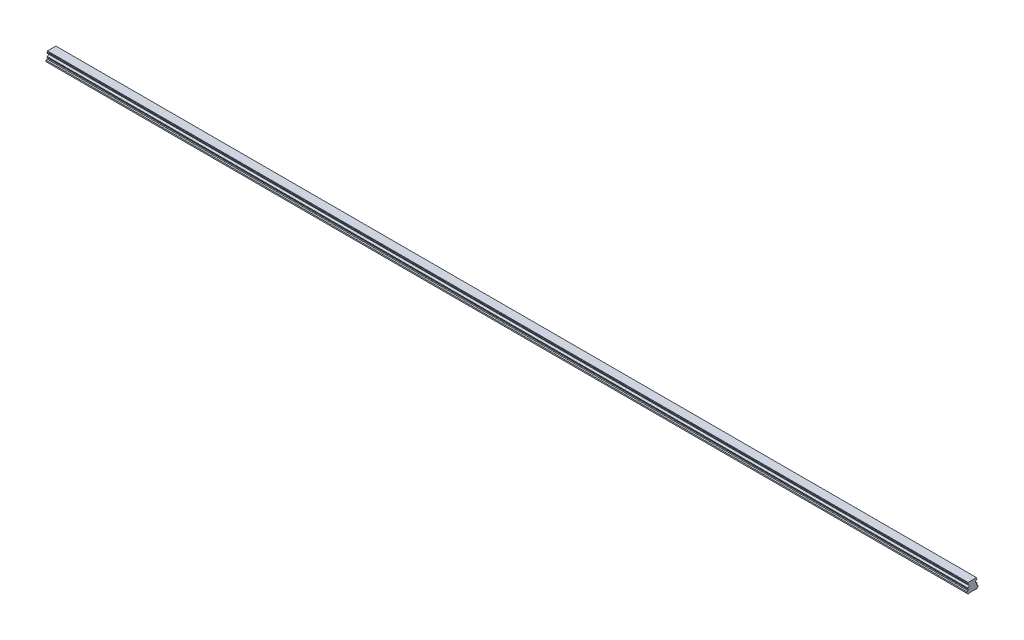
ISO-10303-21;
HEADER;
FILE_DESCRIPTION(('STEP AP214'),'2;1');
FILE_NAME('part.step','',(''),(''),'','','');
FILE_SCHEMA(('AUTOMOTIVE_DESIGN { 1 0 10303 214 1 1 1 1 }'));
ENDSEC;
DATA;
#1=APPLICATION_CONTEXT('core data for automotive mechanical design processes');
#2=APPLICATION_PROTOCOL_DEFINITION('international standard','automotive_design',2000,#1);
#3=PRODUCT_CONTEXT('',#1,'mechanical');
#4=PRODUCT('Part','Part','',(#3));
#5=PRODUCT_RELATED_PRODUCT_CATEGORY('part','',(#4));
#6=PRODUCT_DEFINITION_FORMATION('','',#4);
#7=PRODUCT_DEFINITION_CONTEXT('part definition',#1,'design');
#8=PRODUCT_DEFINITION('design','',#6,#7);
#9=PRODUCT_DEFINITION_SHAPE('','',#8);
#10=(LENGTH_UNIT() NAMED_UNIT(*) SI_UNIT(.MILLI.,.METRE.));
#11=(NAMED_UNIT(*) PLANE_ANGLE_UNIT() SI_UNIT($,.RADIAN.));
#12=(NAMED_UNIT(*) SI_UNIT($,.STERADIAN.) SOLID_ANGLE_UNIT());
#13=UNCERTAINTY_MEASURE_WITH_UNIT(LENGTH_MEASURE(1.E-05),#10,'distance_accuracy_value','');
#14=(GEOMETRIC_REPRESENTATION_CONTEXT(3) GLOBAL_UNCERTAINTY_ASSIGNED_CONTEXT((#13)) GLOBAL_UNIT_ASSIGNED_CONTEXT((#10,
#11,#12)) REPRESENTATION_CONTEXT('',''));
#15=CARTESIAN_POINT('',(0.,0.,0.));
#16=DIRECTION('',(0.,0.,1.));
#17=DIRECTION('',(1.,0.,0.));
#18=AXIS2_PLACEMENT_3D('',#15,#16,#17);
#19=CARTESIAN_POINT('',(2010.,0.499999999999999,0.));
#20=DIRECTION('',(0.,-1.,0.));
#21=DIRECTION('',(0.,0.,-1.));
#22=AXIS2_PLACEMENT_3D('',#19,#20,#21);
#23=CONICAL_SURFACE('',#22,3.5,0.785398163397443);
#24=CARTESIAN_POINT('',(2010.,1.00000000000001,0.));
#25=DIRECTION('',(0.,1.,0.));
#26=DIRECTION('',(0.,0.,1.));
#27=AXIS2_PLACEMENT_3D('',#24,#25,#26);
#28=CIRCLE('',#27,3.);
#29=CARTESIAN_POINT('',(2010.,1.00000000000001,3.));
#30=VERTEX_POINT('',#29);
#31=EDGE_CURVE('E11',#30,#30,#28,.F.);
#32=ORIENTED_EDGE('',*,*,#31,.F.);
#33=EDGE_LOOP('',(#32));
#34=FACE_BOUND('',#33,.T.);
#35=CARTESIAN_POINT('',(2010.,0.499999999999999,0.));
#36=DIRECTION('',(0.,1.,0.));
#37=DIRECTION('',(0.,0.,1.));
#38=AXIS2_PLACEMENT_3D('',#35,#36,#37);
#39=CIRCLE('',#38,3.5);
#40=CARTESIAN_POINT('',(2010.,0.5,3.5));
#41=VERTEX_POINT('',#40);
#42=EDGE_CURVE('E806',#41,#41,#39,.T.);
#43=ORIENTED_EDGE('',*,*,#42,.F.);
#44=EDGE_LOOP('',(#43));
#45=FACE_BOUND('',#44,.T.);
#46=ADVANCED_FACE('F39',(#34,#45),#23,.F.);
#47=CARTESIAN_POINT('',(2010.,12.,0.));
#48=DIRECTION('',(0.,-1.,0.));
#49=DIRECTION('',(0.,0.,-1.));
#50=AXIS2_PLACEMENT_3D('',#47,#48,#49);
#51=CYLINDRICAL_SURFACE('',#50,3.);
#52=ORIENTED_EDGE('',*,*,#31,.T.);
#53=EDGE_LOOP('',(#52));
#54=FACE_BOUND('',#53,.T.);
#55=CARTESIAN_POINT('',(2010.,12.,0.));
#56=DIRECTION('',(0.,-1.,0.));
#57=DIRECTION('',(0.,0.,-1.));
#58=AXIS2_PLACEMENT_3D('',#55,#56,#57);
#59=CIRCLE('',#58,3.);
#60=CARTESIAN_POINT('',(2010.,12.,-3.));
#61=VERTEX_POINT('',#60);
#62=EDGE_CURVE('E49',#61,#61,#59,.T.);
#63=ORIENTED_EDGE('',*,*,#62,.F.);
#64=EDGE_LOOP('',(#63));
#65=FACE_BOUND('',#64,.T.);
#66=ADVANCED_FACE('F1159',(#54,#65),#51,.F.);
#67=CARTESIAN_POINT('',(2010.,12.,0.));
#68=DIRECTION('',(0.,-1.,0.));
#69=DIRECTION('',(0.,0.,-1.));
#70=AXIS2_PLACEMENT_3D('',#67,#68,#69);
#71=PLANE('',#70);
#72=CARTESIAN_POINT('',(2010.,12.,0.));
#73=DIRECTION('',(0.,-1.,0.));
#74=DIRECTION('',(0.,0.,-1.));
#75=AXIS2_PLACEMENT_3D('',#72,#73,#74);
#76=CIRCLE('',#75,2.5);
#77=CARTESIAN_POINT('',(2010.,12.,-2.5));
#78=VERTEX_POINT('',#77);
#79=EDGE_CURVE('E42',#78,#78,#76,.T.);
#80=ORIENTED_EDGE('',*,*,#79,.F.);
#81=EDGE_LOOP('',(#80));
#82=FACE_BOUND('',#81,.T.);
#83=ORIENTED_EDGE('',*,*,#62,.T.);
#84=EDGE_LOOP('',(#83));
#85=FACE_BOUND('',#84,.T.);
#86=ADVANCED_FACE('F1164',(#82,#85),#71,.T.);
#87=CARTESIAN_POINT('',(1950.,0.499999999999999,0.));
#88=DIRECTION('',(0.,-1.,0.));
#89=DIRECTION('',(0.,0.,-1.));
#90=AXIS2_PLACEMENT_3D('',#87,#88,#89);
#91=CONICAL_SURFACE('',#90,3.5,0.785398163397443);
#92=CARTESIAN_POINT('',(1950.,1.00000000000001,0.));
#93=DIRECTION('',(0.,1.,0.));
#94=DIRECTION('',(0.,0.,1.));
#95=AXIS2_PLACEMENT_3D('',#92,#93,#94);
#96=CIRCLE('',#95,3.);
#97=CARTESIAN_POINT('',(1950.,1.00000000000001,3.));
#98=VERTEX_POINT('',#97);
#99=EDGE_CURVE('E802',#98,#98,#96,.F.);
#100=ORIENTED_EDGE('',*,*,#99,.F.);
#101=EDGE_LOOP('',(#100));
#102=FACE_BOUND('',#101,.T.);
#103=CARTESIAN_POINT('',(1950.,0.499999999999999,0.));
#104=DIRECTION('',(0.,1.,0.));
#105=DIRECTION('',(0.,0.,1.));
#106=AXIS2_PLACEMENT_3D('',#103,#104,#105);
#107=CIRCLE('',#106,3.5);
#108=CARTESIAN_POINT('',(1950.,0.5,3.5));
#109=VERTEX_POINT('',#108);
#110=EDGE_CURVE('E794',#109,#109,#107,.T.);
#111=ORIENTED_EDGE('',*,*,#110,.F.);
#112=EDGE_LOOP('',(#111));
#113=FACE_BOUND('',#112,.T.);
#114=ADVANCED_FACE('F1611',(#102,#113),#91,.F.);
#115=CARTESIAN_POINT('',(1950.,12.,0.));
#116=DIRECTION('',(0.,-1.,0.));
#117=DIRECTION('',(0.,0.,-1.));
#118=AXIS2_PLACEMENT_3D('',#115,#116,#117);
#119=CYLINDRICAL_SURFACE('',#118,3.);
#120=ORIENTED_EDGE('',*,*,#99,.T.);
#121=EDGE_LOOP('',(#120));
#122=FACE_BOUND('',#121,.T.);
#123=CARTESIAN_POINT('',(1950.,12.,0.));
#124=DIRECTION('',(0.,-1.,0.));
#125=DIRECTION('',(0.,0.,-1.));
#126=AXIS2_PLACEMENT_3D('',#123,#124,#125);
#127=CIRCLE('',#126,3.);
#128=CARTESIAN_POINT('',(1950.,12.,-3.));
#129=VERTEX_POINT('',#128);
#130=EDGE_CURVE('E798',#129,#129,#127,.T.);
#131=ORIENTED_EDGE('',*,*,#130,.F.);
#132=EDGE_LOOP('',(#131));
#133=FACE_BOUND('',#132,.T.);
#134=ADVANCED_FACE('F1607',(#122,#133),#119,.F.);
#135=CARTESIAN_POINT('',(1950.,12.,0.));
#136=DIRECTION('',(0.,-1.,0.));
#137=DIRECTION('',(0.,0.,-1.));
#138=AXIS2_PLACEMENT_3D('',#135,#136,#137);
#139=PLANE('',#138);
#140=CARTESIAN_POINT('',(1950.,12.,0.));
#141=DIRECTION('',(0.,-1.,0.));
#142=DIRECTION('',(0.,0.,-1.));
#143=AXIS2_PLACEMENT_3D('',#140,#141,#142);
#144=CIRCLE('',#143,2.5);
#145=CARTESIAN_POINT('',(1950.,12.,-2.5));
#146=VERTEX_POINT('',#145);
#147=EDGE_CURVE('E937',#146,#146,#144,.T.);
#148=ORIENTED_EDGE('',*,*,#147,.F.);
#149=EDGE_LOOP('',(#148));
#150=FACE_BOUND('',#149,.T.);
#151=ORIENTED_EDGE('',*,*,#130,.T.);
#152=EDGE_LOOP('',(#151));
#153=FACE_BOUND('',#152,.T.);
#154=ADVANCED_FACE('F1603',(#150,#153),#139,.T.);
#155=CARTESIAN_POINT('',(1890.,0.499999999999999,0.));
#156=DIRECTION('',(0.,-1.,0.));
#157=DIRECTION('',(0.,0.,-1.));
#158=AXIS2_PLACEMENT_3D('',#155,#156,#157);
#159=CONICAL_SURFACE('',#158,3.5,0.785398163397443);
#160=CARTESIAN_POINT('',(1890.,1.00000000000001,0.));
#161=DIRECTION('',(0.,1.,0.));
#162=DIRECTION('',(0.,0.,1.));
#163=AXIS2_PLACEMENT_3D('',#160,#161,#162);
#164=CIRCLE('',#163,3.);
#165=CARTESIAN_POINT('',(1890.,1.00000000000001,3.));
#166=VERTEX_POINT('',#165);
#167=EDGE_CURVE('E790',#166,#166,#164,.F.);
#168=ORIENTED_EDGE('',*,*,#167,.F.);
#169=EDGE_LOOP('',(#168));
#170=FACE_BOUND('',#169,.T.);
#171=CARTESIAN_POINT('',(1890.,0.499999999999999,0.));
#172=DIRECTION('',(0.,1.,0.));
#173=DIRECTION('',(0.,0.,1.));
#174=AXIS2_PLACEMENT_3D('',#171,#172,#173);
#175=CIRCLE('',#174,3.5);
#176=CARTESIAN_POINT('',(1890.,0.5,3.5));
#177=VERTEX_POINT('',#176);
#178=EDGE_CURVE('E782',#177,#177,#175,.T.);
#179=ORIENTED_EDGE('',*,*,#178,.F.);
#180=EDGE_LOOP('',(#179));
#181=FACE_BOUND('',#180,.T.);
#182=ADVANCED_FACE('F1599',(#170,#181),#159,.F.);
#183=CARTESIAN_POINT('',(1890.,12.,0.));
#184=DIRECTION('',(0.,-1.,0.));
#185=DIRECTION('',(0.,0.,-1.));
#186=AXIS2_PLACEMENT_3D('',#183,#184,#185);
#187=CYLINDRICAL_SURFACE('',#186,3.);
#188=ORIENTED_EDGE('',*,*,#167,.T.);
#189=EDGE_LOOP('',(#188));
#190=FACE_BOUND('',#189,.T.);
#191=CARTESIAN_POINT('',(1890.,12.,0.));
#192=DIRECTION('',(0.,-1.,0.));
#193=DIRECTION('',(0.,0.,-1.));
#194=AXIS2_PLACEMENT_3D('',#191,#192,#193);
#195=CIRCLE('',#194,3.);
#196=CARTESIAN_POINT('',(1890.,12.,-3.));
#197=VERTEX_POINT('',#196);
#198=EDGE_CURVE('E786',#197,#197,#195,.T.);
#199=ORIENTED_EDGE('',*,*,#198,.F.);
#200=EDGE_LOOP('',(#199));
#201=FACE_BOUND('',#200,.T.);
#202=ADVANCED_FACE('F1595',(#190,#201),#187,.F.);
#203=CARTESIAN_POINT('',(1890.,12.,0.));
#204=DIRECTION('',(0.,-1.,0.));
#205=DIRECTION('',(0.,0.,-1.));
#206=AXIS2_PLACEMENT_3D('',#203,#204,#205);
#207=PLANE('',#206);
#208=CARTESIAN_POINT('',(1890.,12.,0.));
#209=DIRECTION('',(0.,-1.,0.));
#210=DIRECTION('',(0.,0.,-1.));
#211=AXIS2_PLACEMENT_3D('',#208,#209,#210);
#212=CIRCLE('',#211,2.5);
#213=CARTESIAN_POINT('',(1890.,12.,-2.5));
#214=VERTEX_POINT('',#213);
#215=EDGE_CURVE('E934',#214,#214,#212,.T.);
#216=ORIENTED_EDGE('',*,*,#215,.F.);
#217=EDGE_LOOP('',(#216));
#218=FACE_BOUND('',#217,.T.);
#219=ORIENTED_EDGE('',*,*,#198,.T.);
#220=EDGE_LOOP('',(#219));
#221=FACE_BOUND('',#220,.T.);
#222=ADVANCED_FACE('F1591',(#218,#221),#207,.T.);
#223=CARTESIAN_POINT('',(1830.,0.499999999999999,0.));
#224=DIRECTION('',(0.,-1.,0.));
#225=DIRECTION('',(0.,0.,-1.));
#226=AXIS2_PLACEMENT_3D('',#223,#224,#225);
#227=CONICAL_SURFACE('',#226,3.5,0.785398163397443);
#228=CARTESIAN_POINT('',(1830.,1.00000000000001,0.));
#229=DIRECTION('',(0.,1.,0.));
#230=DIRECTION('',(0.,0.,1.));
#231=AXIS2_PLACEMENT_3D('',#228,#229,#230);
#232=CIRCLE('',#231,3.);
#233=CARTESIAN_POINT('',(1830.,1.00000000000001,3.));
#234=VERTEX_POINT('',#233);
#235=EDGE_CURVE('E778',#234,#234,#232,.F.);
#236=ORIENTED_EDGE('',*,*,#235,.F.);
#237=EDGE_LOOP('',(#236));
#238=FACE_BOUND('',#237,.T.);
#239=CARTESIAN_POINT('',(1830.,0.499999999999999,0.));
#240=DIRECTION('',(0.,1.,0.));
#241=DIRECTION('',(0.,0.,1.));
#242=AXIS2_PLACEMENT_3D('',#239,#240,#241);
#243=CIRCLE('',#242,3.5);
#244=CARTESIAN_POINT('',(1830.,0.5,3.5));
#245=VERTEX_POINT('',#244);
#246=EDGE_CURVE('E770',#245,#245,#243,.T.);
#247=ORIENTED_EDGE('',*,*,#246,.F.);
#248=EDGE_LOOP('',(#247));
#249=FACE_BOUND('',#248,.T.);
#250=ADVANCED_FACE('F1587',(#238,#249),#227,.F.);
#251=CARTESIAN_POINT('',(1830.,12.,0.));
#252=DIRECTION('',(0.,-1.,0.));
#253=DIRECTION('',(0.,0.,-1.));
#254=AXIS2_PLACEMENT_3D('',#251,#252,#253);
#255=CYLINDRICAL_SURFACE('',#254,3.);
#256=ORIENTED_EDGE('',*,*,#235,.T.);
#257=EDGE_LOOP('',(#256));
#258=FACE_BOUND('',#257,.T.);
#259=CARTESIAN_POINT('',(1830.,12.,0.));
#260=DIRECTION('',(0.,-1.,0.));
#261=DIRECTION('',(0.,0.,-1.));
#262=AXIS2_PLACEMENT_3D('',#259,#260,#261);
#263=CIRCLE('',#262,3.);
#264=CARTESIAN_POINT('',(1830.,12.,-3.));
#265=VERTEX_POINT('',#264);
#266=EDGE_CURVE('E774',#265,#265,#263,.T.);
#267=ORIENTED_EDGE('',*,*,#266,.F.);
#268=EDGE_LOOP('',(#267));
#269=FACE_BOUND('',#268,.T.);
#270=ADVANCED_FACE('F1583',(#258,#269),#255,.F.);
#271=CARTESIAN_POINT('',(1830.,12.,0.));
#272=DIRECTION('',(0.,-1.,0.));
#273=DIRECTION('',(0.,0.,-1.));
#274=AXIS2_PLACEMENT_3D('',#271,#272,#273);
#275=PLANE('',#274);
#276=CARTESIAN_POINT('',(1830.,12.,0.));
#277=DIRECTION('',(0.,-1.,0.));
#278=DIRECTION('',(0.,0.,-1.));
#279=AXIS2_PLACEMENT_3D('',#276,#277,#278);
#280=CIRCLE('',#279,2.5);
#281=CARTESIAN_POINT('',(1830.,12.,-2.5));
#282=VERTEX_POINT('',#281);
#283=EDGE_CURVE('E930',#282,#282,#280,.T.);
#284=ORIENTED_EDGE('',*,*,#283,.F.);
#285=EDGE_LOOP('',(#284));
#286=FACE_BOUND('',#285,.T.);
#287=ORIENTED_EDGE('',*,*,#266,.T.);
#288=EDGE_LOOP('',(#287));
#289=FACE_BOUND('',#288,.T.);
#290=ADVANCED_FACE('F1579',(#286,#289),#275,.T.);
#291=CARTESIAN_POINT('',(1770.,0.499999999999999,0.));
#292=DIRECTION('',(0.,-1.,0.));
#293=DIRECTION('',(0.,0.,-1.));
#294=AXIS2_PLACEMENT_3D('',#291,#292,#293);
#295=CONICAL_SURFACE('',#294,3.5,0.785398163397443);
#296=CARTESIAN_POINT('',(1770.,1.00000000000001,0.));
#297=DIRECTION('',(0.,1.,0.));
#298=DIRECTION('',(0.,0.,1.));
#299=AXIS2_PLACEMENT_3D('',#296,#297,#298);
#300=CIRCLE('',#299,3.);
#301=CARTESIAN_POINT('',(1770.,1.00000000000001,3.));
#302=VERTEX_POINT('',#301);
#303=EDGE_CURVE('E766',#302,#302,#300,.F.);
#304=ORIENTED_EDGE('',*,*,#303,.F.);
#305=EDGE_LOOP('',(#304));
#306=FACE_BOUND('',#305,.T.);
#307=CARTESIAN_POINT('',(1770.,0.499999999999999,0.));
#308=DIRECTION('',(0.,1.,0.));
#309=DIRECTION('',(0.,0.,1.));
#310=AXIS2_PLACEMENT_3D('',#307,#308,#309);
#311=CIRCLE('',#310,3.5);
#312=CARTESIAN_POINT('',(1770.,0.5,3.5));
#313=VERTEX_POINT('',#312);
#314=EDGE_CURVE('E758',#313,#313,#311,.T.);
#315=ORIENTED_EDGE('',*,*,#314,.F.);
#316=EDGE_LOOP('',(#315));
#317=FACE_BOUND('',#316,.T.);
#318=ADVANCED_FACE('F1575',(#306,#317),#295,.F.);
#319=CARTESIAN_POINT('',(1770.,12.,0.));
#320=DIRECTION('',(0.,-1.,0.));
#321=DIRECTION('',(0.,0.,-1.));
#322=AXIS2_PLACEMENT_3D('',#319,#320,#321);
#323=CYLINDRICAL_SURFACE('',#322,3.);
#324=ORIENTED_EDGE('',*,*,#303,.T.);
#325=EDGE_LOOP('',(#324));
#326=FACE_BOUND('',#325,.T.);
#327=CARTESIAN_POINT('',(1770.,12.,0.));
#328=DIRECTION('',(0.,-1.,0.));
#329=DIRECTION('',(0.,0.,-1.));
#330=AXIS2_PLACEMENT_3D('',#327,#328,#329);
#331=CIRCLE('',#330,3.);
#332=CARTESIAN_POINT('',(1770.,12.,-3.));
#333=VERTEX_POINT('',#332);
#334=EDGE_CURVE('E762',#333,#333,#331,.T.);
#335=ORIENTED_EDGE('',*,*,#334,.F.);
#336=EDGE_LOOP('',(#335));
#337=FACE_BOUND('',#336,.T.);
#338=ADVANCED_FACE('F1571',(#326,#337),#323,.F.);
#339=CARTESIAN_POINT('',(1770.,12.,0.));
#340=DIRECTION('',(0.,-1.,0.));
#341=DIRECTION('',(0.,0.,-1.));
#342=AXIS2_PLACEMENT_3D('',#339,#340,#341);
#343=PLANE('',#342);
#344=CARTESIAN_POINT('',(1770.,12.,0.));
#345=DIRECTION('',(0.,-1.,0.));
#346=DIRECTION('',(0.,0.,-1.));
#347=AXIS2_PLACEMENT_3D('',#344,#345,#346);
#348=CIRCLE('',#347,2.5);
#349=CARTESIAN_POINT('',(1770.,12.,-2.5));
#350=VERTEX_POINT('',#349);
#351=EDGE_CURVE('E926',#350,#350,#348,.T.);
#352=ORIENTED_EDGE('',*,*,#351,.F.);
#353=EDGE_LOOP('',(#352));
#354=FACE_BOUND('',#353,.T.);
#355=ORIENTED_EDGE('',*,*,#334,.T.);
#356=EDGE_LOOP('',(#355));
#357=FACE_BOUND('',#356,.T.);
#358=ADVANCED_FACE('F1567',(#354,#357),#343,.T.);
#359=CARTESIAN_POINT('',(1710.,0.499999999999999,0.));
#360=DIRECTION('',(0.,-1.,0.));
#361=DIRECTION('',(0.,0.,-1.));
#362=AXIS2_PLACEMENT_3D('',#359,#360,#361);
#363=CONICAL_SURFACE('',#362,3.5,0.785398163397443);
#364=CARTESIAN_POINT('',(1710.,1.00000000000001,0.));
#365=DIRECTION('',(0.,1.,0.));
#366=DIRECTION('',(0.,0.,1.));
#367=AXIS2_PLACEMENT_3D('',#364,#365,#366);
#368=CIRCLE('',#367,3.);
#369=CARTESIAN_POINT('',(1710.,1.00000000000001,3.));
#370=VERTEX_POINT('',#369);
#371=EDGE_CURVE('E754',#370,#370,#368,.F.);
#372=ORIENTED_EDGE('',*,*,#371,.F.);
#373=EDGE_LOOP('',(#372));
#374=FACE_BOUND('',#373,.T.);
#375=CARTESIAN_POINT('',(1710.,0.499999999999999,0.));
#376=DIRECTION('',(0.,1.,0.));
#377=DIRECTION('',(0.,0.,1.));
#378=AXIS2_PLACEMENT_3D('',#375,#376,#377);
#379=CIRCLE('',#378,3.5);
#380=CARTESIAN_POINT('',(1710.,0.5,3.5));
#381=VERTEX_POINT('',#380);
#382=EDGE_CURVE('E746',#381,#381,#379,.T.);
#383=ORIENTED_EDGE('',*,*,#382,.F.);
#384=EDGE_LOOP('',(#383));
#385=FACE_BOUND('',#384,.T.);
#386=ADVANCED_FACE('F1563',(#374,#385),#363,.F.);
#387=CARTESIAN_POINT('',(1710.,12.,0.));
#388=DIRECTION('',(0.,-1.,0.));
#389=DIRECTION('',(0.,0.,-1.));
#390=AXIS2_PLACEMENT_3D('',#387,#388,#389);
#391=CYLINDRICAL_SURFACE('',#390,3.);
#392=ORIENTED_EDGE('',*,*,#371,.T.);
#393=EDGE_LOOP('',(#392));
#394=FACE_BOUND('',#393,.T.);
#395=CARTESIAN_POINT('',(1710.,12.,0.));
#396=DIRECTION('',(0.,-1.,0.));
#397=DIRECTION('',(0.,0.,-1.));
#398=AXIS2_PLACEMENT_3D('',#395,#396,#397);
#399=CIRCLE('',#398,3.);
#400=CARTESIAN_POINT('',(1710.,12.,-3.));
#401=VERTEX_POINT('',#400);
#402=EDGE_CURVE('E750',#401,#401,#399,.T.);
#403=ORIENTED_EDGE('',*,*,#402,.F.);
#404=EDGE_LOOP('',(#403));
#405=FACE_BOUND('',#404,.T.);
#406=ADVANCED_FACE('F1559',(#394,#405),#391,.F.);
#407=CARTESIAN_POINT('',(1710.,12.,0.));
#408=DIRECTION('',(0.,-1.,0.));
#409=DIRECTION('',(0.,0.,-1.));
#410=AXIS2_PLACEMENT_3D('',#407,#408,#409);
#411=PLANE('',#410);
#412=CARTESIAN_POINT('',(1710.,12.,0.));
#413=DIRECTION('',(0.,-1.,0.));
#414=DIRECTION('',(0.,0.,-1.));
#415=AXIS2_PLACEMENT_3D('',#412,#413,#414);
#416=CIRCLE('',#415,2.5);
#417=CARTESIAN_POINT('',(1710.,12.,-2.5));
#418=VERTEX_POINT('',#417);
#419=EDGE_CURVE('E922',#418,#418,#416,.T.);
#420=ORIENTED_EDGE('',*,*,#419,.F.);
#421=EDGE_LOOP('',(#420));
#422=FACE_BOUND('',#421,.T.);
#423=ORIENTED_EDGE('',*,*,#402,.T.);
#424=EDGE_LOOP('',(#423));
#425=FACE_BOUND('',#424,.T.);
#426=ADVANCED_FACE('F1555',(#422,#425),#411,.T.);
#427=CARTESIAN_POINT('',(1650.,0.499999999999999,0.));
#428=DIRECTION('',(0.,-1.,0.));
#429=DIRECTION('',(0.,0.,-1.));
#430=AXIS2_PLACEMENT_3D('',#427,#428,#429);
#431=CONICAL_SURFACE('',#430,3.5,0.785398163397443);
#432=CARTESIAN_POINT('',(1650.,1.00000000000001,0.));
#433=DIRECTION('',(0.,1.,0.));
#434=DIRECTION('',(0.,0.,1.));
#435=AXIS2_PLACEMENT_3D('',#432,#433,#434);
#436=CIRCLE('',#435,3.);
#437=CARTESIAN_POINT('',(1650.,1.00000000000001,3.));
#438=VERTEX_POINT('',#437);
#439=EDGE_CURVE('E742',#438,#438,#436,.F.);
#440=ORIENTED_EDGE('',*,*,#439,.F.);
#441=EDGE_LOOP('',(#440));
#442=FACE_BOUND('',#441,.T.);
#443=CARTESIAN_POINT('',(1650.,0.499999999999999,0.));
#444=DIRECTION('',(0.,1.,0.));
#445=DIRECTION('',(0.,0.,1.));
#446=AXIS2_PLACEMENT_3D('',#443,#444,#445);
#447=CIRCLE('',#446,3.5);
#448=CARTESIAN_POINT('',(1650.,0.5,3.5));
#449=VERTEX_POINT('',#448);
#450=EDGE_CURVE('E734',#449,#449,#447,.T.);
#451=ORIENTED_EDGE('',*,*,#450,.F.);
#452=EDGE_LOOP('',(#451));
#453=FACE_BOUND('',#452,.T.);
#454=ADVANCED_FACE('F1551',(#442,#453),#431,.F.);
#455=CARTESIAN_POINT('',(1650.,12.,0.));
#456=DIRECTION('',(0.,-1.,0.));
#457=DIRECTION('',(0.,0.,-1.));
#458=AXIS2_PLACEMENT_3D('',#455,#456,#457);
#459=CYLINDRICAL_SURFACE('',#458,3.);
#460=ORIENTED_EDGE('',*,*,#439,.T.);
#461=EDGE_LOOP('',(#460));
#462=FACE_BOUND('',#461,.T.);
#463=CARTESIAN_POINT('',(1650.,12.,0.));
#464=DIRECTION('',(0.,-1.,0.));
#465=DIRECTION('',(0.,0.,-1.));
#466=AXIS2_PLACEMENT_3D('',#463,#464,#465);
#467=CIRCLE('',#466,3.);
#468=CARTESIAN_POINT('',(1650.,12.,-3.));
#469=VERTEX_POINT('',#468);
#470=EDGE_CURVE('E738',#469,#469,#467,.T.);
#471=ORIENTED_EDGE('',*,*,#470,.F.);
#472=EDGE_LOOP('',(#471));
#473=FACE_BOUND('',#472,.T.);
#474=ADVANCED_FACE('F1547',(#462,#473),#459,.F.);
#475=CARTESIAN_POINT('',(1650.,12.,0.));
#476=DIRECTION('',(0.,-1.,0.));
#477=DIRECTION('',(0.,0.,-1.));
#478=AXIS2_PLACEMENT_3D('',#475,#476,#477);
#479=PLANE('',#478);
#480=CARTESIAN_POINT('',(1650.,12.,0.));
#481=DIRECTION('',(0.,-1.,0.));
#482=DIRECTION('',(0.,0.,-1.));
#483=AXIS2_PLACEMENT_3D('',#480,#481,#482);
#484=CIRCLE('',#483,2.5);
#485=CARTESIAN_POINT('',(1650.,12.,-2.5));
#486=VERTEX_POINT('',#485);
#487=EDGE_CURVE('E918',#486,#486,#484,.T.);
#488=ORIENTED_EDGE('',*,*,#487,.F.);
#489=EDGE_LOOP('',(#488));
#490=FACE_BOUND('',#489,.T.);
#491=ORIENTED_EDGE('',*,*,#470,.T.);
#492=EDGE_LOOP('',(#491));
#493=FACE_BOUND('',#492,.T.);
#494=ADVANCED_FACE('F1543',(#490,#493),#479,.T.);
#495=CARTESIAN_POINT('',(1590.,0.499999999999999,0.));
#496=DIRECTION('',(0.,-1.,0.));
#497=DIRECTION('',(0.,0.,-1.));
#498=AXIS2_PLACEMENT_3D('',#495,#496,#497);
#499=CONICAL_SURFACE('',#498,3.5,0.785398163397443);
#500=CARTESIAN_POINT('',(1590.,1.00000000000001,0.));
#501=DIRECTION('',(0.,1.,0.));
#502=DIRECTION('',(0.,0.,1.));
#503=AXIS2_PLACEMENT_3D('',#500,#501,#502);
#504=CIRCLE('',#503,3.);
#505=CARTESIAN_POINT('',(1590.,1.00000000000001,3.));
#506=VERTEX_POINT('',#505);
#507=EDGE_CURVE('E730',#506,#506,#504,.F.);
#508=ORIENTED_EDGE('',*,*,#507,.F.);
#509=EDGE_LOOP('',(#508));
#510=FACE_BOUND('',#509,.T.);
#511=CARTESIAN_POINT('',(1590.,0.499999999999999,0.));
#512=DIRECTION('',(0.,1.,0.));
#513=DIRECTION('',(0.,0.,1.));
#514=AXIS2_PLACEMENT_3D('',#511,#512,#513);
#515=CIRCLE('',#514,3.5);
#516=CARTESIAN_POINT('',(1590.,0.5,3.5));
#517=VERTEX_POINT('',#516);
#518=EDGE_CURVE('E722',#517,#517,#515,.T.);
#519=ORIENTED_EDGE('',*,*,#518,.F.);
#520=EDGE_LOOP('',(#519));
#521=FACE_BOUND('',#520,.T.);
#522=ADVANCED_FACE('F1539',(#510,#521),#499,.F.);
#523=CARTESIAN_POINT('',(1590.,12.,0.));
#524=DIRECTION('',(0.,-1.,0.));
#525=DIRECTION('',(0.,0.,-1.));
#526=AXIS2_PLACEMENT_3D('',#523,#524,#525);
#527=CYLINDRICAL_SURFACE('',#526,3.);
#528=ORIENTED_EDGE('',*,*,#507,.T.);
#529=EDGE_LOOP('',(#528));
#530=FACE_BOUND('',#529,.T.);
#531=CARTESIAN_POINT('',(1590.,12.,0.));
#532=DIRECTION('',(0.,-1.,0.));
#533=DIRECTION('',(0.,0.,-1.));
#534=AXIS2_PLACEMENT_3D('',#531,#532,#533);
#535=CIRCLE('',#534,3.);
#536=CARTESIAN_POINT('',(1590.,12.,-3.));
#537=VERTEX_POINT('',#536);
#538=EDGE_CURVE('E726',#537,#537,#535,.T.);
#539=ORIENTED_EDGE('',*,*,#538,.F.);
#540=EDGE_LOOP('',(#539));
#541=FACE_BOUND('',#540,.T.);
#542=ADVANCED_FACE('F1535',(#530,#541),#527,.F.);
#543=CARTESIAN_POINT('',(1590.,12.,0.));
#544=DIRECTION('',(0.,-1.,0.));
#545=DIRECTION('',(0.,0.,-1.));
#546=AXIS2_PLACEMENT_3D('',#543,#544,#545);
#547=PLANE('',#546);
#548=CARTESIAN_POINT('',(1590.,12.,0.));
#549=DIRECTION('',(0.,-1.,0.));
#550=DIRECTION('',(0.,0.,-1.));
#551=AXIS2_PLACEMENT_3D('',#548,#549,#550);
#552=CIRCLE('',#551,2.5);
#553=CARTESIAN_POINT('',(1590.,12.,-2.5));
#554=VERTEX_POINT('',#553);
#555=EDGE_CURVE('E914',#554,#554,#552,.T.);
#556=ORIENTED_EDGE('',*,*,#555,.F.);
#557=EDGE_LOOP('',(#556));
#558=FACE_BOUND('',#557,.T.);
#559=ORIENTED_EDGE('',*,*,#538,.T.);
#560=EDGE_LOOP('',(#559));
#561=FACE_BOUND('',#560,.T.);
#562=ADVANCED_FACE('F1531',(#558,#561),#547,.T.);
#563=CARTESIAN_POINT('',(1530.,0.499999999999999,0.));
#564=DIRECTION('',(0.,-1.,0.));
#565=DIRECTION('',(0.,0.,-1.));
#566=AXIS2_PLACEMENT_3D('',#563,#564,#565);
#567=CONICAL_SURFACE('',#566,3.5,0.785398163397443);
#568=CARTESIAN_POINT('',(1530.,1.00000000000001,0.));
#569=DIRECTION('',(0.,1.,0.));
#570=DIRECTION('',(0.,0.,1.));
#571=AXIS2_PLACEMENT_3D('',#568,#569,#570);
#572=CIRCLE('',#571,3.);
#573=CARTESIAN_POINT('',(1530.,1.00000000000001,3.));
#574=VERTEX_POINT('',#573);
#575=EDGE_CURVE('E718',#574,#574,#572,.F.);
#576=ORIENTED_EDGE('',*,*,#575,.F.);
#577=EDGE_LOOP('',(#576));
#578=FACE_BOUND('',#577,.T.);
#579=CARTESIAN_POINT('',(1530.,0.499999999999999,0.));
#580=DIRECTION('',(0.,1.,0.));
#581=DIRECTION('',(0.,0.,1.));
#582=AXIS2_PLACEMENT_3D('',#579,#580,#581);
#583=CIRCLE('',#582,3.5);
#584=CARTESIAN_POINT('',(1530.,0.5,3.5));
#585=VERTEX_POINT('',#584);
#586=EDGE_CURVE('E710',#585,#585,#583,.T.);
#587=ORIENTED_EDGE('',*,*,#586,.F.);
#588=EDGE_LOOP('',(#587));
#589=FACE_BOUND('',#588,.T.);
#590=ADVANCED_FACE('F1527',(#578,#589),#567,.F.);
#591=CARTESIAN_POINT('',(1530.,12.,0.));
#592=DIRECTION('',(0.,-1.,0.));
#593=DIRECTION('',(0.,0.,-1.));
#594=AXIS2_PLACEMENT_3D('',#591,#592,#593);
#595=CYLINDRICAL_SURFACE('',#594,3.);
#596=ORIENTED_EDGE('',*,*,#575,.T.);
#597=EDGE_LOOP('',(#596));
#598=FACE_BOUND('',#597,.T.);
#599=CARTESIAN_POINT('',(1530.,12.,0.));
#600=DIRECTION('',(0.,-1.,0.));
#601=DIRECTION('',(0.,0.,-1.));
#602=AXIS2_PLACEMENT_3D('',#599,#600,#601);
#603=CIRCLE('',#602,3.);
#604=CARTESIAN_POINT('',(1530.,12.,-3.));
#605=VERTEX_POINT('',#604);
#606=EDGE_CURVE('E714',#605,#605,#603,.T.);
#607=ORIENTED_EDGE('',*,*,#606,.F.);
#608=EDGE_LOOP('',(#607));
#609=FACE_BOUND('',#608,.T.);
#610=ADVANCED_FACE('F1523',(#598,#609),#595,.F.);
#611=CARTESIAN_POINT('',(1530.,12.,0.));
#612=DIRECTION('',(0.,-1.,0.));
#613=DIRECTION('',(0.,0.,-1.));
#614=AXIS2_PLACEMENT_3D('',#611,#612,#613);
#615=PLANE('',#614);
#616=CARTESIAN_POINT('',(1530.,12.,0.));
#617=DIRECTION('',(0.,-1.,0.));
#618=DIRECTION('',(0.,0.,-1.));
#619=AXIS2_PLACEMENT_3D('',#616,#617,#618);
#620=CIRCLE('',#619,2.5);
#621=CARTESIAN_POINT('',(1530.,12.,-2.5));
#622=VERTEX_POINT('',#621);
#623=EDGE_CURVE('E910',#622,#622,#620,.T.);
#624=ORIENTED_EDGE('',*,*,#623,.F.);
#625=EDGE_LOOP('',(#624));
#626=FACE_BOUND('',#625,.T.);
#627=ORIENTED_EDGE('',*,*,#606,.T.);
#628=EDGE_LOOP('',(#627));
#629=FACE_BOUND('',#628,.T.);
#630=ADVANCED_FACE('F1519',(#626,#629),#615,.T.);
#631=CARTESIAN_POINT('',(1470.,0.499999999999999,0.));
#632=DIRECTION('',(0.,-1.,0.));
#633=DIRECTION('',(0.,0.,-1.));
#634=AXIS2_PLACEMENT_3D('',#631,#632,#633);
#635=CONICAL_SURFACE('',#634,3.5,0.785398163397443);
#636=CARTESIAN_POINT('',(1470.,1.00000000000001,0.));
#637=DIRECTION('',(0.,1.,0.));
#638=DIRECTION('',(0.,0.,1.));
#639=AXIS2_PLACEMENT_3D('',#636,#637,#638);
#640=CIRCLE('',#639,3.);
#641=CARTESIAN_POINT('',(1470.,1.00000000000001,3.));
#642=VERTEX_POINT('',#641);
#643=EDGE_CURVE('E706',#642,#642,#640,.F.);
#644=ORIENTED_EDGE('',*,*,#643,.F.);
#645=EDGE_LOOP('',(#644));
#646=FACE_BOUND('',#645,.T.);
#647=CARTESIAN_POINT('',(1470.,0.499999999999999,0.));
#648=DIRECTION('',(0.,1.,0.));
#649=DIRECTION('',(0.,0.,1.));
#650=AXIS2_PLACEMENT_3D('',#647,#648,#649);
#651=CIRCLE('',#650,3.5);
#652=CARTESIAN_POINT('',(1470.,0.5,3.5));
#653=VERTEX_POINT('',#652);
#654=EDGE_CURVE('E698',#653,#653,#651,.T.);
#655=ORIENTED_EDGE('',*,*,#654,.F.);
#656=EDGE_LOOP('',(#655));
#657=FACE_BOUND('',#656,.T.);
#658=ADVANCED_FACE('F1515',(#646,#657),#635,.F.);
#659=CARTESIAN_POINT('',(1470.,12.,0.));
#660=DIRECTION('',(0.,-1.,0.));
#661=DIRECTION('',(0.,0.,-1.));
#662=AXIS2_PLACEMENT_3D('',#659,#660,#661);
#663=CYLINDRICAL_SURFACE('',#662,3.);
#664=ORIENTED_EDGE('',*,*,#643,.T.);
#665=EDGE_LOOP('',(#664));
#666=FACE_BOUND('',#665,.T.);
#667=CARTESIAN_POINT('',(1470.,12.,0.));
#668=DIRECTION('',(0.,-1.,0.));
#669=DIRECTION('',(0.,0.,-1.));
#670=AXIS2_PLACEMENT_3D('',#667,#668,#669);
#671=CIRCLE('',#670,3.);
#672=CARTESIAN_POINT('',(1470.,12.,-3.));
#673=VERTEX_POINT('',#672);
#674=EDGE_CURVE('E702',#673,#673,#671,.T.);
#675=ORIENTED_EDGE('',*,*,#674,.F.);
#676=EDGE_LOOP('',(#675));
#677=FACE_BOUND('',#676,.T.);
#678=ADVANCED_FACE('F1511',(#666,#677),#663,.F.);
#679=CARTESIAN_POINT('',(1470.,12.,0.));
#680=DIRECTION('',(0.,-1.,0.));
#681=DIRECTION('',(0.,0.,-1.));
#682=AXIS2_PLACEMENT_3D('',#679,#680,#681);
#683=PLANE('',#682);
#684=CARTESIAN_POINT('',(1470.,12.,0.));
#685=DIRECTION('',(0.,-1.,0.));
#686=DIRECTION('',(0.,0.,-1.));
#687=AXIS2_PLACEMENT_3D('',#684,#685,#686);
#688=CIRCLE('',#687,2.5);
#689=CARTESIAN_POINT('',(1470.,12.,-2.5));
#690=VERTEX_POINT('',#689);
#691=EDGE_CURVE('E906',#690,#690,#688,.T.);
#692=ORIENTED_EDGE('',*,*,#691,.F.);
#693=EDGE_LOOP('',(#692));
#694=FACE_BOUND('',#693,.T.);
#695=ORIENTED_EDGE('',*,*,#674,.T.);
#696=EDGE_LOOP('',(#695));
#697=FACE_BOUND('',#696,.T.);
#698=ADVANCED_FACE('F1507',(#694,#697),#683,.T.);
#699=CARTESIAN_POINT('',(1410.,0.499999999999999,0.));
#700=DIRECTION('',(0.,-1.,0.));
#701=DIRECTION('',(0.,0.,-1.));
#702=AXIS2_PLACEMENT_3D('',#699,#700,#701);
#703=CONICAL_SURFACE('',#702,3.5,0.785398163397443);
#704=CARTESIAN_POINT('',(1410.,1.00000000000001,0.));
#705=DIRECTION('',(0.,1.,0.));
#706=DIRECTION('',(0.,0.,1.));
#707=AXIS2_PLACEMENT_3D('',#704,#705,#706);
#708=CIRCLE('',#707,3.);
#709=CARTESIAN_POINT('',(1410.,1.00000000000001,3.));
#710=VERTEX_POINT('',#709);
#711=EDGE_CURVE('E694',#710,#710,#708,.F.);
#712=ORIENTED_EDGE('',*,*,#711,.F.);
#713=EDGE_LOOP('',(#712));
#714=FACE_BOUND('',#713,.T.);
#715=CARTESIAN_POINT('',(1410.,0.499999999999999,0.));
#716=DIRECTION('',(0.,1.,0.));
#717=DIRECTION('',(0.,0.,1.));
#718=AXIS2_PLACEMENT_3D('',#715,#716,#717);
#719=CIRCLE('',#718,3.5);
#720=CARTESIAN_POINT('',(1410.,0.5,3.5));
#721=VERTEX_POINT('',#720);
#722=EDGE_CURVE('E686',#721,#721,#719,.T.);
#723=ORIENTED_EDGE('',*,*,#722,.F.);
#724=EDGE_LOOP('',(#723));
#725=FACE_BOUND('',#724,.T.);
#726=ADVANCED_FACE('F1503',(#714,#725),#703,.F.);
#727=CARTESIAN_POINT('',(1410.,12.,0.));
#728=DIRECTION('',(0.,-1.,0.));
#729=DIRECTION('',(0.,0.,-1.));
#730=AXIS2_PLACEMENT_3D('',#727,#728,#729);
#731=CYLINDRICAL_SURFACE('',#730,3.);
#732=ORIENTED_EDGE('',*,*,#711,.T.);
#733=EDGE_LOOP('',(#732));
#734=FACE_BOUND('',#733,.T.);
#735=CARTESIAN_POINT('',(1410.,12.,0.));
#736=DIRECTION('',(0.,-1.,0.));
#737=DIRECTION('',(0.,0.,-1.));
#738=AXIS2_PLACEMENT_3D('',#735,#736,#737);
#739=CIRCLE('',#738,3.);
#740=CARTESIAN_POINT('',(1410.,12.,-3.));
#741=VERTEX_POINT('',#740);
#742=EDGE_CURVE('E690',#741,#741,#739,.T.);
#743=ORIENTED_EDGE('',*,*,#742,.F.);
#744=EDGE_LOOP('',(#743));
#745=FACE_BOUND('',#744,.T.);
#746=ADVANCED_FACE('F1499',(#734,#745),#731,.F.);
#747=CARTESIAN_POINT('',(1410.,12.,0.));
#748=DIRECTION('',(0.,-1.,0.));
#749=DIRECTION('',(0.,0.,-1.));
#750=AXIS2_PLACEMENT_3D('',#747,#748,#749);
#751=PLANE('',#750);
#752=CARTESIAN_POINT('',(1410.,12.,0.));
#753=DIRECTION('',(0.,-1.,0.));
#754=DIRECTION('',(0.,0.,-1.));
#755=AXIS2_PLACEMENT_3D('',#752,#753,#754);
#756=CIRCLE('',#755,2.5);
#757=CARTESIAN_POINT('',(1410.,12.,-2.5));
#758=VERTEX_POINT('',#757);
#759=EDGE_CURVE('E902',#758,#758,#756,.T.);
#760=ORIENTED_EDGE('',*,*,#759,.F.);
#761=EDGE_LOOP('',(#760));
#762=FACE_BOUND('',#761,.T.);
#763=ORIENTED_EDGE('',*,*,#742,.T.);
#764=EDGE_LOOP('',(#763));
#765=FACE_BOUND('',#764,.T.);
#766=ADVANCED_FACE('F1495',(#762,#765),#751,.T.);
#767=CARTESIAN_POINT('',(1350.,0.499999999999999,0.));
#768=DIRECTION('',(0.,-1.,0.));
#769=DIRECTION('',(0.,0.,-1.));
#770=AXIS2_PLACEMENT_3D('',#767,#768,#769);
#771=CONICAL_SURFACE('',#770,3.5,0.785398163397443);
#772=CARTESIAN_POINT('',(1350.,1.00000000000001,0.));
#773=DIRECTION('',(0.,1.,0.));
#774=DIRECTION('',(0.,0.,1.));
#775=AXIS2_PLACEMENT_3D('',#772,#773,#774);
#776=CIRCLE('',#775,3.);
#777=CARTESIAN_POINT('',(1350.,1.00000000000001,3.));
#778=VERTEX_POINT('',#777);
#779=EDGE_CURVE('E682',#778,#778,#776,.F.);
#780=ORIENTED_EDGE('',*,*,#779,.F.);
#781=EDGE_LOOP('',(#780));
#782=FACE_BOUND('',#781,.T.);
#783=CARTESIAN_POINT('',(1350.,0.499999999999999,0.));
#784=DIRECTION('',(0.,1.,0.));
#785=DIRECTION('',(0.,0.,1.));
#786=AXIS2_PLACEMENT_3D('',#783,#784,#785);
#787=CIRCLE('',#786,3.5);
#788=CARTESIAN_POINT('',(1350.,0.5,3.5));
#789=VERTEX_POINT('',#788);
#790=EDGE_CURVE('E674',#789,#789,#787,.T.);
#791=ORIENTED_EDGE('',*,*,#790,.F.);
#792=EDGE_LOOP('',(#791));
#793=FACE_BOUND('',#792,.T.);
#794=ADVANCED_FACE('F1491',(#782,#793),#771,.F.);
#795=CARTESIAN_POINT('',(1350.,12.,0.));
#796=DIRECTION('',(0.,-1.,0.));
#797=DIRECTION('',(0.,0.,-1.));
#798=AXIS2_PLACEMENT_3D('',#795,#796,#797);
#799=CYLINDRICAL_SURFACE('',#798,3.);
#800=ORIENTED_EDGE('',*,*,#779,.T.);
#801=EDGE_LOOP('',(#800));
#802=FACE_BOUND('',#801,.T.);
#803=CARTESIAN_POINT('',(1350.,12.,0.));
#804=DIRECTION('',(0.,-1.,0.));
#805=DIRECTION('',(0.,0.,-1.));
#806=AXIS2_PLACEMENT_3D('',#803,#804,#805);
#807=CIRCLE('',#806,3.);
#808=CARTESIAN_POINT('',(1350.,12.,-3.));
#809=VERTEX_POINT('',#808);
#810=EDGE_CURVE('E678',#809,#809,#807,.T.);
#811=ORIENTED_EDGE('',*,*,#810,.F.);
#812=EDGE_LOOP('',(#811));
#813=FACE_BOUND('',#812,.T.);
#814=ADVANCED_FACE('F1487',(#802,#813),#799,.F.);
#815=CARTESIAN_POINT('',(1350.,12.,0.));
#816=DIRECTION('',(0.,-1.,0.));
#817=DIRECTION('',(0.,0.,-1.));
#818=AXIS2_PLACEMENT_3D('',#815,#816,#817);
#819=PLANE('',#818);
#820=CARTESIAN_POINT('',(1350.,12.,0.));
#821=DIRECTION('',(0.,-1.,0.));
#822=DIRECTION('',(0.,0.,-1.));
#823=AXIS2_PLACEMENT_3D('',#820,#821,#822);
#824=CIRCLE('',#823,2.5);
#825=CARTESIAN_POINT('',(1350.,12.,-2.5));
#826=VERTEX_POINT('',#825);
#827=EDGE_CURVE('E898',#826,#826,#824,.T.);
#828=ORIENTED_EDGE('',*,*,#827,.F.);
#829=EDGE_LOOP('',(#828));
#830=FACE_BOUND('',#829,.T.);
#831=ORIENTED_EDGE('',*,*,#810,.T.);
#832=EDGE_LOOP('',(#831));
#833=FACE_BOUND('',#832,.T.);
#834=ADVANCED_FACE('F1483',(#830,#833),#819,.T.);
#835=CARTESIAN_POINT('',(1290.,0.499999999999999,0.));
#836=DIRECTION('',(0.,-1.,0.));
#837=DIRECTION('',(0.,0.,-1.));
#838=AXIS2_PLACEMENT_3D('',#835,#836,#837);
#839=CONICAL_SURFACE('',#838,3.5,0.785398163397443);
#840=CARTESIAN_POINT('',(1290.,1.00000000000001,0.));
#841=DIRECTION('',(0.,1.,0.));
#842=DIRECTION('',(0.,0.,1.));
#843=AXIS2_PLACEMENT_3D('',#840,#841,#842);
#844=CIRCLE('',#843,3.);
#845=CARTESIAN_POINT('',(1290.,1.00000000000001,3.));
#846=VERTEX_POINT('',#845);
#847=EDGE_CURVE('E670',#846,#846,#844,.F.);
#848=ORIENTED_EDGE('',*,*,#847,.F.);
#849=EDGE_LOOP('',(#848));
#850=FACE_BOUND('',#849,.T.);
#851=CARTESIAN_POINT('',(1290.,0.499999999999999,0.));
#852=DIRECTION('',(0.,1.,0.));
#853=DIRECTION('',(0.,0.,1.));
#854=AXIS2_PLACEMENT_3D('',#851,#852,#853);
#855=CIRCLE('',#854,3.5);
#856=CARTESIAN_POINT('',(1290.,0.5,3.5));
#857=VERTEX_POINT('',#856);
#858=EDGE_CURVE('E662',#857,#857,#855,.T.);
#859=ORIENTED_EDGE('',*,*,#858,.F.);
#860=EDGE_LOOP('',(#859));
#861=FACE_BOUND('',#860,.T.);
#862=ADVANCED_FACE('F1479',(#850,#861),#839,.F.);
#863=CARTESIAN_POINT('',(1290.,12.,0.));
#864=DIRECTION('',(0.,-1.,0.));
#865=DIRECTION('',(0.,0.,-1.));
#866=AXIS2_PLACEMENT_3D('',#863,#864,#865);
#867=CYLINDRICAL_SURFACE('',#866,3.);
#868=ORIENTED_EDGE('',*,*,#847,.T.);
#869=EDGE_LOOP('',(#868));
#870=FACE_BOUND('',#869,.T.);
#871=CARTESIAN_POINT('',(1290.,12.,0.));
#872=DIRECTION('',(0.,-1.,0.));
#873=DIRECTION('',(0.,0.,-1.));
#874=AXIS2_PLACEMENT_3D('',#871,#872,#873);
#875=CIRCLE('',#874,3.);
#876=CARTESIAN_POINT('',(1290.,12.,-3.));
#877=VERTEX_POINT('',#876);
#878=EDGE_CURVE('E666',#877,#877,#875,.T.);
#879=ORIENTED_EDGE('',*,*,#878,.F.);
#880=EDGE_LOOP('',(#879));
#881=FACE_BOUND('',#880,.T.);
#882=ADVANCED_FACE('F1475',(#870,#881),#867,.F.);
#883=CARTESIAN_POINT('',(1290.,12.,0.));
#884=DIRECTION('',(0.,-1.,0.));
#885=DIRECTION('',(0.,0.,-1.));
#886=AXIS2_PLACEMENT_3D('',#883,#884,#885);
#887=PLANE('',#886);
#888=CARTESIAN_POINT('',(1290.,12.,0.));
#889=DIRECTION('',(0.,-1.,0.));
#890=DIRECTION('',(0.,0.,-1.));
#891=AXIS2_PLACEMENT_3D('',#888,#889,#890);
#892=CIRCLE('',#891,2.5);
#893=CARTESIAN_POINT('',(1290.,12.,-2.5));
#894=VERTEX_POINT('',#893);
#895=EDGE_CURVE('E894',#894,#894,#892,.T.);
#896=ORIENTED_EDGE('',*,*,#895,.F.);
#897=EDGE_LOOP('',(#896));
#898=FACE_BOUND('',#897,.T.);
#899=ORIENTED_EDGE('',*,*,#878,.T.);
#900=EDGE_LOOP('',(#899));
#901=FACE_BOUND('',#900,.T.);
#902=ADVANCED_FACE('F1471',(#898,#901),#887,.T.);
#903=CARTESIAN_POINT('',(1230.,0.499999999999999,0.));
#904=DIRECTION('',(0.,-1.,0.));
#905=DIRECTION('',(0.,0.,-1.));
#906=AXIS2_PLACEMENT_3D('',#903,#904,#905);
#907=CONICAL_SURFACE('',#906,3.5,0.785398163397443);
#908=CARTESIAN_POINT('',(1230.,1.00000000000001,0.));
#909=DIRECTION('',(0.,1.,0.));
#910=DIRECTION('',(0.,0.,1.));
#911=AXIS2_PLACEMENT_3D('',#908,#909,#910);
#912=CIRCLE('',#911,3.);
#913=CARTESIAN_POINT('',(1230.,1.00000000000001,3.));
#914=VERTEX_POINT('',#913);
#915=EDGE_CURVE('E658',#914,#914,#912,.F.);
#916=ORIENTED_EDGE('',*,*,#915,.F.);
#917=EDGE_LOOP('',(#916));
#918=FACE_BOUND('',#917,.T.);
#919=CARTESIAN_POINT('',(1230.,0.499999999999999,0.));
#920=DIRECTION('',(0.,1.,0.));
#921=DIRECTION('',(0.,0.,1.));
#922=AXIS2_PLACEMENT_3D('',#919,#920,#921);
#923=CIRCLE('',#922,3.5);
#924=CARTESIAN_POINT('',(1230.,0.5,3.5));
#925=VERTEX_POINT('',#924);
#926=EDGE_CURVE('E650',#925,#925,#923,.T.);
#927=ORIENTED_EDGE('',*,*,#926,.F.);
#928=EDGE_LOOP('',(#927));
#929=FACE_BOUND('',#928,.T.);
#930=ADVANCED_FACE('F1467',(#918,#929),#907,.F.);
#931=CARTESIAN_POINT('',(1230.,12.,0.));
#932=DIRECTION('',(0.,-1.,0.));
#933=DIRECTION('',(0.,0.,-1.));
#934=AXIS2_PLACEMENT_3D('',#931,#932,#933);
#935=CYLINDRICAL_SURFACE('',#934,3.);
#936=ORIENTED_EDGE('',*,*,#915,.T.);
#937=EDGE_LOOP('',(#936));
#938=FACE_BOUND('',#937,.T.);
#939=CARTESIAN_POINT('',(1230.,12.,0.));
#940=DIRECTION('',(0.,-1.,0.));
#941=DIRECTION('',(0.,0.,-1.));
#942=AXIS2_PLACEMENT_3D('',#939,#940,#941);
#943=CIRCLE('',#942,3.);
#944=CARTESIAN_POINT('',(1230.,12.,-3.));
#945=VERTEX_POINT('',#944);
#946=EDGE_CURVE('E654',#945,#945,#943,.T.);
#947=ORIENTED_EDGE('',*,*,#946,.F.);
#948=EDGE_LOOP('',(#947));
#949=FACE_BOUND('',#948,.T.);
#950=ADVANCED_FACE('F1463',(#938,#949),#935,.F.);
#951=CARTESIAN_POINT('',(1230.,12.,0.));
#952=DIRECTION('',(0.,-1.,0.));
#953=DIRECTION('',(0.,0.,-1.));
#954=AXIS2_PLACEMENT_3D('',#951,#952,#953);
#955=PLANE('',#954);
#956=CARTESIAN_POINT('',(1230.,12.,0.));
#957=DIRECTION('',(0.,-1.,0.));
#958=DIRECTION('',(0.,0.,-1.));
#959=AXIS2_PLACEMENT_3D('',#956,#957,#958);
#960=CIRCLE('',#959,2.5);
#961=CARTESIAN_POINT('',(1230.,12.,-2.5));
#962=VERTEX_POINT('',#961);
#963=EDGE_CURVE('E890',#962,#962,#960,.T.);
#964=ORIENTED_EDGE('',*,*,#963,.F.);
#965=EDGE_LOOP('',(#964));
#966=FACE_BOUND('',#965,.T.);
#967=ORIENTED_EDGE('',*,*,#946,.T.);
#968=EDGE_LOOP('',(#967));
#969=FACE_BOUND('',#968,.T.);
#970=ADVANCED_FACE('F1459',(#966,#969),#955,.T.);
#971=CARTESIAN_POINT('',(1170.,0.499999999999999,0.));
#972=DIRECTION('',(0.,-1.,0.));
#973=DIRECTION('',(0.,0.,-1.));
#974=AXIS2_PLACEMENT_3D('',#971,#972,#973);
#975=CONICAL_SURFACE('',#974,3.5,0.785398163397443);
#976=CARTESIAN_POINT('',(1170.,1.00000000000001,0.));
#977=DIRECTION('',(0.,1.,0.));
#978=DIRECTION('',(0.,0.,1.));
#979=AXIS2_PLACEMENT_3D('',#976,#977,#978);
#980=CIRCLE('',#979,3.);
#981=CARTESIAN_POINT('',(1170.,1.00000000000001,3.));
#982=VERTEX_POINT('',#981);
#983=EDGE_CURVE('E646',#982,#982,#980,.F.);
#984=ORIENTED_EDGE('',*,*,#983,.F.);
#985=EDGE_LOOP('',(#984));
#986=FACE_BOUND('',#985,.T.);
#987=CARTESIAN_POINT('',(1170.,0.499999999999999,0.));
#988=DIRECTION('',(0.,1.,0.));
#989=DIRECTION('',(0.,0.,1.));
#990=AXIS2_PLACEMENT_3D('',#987,#988,#989);
#991=CIRCLE('',#990,3.5);
#992=CARTESIAN_POINT('',(1170.,0.5,3.5));
#993=VERTEX_POINT('',#992);
#994=EDGE_CURVE('E638',#993,#993,#991,.T.);
#995=ORIENTED_EDGE('',*,*,#994,.F.);
#996=EDGE_LOOP('',(#995));
#997=FACE_BOUND('',#996,.T.);
#998=ADVANCED_FACE('F1455',(#986,#997),#975,.F.);
#999=CARTESIAN_POINT('',(1170.,12.,0.));
#1000=DIRECTION('',(0.,-1.,0.));
#1001=DIRECTION('',(0.,0.,-1.));
#1002=AXIS2_PLACEMENT_3D('',#999,#1000,#1001);
#1003=CYLINDRICAL_SURFACE('',#1002,3.);
#1004=ORIENTED_EDGE('',*,*,#983,.T.);
#1005=EDGE_LOOP('',(#1004));
#1006=FACE_BOUND('',#1005,.T.);
#1007=CARTESIAN_POINT('',(1170.,12.,0.));
#1008=DIRECTION('',(0.,-1.,0.));
#1009=DIRECTION('',(0.,0.,-1.));
#1010=AXIS2_PLACEMENT_3D('',#1007,#1008,#1009);
#1011=CIRCLE('',#1010,3.);
#1012=CARTESIAN_POINT('',(1170.,12.,-3.));
#1013=VERTEX_POINT('',#1012);
#1014=EDGE_CURVE('E642',#1013,#1013,#1011,.T.);
#1015=ORIENTED_EDGE('',*,*,#1014,.F.);
#1016=EDGE_LOOP('',(#1015));
#1017=FACE_BOUND('',#1016,.T.);
#1018=ADVANCED_FACE('F1451',(#1006,#1017),#1003,.F.);
#1019=CARTESIAN_POINT('',(1170.,12.,0.));
#1020=DIRECTION('',(0.,-1.,0.));
#1021=DIRECTION('',(0.,0.,-1.));
#1022=AXIS2_PLACEMENT_3D('',#1019,#1020,#1021);
#1023=PLANE('',#1022);
#1024=CARTESIAN_POINT('',(1170.,12.,0.));
#1025=DIRECTION('',(0.,-1.,0.));
#1026=DIRECTION('',(0.,0.,-1.));
#1027=AXIS2_PLACEMENT_3D('',#1024,#1025,#1026);
#1028=CIRCLE('',#1027,2.5);
#1029=CARTESIAN_POINT('',(1170.,12.,-2.5));
#1030=VERTEX_POINT('',#1029);
#1031=EDGE_CURVE('E886',#1030,#1030,#1028,.T.);
#1032=ORIENTED_EDGE('',*,*,#1031,.F.);
#1033=EDGE_LOOP('',(#1032));
#1034=FACE_BOUND('',#1033,.T.);
#1035=ORIENTED_EDGE('',*,*,#1014,.T.);
#1036=EDGE_LOOP('',(#1035));
#1037=FACE_BOUND('',#1036,.T.);
#1038=ADVANCED_FACE('F1447',(#1034,#1037),#1023,.T.);
#1039=CARTESIAN_POINT('',(1110.,0.499999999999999,0.));
#1040=DIRECTION('',(0.,-1.,0.));
#1041=DIRECTION('',(0.,0.,-1.));
#1042=AXIS2_PLACEMENT_3D('',#1039,#1040,#1041);
#1043=CONICAL_SURFACE('',#1042,3.5,0.785398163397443);
#1044=CARTESIAN_POINT('',(1110.,1.00000000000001,0.));
#1045=DIRECTION('',(0.,1.,0.));
#1046=DIRECTION('',(0.,0.,1.));
#1047=AXIS2_PLACEMENT_3D('',#1044,#1045,#1046);
#1048=CIRCLE('',#1047,3.);
#1049=CARTESIAN_POINT('',(1110.,1.00000000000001,3.));
#1050=VERTEX_POINT('',#1049);
#1051=EDGE_CURVE('E634',#1050,#1050,#1048,.F.);
#1052=ORIENTED_EDGE('',*,*,#1051,.F.);
#1053=EDGE_LOOP('',(#1052));
#1054=FACE_BOUND('',#1053,.T.);
#1055=CARTESIAN_POINT('',(1110.,0.499999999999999,0.));
#1056=DIRECTION('',(0.,1.,0.));
#1057=DIRECTION('',(0.,0.,1.));
#1058=AXIS2_PLACEMENT_3D('',#1055,#1056,#1057);
#1059=CIRCLE('',#1058,3.5);
#1060=CARTESIAN_POINT('',(1110.,0.5,3.5));
#1061=VERTEX_POINT('',#1060);
#1062=EDGE_CURVE('E626',#1061,#1061,#1059,.T.);
#1063=ORIENTED_EDGE('',*,*,#1062,.F.);
#1064=EDGE_LOOP('',(#1063));
#1065=FACE_BOUND('',#1064,.T.);
#1066=ADVANCED_FACE('F1443',(#1054,#1065),#1043,.F.);
#1067=CARTESIAN_POINT('',(1110.,12.,0.));
#1068=DIRECTION('',(0.,-1.,0.));
#1069=DIRECTION('',(0.,0.,-1.));
#1070=AXIS2_PLACEMENT_3D('',#1067,#1068,#1069);
#1071=CYLINDRICAL_SURFACE('',#1070,3.);
#1072=ORIENTED_EDGE('',*,*,#1051,.T.);
#1073=EDGE_LOOP('',(#1072));
#1074=FACE_BOUND('',#1073,.T.);
#1075=CARTESIAN_POINT('',(1110.,12.,0.));
#1076=DIRECTION('',(0.,-1.,0.));
#1077=DIRECTION('',(0.,0.,-1.));
#1078=AXIS2_PLACEMENT_3D('',#1075,#1076,#1077);
#1079=CIRCLE('',#1078,3.);
#1080=CARTESIAN_POINT('',(1110.,12.,-3.));
#1081=VERTEX_POINT('',#1080);
#1082=EDGE_CURVE('E630',#1081,#1081,#1079,.T.);
#1083=ORIENTED_EDGE('',*,*,#1082,.F.);
#1084=EDGE_LOOP('',(#1083));
#1085=FACE_BOUND('',#1084,.T.);
#1086=ADVANCED_FACE('F1439',(#1074,#1085),#1071,.F.);
#1087=CARTESIAN_POINT('',(1110.,12.,0.));
#1088=DIRECTION('',(0.,-1.,0.));
#1089=DIRECTION('',(0.,0.,-1.));
#1090=AXIS2_PLACEMENT_3D('',#1087,#1088,#1089);
#1091=PLANE('',#1090);
#1092=CARTESIAN_POINT('',(1110.,12.,0.));
#1093=DIRECTION('',(0.,-1.,0.));
#1094=DIRECTION('',(0.,0.,-1.));
#1095=AXIS2_PLACEMENT_3D('',#1092,#1093,#1094);
#1096=CIRCLE('',#1095,2.5);
#1097=CARTESIAN_POINT('',(1110.,12.,-2.5));
#1098=VERTEX_POINT('',#1097);
#1099=EDGE_CURVE('E882',#1098,#1098,#1096,.T.);
#1100=ORIENTED_EDGE('',*,*,#1099,.F.);
#1101=EDGE_LOOP('',(#1100));
#1102=FACE_BOUND('',#1101,.T.);
#1103=ORIENTED_EDGE('',*,*,#1082,.T.);
#1104=EDGE_LOOP('',(#1103));
#1105=FACE_BOUND('',#1104,.T.);
#1106=ADVANCED_FACE('F1435',(#1102,#1105),#1091,.T.);
#1107=CARTESIAN_POINT('',(1050.,0.499999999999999,0.));
#1108=DIRECTION('',(0.,-1.,0.));
#1109=DIRECTION('',(0.,0.,-1.));
#1110=AXIS2_PLACEMENT_3D('',#1107,#1108,#1109);
#1111=CONICAL_SURFACE('',#1110,3.5,0.785398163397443);
#1112=CARTESIAN_POINT('',(1050.,1.00000000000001,0.));
#1113=DIRECTION('',(0.,1.,0.));
#1114=DIRECTION('',(0.,0.,1.));
#1115=AXIS2_PLACEMENT_3D('',#1112,#1113,#1114);
#1116=CIRCLE('',#1115,3.);
#1117=CARTESIAN_POINT('',(1050.,1.00000000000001,3.));
#1118=VERTEX_POINT('',#1117);
#1119=EDGE_CURVE('E622',#1118,#1118,#1116,.F.);
#1120=ORIENTED_EDGE('',*,*,#1119,.F.);
#1121=EDGE_LOOP('',(#1120));
#1122=FACE_BOUND('',#1121,.T.);
#1123=CARTESIAN_POINT('',(1050.,0.499999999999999,0.));
#1124=DIRECTION('',(0.,1.,0.));
#1125=DIRECTION('',(0.,0.,1.));
#1126=AXIS2_PLACEMENT_3D('',#1123,#1124,#1125);
#1127=CIRCLE('',#1126,3.5);
#1128=CARTESIAN_POINT('',(1050.,0.5,3.5));
#1129=VERTEX_POINT('',#1128);
#1130=EDGE_CURVE('E614',#1129,#1129,#1127,.T.);
#1131=ORIENTED_EDGE('',*,*,#1130,.F.);
#1132=EDGE_LOOP('',(#1131));
#1133=FACE_BOUND('',#1132,.T.);
#1134=ADVANCED_FACE('F1431',(#1122,#1133),#1111,.F.);
#1135=CARTESIAN_POINT('',(1050.,12.,0.));
#1136=DIRECTION('',(0.,-1.,0.));
#1137=DIRECTION('',(0.,0.,-1.));
#1138=AXIS2_PLACEMENT_3D('',#1135,#1136,#1137);
#1139=CYLINDRICAL_SURFACE('',#1138,3.);
#1140=ORIENTED_EDGE('',*,*,#1119,.T.);
#1141=EDGE_LOOP('',(#1140));
#1142=FACE_BOUND('',#1141,.T.);
#1143=CARTESIAN_POINT('',(1050.,12.,0.));
#1144=DIRECTION('',(0.,-1.,0.));
#1145=DIRECTION('',(0.,0.,-1.));
#1146=AXIS2_PLACEMENT_3D('',#1143,#1144,#1145);
#1147=CIRCLE('',#1146,3.);
#1148=CARTESIAN_POINT('',(1050.,12.,-3.));
#1149=VERTEX_POINT('',#1148);
#1150=EDGE_CURVE('E618',#1149,#1149,#1147,.T.);
#1151=ORIENTED_EDGE('',*,*,#1150,.F.);
#1152=EDGE_LOOP('',(#1151));
#1153=FACE_BOUND('',#1152,.T.);
#1154=ADVANCED_FACE('F1427',(#1142,#1153),#1139,.F.);
#1155=CARTESIAN_POINT('',(1050.,12.,0.));
#1156=DIRECTION('',(0.,-1.,0.));
#1157=DIRECTION('',(0.,0.,-1.));
#1158=AXIS2_PLACEMENT_3D('',#1155,#1156,#1157);
#1159=PLANE('',#1158);
#1160=CARTESIAN_POINT('',(1050.,12.,0.));
#1161=DIRECTION('',(0.,-1.,0.));
#1162=DIRECTION('',(0.,0.,-1.));
#1163=AXIS2_PLACEMENT_3D('',#1160,#1161,#1162);
#1164=CIRCLE('',#1163,2.5);
#1165=CARTESIAN_POINT('',(1050.,12.,-2.5));
#1166=VERTEX_POINT('',#1165);
#1167=EDGE_CURVE('E878',#1166,#1166,#1164,.T.);
#1168=ORIENTED_EDGE('',*,*,#1167,.F.);
#1169=EDGE_LOOP('',(#1168));
#1170=FACE_BOUND('',#1169,.T.);
#1171=ORIENTED_EDGE('',*,*,#1150,.T.);
#1172=EDGE_LOOP('',(#1171));
#1173=FACE_BOUND('',#1172,.T.);
#1174=ADVANCED_FACE('F1423',(#1170,#1173),#1159,.T.);
#1175=CARTESIAN_POINT('',(990.,0.499999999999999,0.));
#1176=DIRECTION('',(0.,-1.,0.));
#1177=DIRECTION('',(0.,0.,-1.));
#1178=AXIS2_PLACEMENT_3D('',#1175,#1176,#1177);
#1179=CONICAL_SURFACE('',#1178,3.5,0.785398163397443);
#1180=CARTESIAN_POINT('',(990.,1.00000000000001,0.));
#1181=DIRECTION('',(0.,1.,0.));
#1182=DIRECTION('',(0.,0.,1.));
#1183=AXIS2_PLACEMENT_3D('',#1180,#1181,#1182);
#1184=CIRCLE('',#1183,3.);
#1185=CARTESIAN_POINT('',(990.,1.00000000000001,3.));
#1186=VERTEX_POINT('',#1185);
#1187=EDGE_CURVE('E610',#1186,#1186,#1184,.F.);
#1188=ORIENTED_EDGE('',*,*,#1187,.F.);
#1189=EDGE_LOOP('',(#1188));
#1190=FACE_BOUND('',#1189,.T.);
#1191=CARTESIAN_POINT('',(990.,0.499999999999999,0.));
#1192=DIRECTION('',(0.,1.,0.));
#1193=DIRECTION('',(0.,0.,1.));
#1194=AXIS2_PLACEMENT_3D('',#1191,#1192,#1193);
#1195=CIRCLE('',#1194,3.5);
#1196=CARTESIAN_POINT('',(990.,0.5,3.5));
#1197=VERTEX_POINT('',#1196);
#1198=EDGE_CURVE('E602',#1197,#1197,#1195,.T.);
#1199=ORIENTED_EDGE('',*,*,#1198,.F.);
#1200=EDGE_LOOP('',(#1199));
#1201=FACE_BOUND('',#1200,.T.);
#1202=ADVANCED_FACE('F1419',(#1190,#1201),#1179,.F.);
#1203=CARTESIAN_POINT('',(990.,12.,0.));
#1204=DIRECTION('',(0.,-1.,0.));
#1205=DIRECTION('',(0.,0.,-1.));
#1206=AXIS2_PLACEMENT_3D('',#1203,#1204,#1205);
#1207=CYLINDRICAL_SURFACE('',#1206,3.);
#1208=ORIENTED_EDGE('',*,*,#1187,.T.);
#1209=EDGE_LOOP('',(#1208));
#1210=FACE_BOUND('',#1209,.T.);
#1211=CARTESIAN_POINT('',(990.,12.,0.));
#1212=DIRECTION('',(0.,-1.,0.));
#1213=DIRECTION('',(0.,0.,-1.));
#1214=AXIS2_PLACEMENT_3D('',#1211,#1212,#1213);
#1215=CIRCLE('',#1214,3.);
#1216=CARTESIAN_POINT('',(990.,12.,-3.));
#1217=VERTEX_POINT('',#1216);
#1218=EDGE_CURVE('E606',#1217,#1217,#1215,.T.);
#1219=ORIENTED_EDGE('',*,*,#1218,.F.);
#1220=EDGE_LOOP('',(#1219));
#1221=FACE_BOUND('',#1220,.T.);
#1222=ADVANCED_FACE('F1415',(#1210,#1221),#1207,.F.);
#1223=CARTESIAN_POINT('',(990.,12.,0.));
#1224=DIRECTION('',(0.,-1.,0.));
#1225=DIRECTION('',(0.,0.,-1.));
#1226=AXIS2_PLACEMENT_3D('',#1223,#1224,#1225);
#1227=PLANE('',#1226);
#1228=CARTESIAN_POINT('',(990.,12.,0.));
#1229=DIRECTION('',(0.,-1.,0.));
#1230=DIRECTION('',(0.,0.,-1.));
#1231=AXIS2_PLACEMENT_3D('',#1228,#1229,#1230);
#1232=CIRCLE('',#1231,2.5);
#1233=CARTESIAN_POINT('',(990.,12.,-2.5));
#1234=VERTEX_POINT('',#1233);
#1235=EDGE_CURVE('E874',#1234,#1234,#1232,.T.);
#1236=ORIENTED_EDGE('',*,*,#1235,.F.);
#1237=EDGE_LOOP('',(#1236));
#1238=FACE_BOUND('',#1237,.T.);
#1239=ORIENTED_EDGE('',*,*,#1218,.T.);
#1240=EDGE_LOOP('',(#1239));
#1241=FACE_BOUND('',#1240,.T.);
#1242=ADVANCED_FACE('F1411',(#1238,#1241),#1227,.T.);
#1243=CARTESIAN_POINT('',(930.,0.499999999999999,0.));
#1244=DIRECTION('',(0.,-1.,0.));
#1245=DIRECTION('',(0.,0.,-1.));
#1246=AXIS2_PLACEMENT_3D('',#1243,#1244,#1245);
#1247=CONICAL_SURFACE('',#1246,3.5,0.785398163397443);
#1248=CARTESIAN_POINT('',(930.,1.00000000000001,0.));
#1249=DIRECTION('',(0.,1.,0.));
#1250=DIRECTION('',(0.,0.,1.));
#1251=AXIS2_PLACEMENT_3D('',#1248,#1249,#1250);
#1252=CIRCLE('',#1251,3.);
#1253=CARTESIAN_POINT('',(930.,1.00000000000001,3.));
#1254=VERTEX_POINT('',#1253);
#1255=EDGE_CURVE('E598',#1254,#1254,#1252,.F.);
#1256=ORIENTED_EDGE('',*,*,#1255,.F.);
#1257=EDGE_LOOP('',(#1256));
#1258=FACE_BOUND('',#1257,.T.);
#1259=CARTESIAN_POINT('',(930.,0.499999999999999,0.));
#1260=DIRECTION('',(0.,1.,0.));
#1261=DIRECTION('',(0.,0.,1.));
#1262=AXIS2_PLACEMENT_3D('',#1259,#1260,#1261);
#1263=CIRCLE('',#1262,3.5);
#1264=CARTESIAN_POINT('',(930.,0.5,3.5));
#1265=VERTEX_POINT('',#1264);
#1266=EDGE_CURVE('E590',#1265,#1265,#1263,.T.);
#1267=ORIENTED_EDGE('',*,*,#1266,.F.);
#1268=EDGE_LOOP('',(#1267));
#1269=FACE_BOUND('',#1268,.T.);
#1270=ADVANCED_FACE('F1407',(#1258,#1269),#1247,.F.);
#1271=CARTESIAN_POINT('',(930.,12.,0.));
#1272=DIRECTION('',(0.,-1.,0.));
#1273=DIRECTION('',(0.,0.,-1.));
#1274=AXIS2_PLACEMENT_3D('',#1271,#1272,#1273);
#1275=CYLINDRICAL_SURFACE('',#1274,3.);
#1276=ORIENTED_EDGE('',*,*,#1255,.T.);
#1277=EDGE_LOOP('',(#1276));
#1278=FACE_BOUND('',#1277,.T.);
#1279=CARTESIAN_POINT('',(930.,12.,0.));
#1280=DIRECTION('',(0.,-1.,0.));
#1281=DIRECTION('',(0.,0.,-1.));
#1282=AXIS2_PLACEMENT_3D('',#1279,#1280,#1281);
#1283=CIRCLE('',#1282,3.);
#1284=CARTESIAN_POINT('',(930.,12.,-3.));
#1285=VERTEX_POINT('',#1284);
#1286=EDGE_CURVE('E594',#1285,#1285,#1283,.T.);
#1287=ORIENTED_EDGE('',*,*,#1286,.F.);
#1288=EDGE_LOOP('',(#1287));
#1289=FACE_BOUND('',#1288,.T.);
#1290=ADVANCED_FACE('F1403',(#1278,#1289),#1275,.F.);
#1291=CARTESIAN_POINT('',(930.,12.,0.));
#1292=DIRECTION('',(0.,-1.,0.));
#1293=DIRECTION('',(0.,0.,-1.));
#1294=AXIS2_PLACEMENT_3D('',#1291,#1292,#1293);
#1295=PLANE('',#1294);
#1296=CARTESIAN_POINT('',(930.,12.,0.));
#1297=DIRECTION('',(0.,-1.,0.));
#1298=DIRECTION('',(0.,0.,-1.));
#1299=AXIS2_PLACEMENT_3D('',#1296,#1297,#1298);
#1300=CIRCLE('',#1299,2.5);
#1301=CARTESIAN_POINT('',(930.,12.,-2.5));
#1302=VERTEX_POINT('',#1301);
#1303=EDGE_CURVE('E870',#1302,#1302,#1300,.T.);
#1304=ORIENTED_EDGE('',*,*,#1303,.F.);
#1305=EDGE_LOOP('',(#1304));
#1306=FACE_BOUND('',#1305,.T.);
#1307=ORIENTED_EDGE('',*,*,#1286,.T.);
#1308=EDGE_LOOP('',(#1307));
#1309=FACE_BOUND('',#1308,.T.);
#1310=ADVANCED_FACE('F1399',(#1306,#1309),#1295,.T.);
#1311=CARTESIAN_POINT('',(870.,0.499999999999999,0.));
#1312=DIRECTION('',(0.,-1.,0.));
#1313=DIRECTION('',(0.,0.,-1.));
#1314=AXIS2_PLACEMENT_3D('',#1311,#1312,#1313);
#1315=CONICAL_SURFACE('',#1314,3.5,0.785398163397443);
#1316=CARTESIAN_POINT('',(870.,1.00000000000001,0.));
#1317=DIRECTION('',(0.,1.,0.));
#1318=DIRECTION('',(0.,0.,1.));
#1319=AXIS2_PLACEMENT_3D('',#1316,#1317,#1318);
#1320=CIRCLE('',#1319,3.);
#1321=CARTESIAN_POINT('',(870.,1.00000000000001,3.));
#1322=VERTEX_POINT('',#1321);
#1323=EDGE_CURVE('E586',#1322,#1322,#1320,.F.);
#1324=ORIENTED_EDGE('',*,*,#1323,.F.);
#1325=EDGE_LOOP('',(#1324));
#1326=FACE_BOUND('',#1325,.T.);
#1327=CARTESIAN_POINT('',(870.,0.499999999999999,0.));
#1328=DIRECTION('',(0.,1.,0.));
#1329=DIRECTION('',(0.,0.,1.));
#1330=AXIS2_PLACEMENT_3D('',#1327,#1328,#1329);
#1331=CIRCLE('',#1330,3.5);
#1332=CARTESIAN_POINT('',(870.,0.5,3.5));
#1333=VERTEX_POINT('',#1332);
#1334=EDGE_CURVE('E578',#1333,#1333,#1331,.T.);
#1335=ORIENTED_EDGE('',*,*,#1334,.F.);
#1336=EDGE_LOOP('',(#1335));
#1337=FACE_BOUND('',#1336,.T.);
#1338=ADVANCED_FACE('F1395',(#1326,#1337),#1315,.F.);
#1339=CARTESIAN_POINT('',(870.,12.,0.));
#1340=DIRECTION('',(0.,-1.,0.));
#1341=DIRECTION('',(0.,0.,-1.));
#1342=AXIS2_PLACEMENT_3D('',#1339,#1340,#1341);
#1343=CYLINDRICAL_SURFACE('',#1342,3.);
#1344=ORIENTED_EDGE('',*,*,#1323,.T.);
#1345=EDGE_LOOP('',(#1344));
#1346=FACE_BOUND('',#1345,.T.);
#1347=CARTESIAN_POINT('',(870.,12.,0.));
#1348=DIRECTION('',(0.,-1.,0.));
#1349=DIRECTION('',(0.,0.,-1.));
#1350=AXIS2_PLACEMENT_3D('',#1347,#1348,#1349);
#1351=CIRCLE('',#1350,3.);
#1352=CARTESIAN_POINT('',(870.,12.,-3.));
#1353=VERTEX_POINT('',#1352);
#1354=EDGE_CURVE('E582',#1353,#1353,#1351,.T.);
#1355=ORIENTED_EDGE('',*,*,#1354,.F.);
#1356=EDGE_LOOP('',(#1355));
#1357=FACE_BOUND('',#1356,.T.);
#1358=ADVANCED_FACE('F1391',(#1346,#1357),#1343,.F.);
#1359=CARTESIAN_POINT('',(870.,12.,0.));
#1360=DIRECTION('',(0.,-1.,0.));
#1361=DIRECTION('',(0.,0.,-1.));
#1362=AXIS2_PLACEMENT_3D('',#1359,#1360,#1361);
#1363=PLANE('',#1362);
#1364=CARTESIAN_POINT('',(870.,12.,0.));
#1365=DIRECTION('',(0.,-1.,0.));
#1366=DIRECTION('',(0.,0.,-1.));
#1367=AXIS2_PLACEMENT_3D('',#1364,#1365,#1366);
#1368=CIRCLE('',#1367,2.5);
#1369=CARTESIAN_POINT('',(870.,12.,-2.5));
#1370=VERTEX_POINT('',#1369);
#1371=EDGE_CURVE('E866',#1370,#1370,#1368,.T.);
#1372=ORIENTED_EDGE('',*,*,#1371,.F.);
#1373=EDGE_LOOP('',(#1372));
#1374=FACE_BOUND('',#1373,.T.);
#1375=ORIENTED_EDGE('',*,*,#1354,.T.);
#1376=EDGE_LOOP('',(#1375));
#1377=FACE_BOUND('',#1376,.T.);
#1378=ADVANCED_FACE('F1387',(#1374,#1377),#1363,.T.);
#1379=CARTESIAN_POINT('',(810.,0.499999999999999,0.));
#1380=DIRECTION('',(0.,-1.,0.));
#1381=DIRECTION('',(0.,0.,-1.));
#1382=AXIS2_PLACEMENT_3D('',#1379,#1380,#1381);
#1383=CONICAL_SURFACE('',#1382,3.5,0.785398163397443);
#1384=CARTESIAN_POINT('',(810.,1.00000000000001,0.));
#1385=DIRECTION('',(0.,1.,0.));
#1386=DIRECTION('',(0.,0.,1.));
#1387=AXIS2_PLACEMENT_3D('',#1384,#1385,#1386);
#1388=CIRCLE('',#1387,3.);
#1389=CARTESIAN_POINT('',(810.,1.00000000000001,3.));
#1390=VERTEX_POINT('',#1389);
#1391=EDGE_CURVE('E574',#1390,#1390,#1388,.F.);
#1392=ORIENTED_EDGE('',*,*,#1391,.F.);
#1393=EDGE_LOOP('',(#1392));
#1394=FACE_BOUND('',#1393,.T.);
#1395=CARTESIAN_POINT('',(810.,0.499999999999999,0.));
#1396=DIRECTION('',(0.,1.,0.));
#1397=DIRECTION('',(0.,0.,1.));
#1398=AXIS2_PLACEMENT_3D('',#1395,#1396,#1397);
#1399=CIRCLE('',#1398,3.5);
#1400=CARTESIAN_POINT('',(810.,0.5,3.5));
#1401=VERTEX_POINT('',#1400);
#1402=EDGE_CURVE('E566',#1401,#1401,#1399,.T.);
#1403=ORIENTED_EDGE('',*,*,#1402,.F.);
#1404=EDGE_LOOP('',(#1403));
#1405=FACE_BOUND('',#1404,.T.);
#1406=ADVANCED_FACE('F1383',(#1394,#1405),#1383,.F.);
#1407=CARTESIAN_POINT('',(810.,12.,0.));
#1408=DIRECTION('',(0.,-1.,0.));
#1409=DIRECTION('',(0.,0.,-1.));
#1410=AXIS2_PLACEMENT_3D('',#1407,#1408,#1409);
#1411=CYLINDRICAL_SURFACE('',#1410,3.);
#1412=ORIENTED_EDGE('',*,*,#1391,.T.);
#1413=EDGE_LOOP('',(#1412));
#1414=FACE_BOUND('',#1413,.T.);
#1415=CARTESIAN_POINT('',(810.,12.,0.));
#1416=DIRECTION('',(0.,-1.,0.));
#1417=DIRECTION('',(0.,0.,-1.));
#1418=AXIS2_PLACEMENT_3D('',#1415,#1416,#1417);
#1419=CIRCLE('',#1418,3.);
#1420=CARTESIAN_POINT('',(810.,12.,-3.));
#1421=VERTEX_POINT('',#1420);
#1422=EDGE_CURVE('E570',#1421,#1421,#1419,.T.);
#1423=ORIENTED_EDGE('',*,*,#1422,.F.);
#1424=EDGE_LOOP('',(#1423));
#1425=FACE_BOUND('',#1424,.T.);
#1426=ADVANCED_FACE('F1379',(#1414,#1425),#1411,.F.);
#1427=CARTESIAN_POINT('',(810.,12.,0.));
#1428=DIRECTION('',(0.,-1.,0.));
#1429=DIRECTION('',(0.,0.,-1.));
#1430=AXIS2_PLACEMENT_3D('',#1427,#1428,#1429);
#1431=PLANE('',#1430);
#1432=CARTESIAN_POINT('',(810.,12.,0.));
#1433=DIRECTION('',(0.,-1.,0.));
#1434=DIRECTION('',(0.,0.,-1.));
#1435=AXIS2_PLACEMENT_3D('',#1432,#1433,#1434);
#1436=CIRCLE('',#1435,2.5);
#1437=CARTESIAN_POINT('',(810.,12.,-2.5));
#1438=VERTEX_POINT('',#1437);
#1439=EDGE_CURVE('E862',#1438,#1438,#1436,.T.);
#1440=ORIENTED_EDGE('',*,*,#1439,.F.);
#1441=EDGE_LOOP('',(#1440));
#1442=FACE_BOUND('',#1441,.T.);
#1443=ORIENTED_EDGE('',*,*,#1422,.T.);
#1444=EDGE_LOOP('',(#1443));
#1445=FACE_BOUND('',#1444,.T.);
#1446=ADVANCED_FACE('F1375',(#1442,#1445),#1431,.T.);
#1447=CARTESIAN_POINT('',(750.,0.499999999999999,0.));
#1448=DIRECTION('',(0.,-1.,0.));
#1449=DIRECTION('',(0.,0.,-1.));
#1450=AXIS2_PLACEMENT_3D('',#1447,#1448,#1449);
#1451=CONICAL_SURFACE('',#1450,3.5,0.785398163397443);
#1452=CARTESIAN_POINT('',(750.,1.00000000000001,0.));
#1453=DIRECTION('',(0.,1.,0.));
#1454=DIRECTION('',(0.,0.,1.));
#1455=AXIS2_PLACEMENT_3D('',#1452,#1453,#1454);
#1456=CIRCLE('',#1455,3.);
#1457=CARTESIAN_POINT('',(750.,1.00000000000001,3.));
#1458=VERTEX_POINT('',#1457);
#1459=EDGE_CURVE('E562',#1458,#1458,#1456,.F.);
#1460=ORIENTED_EDGE('',*,*,#1459,.F.);
#1461=EDGE_LOOP('',(#1460));
#1462=FACE_BOUND('',#1461,.T.);
#1463=CARTESIAN_POINT('',(750.,0.499999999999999,0.));
#1464=DIRECTION('',(0.,1.,0.));
#1465=DIRECTION('',(0.,0.,1.));
#1466=AXIS2_PLACEMENT_3D('',#1463,#1464,#1465);
#1467=CIRCLE('',#1466,3.5);
#1468=CARTESIAN_POINT('',(750.,0.5,3.5));
#1469=VERTEX_POINT('',#1468);
#1470=EDGE_CURVE('E554',#1469,#1469,#1467,.T.);
#1471=ORIENTED_EDGE('',*,*,#1470,.F.);
#1472=EDGE_LOOP('',(#1471));
#1473=FACE_BOUND('',#1472,.T.);
#1474=ADVANCED_FACE('F1371',(#1462,#1473),#1451,.F.);
#1475=CARTESIAN_POINT('',(750.,12.,0.));
#1476=DIRECTION('',(0.,-1.,0.));
#1477=DIRECTION('',(0.,0.,-1.));
#1478=AXIS2_PLACEMENT_3D('',#1475,#1476,#1477);
#1479=CYLINDRICAL_SURFACE('',#1478,3.);
#1480=ORIENTED_EDGE('',*,*,#1459,.T.);
#1481=EDGE_LOOP('',(#1480));
#1482=FACE_BOUND('',#1481,.T.);
#1483=CARTESIAN_POINT('',(750.,12.,0.));
#1484=DIRECTION('',(0.,-1.,0.));
#1485=DIRECTION('',(0.,0.,-1.));
#1486=AXIS2_PLACEMENT_3D('',#1483,#1484,#1485);
#1487=CIRCLE('',#1486,3.);
#1488=CARTESIAN_POINT('',(750.,12.,-3.));
#1489=VERTEX_POINT('',#1488);
#1490=EDGE_CURVE('E558',#1489,#1489,#1487,.T.);
#1491=ORIENTED_EDGE('',*,*,#1490,.F.);
#1492=EDGE_LOOP('',(#1491));
#1493=FACE_BOUND('',#1492,.T.);
#1494=ADVANCED_FACE('F1367',(#1482,#1493),#1479,.F.);
#1495=CARTESIAN_POINT('',(750.,12.,0.));
#1496=DIRECTION('',(0.,-1.,0.));
#1497=DIRECTION('',(0.,0.,-1.));
#1498=AXIS2_PLACEMENT_3D('',#1495,#1496,#1497);
#1499=PLANE('',#1498);
#1500=CARTESIAN_POINT('',(750.,12.,0.));
#1501=DIRECTION('',(0.,-1.,0.));
#1502=DIRECTION('',(0.,0.,-1.));
#1503=AXIS2_PLACEMENT_3D('',#1500,#1501,#1502);
#1504=CIRCLE('',#1503,2.5);
#1505=CARTESIAN_POINT('',(750.,12.,-2.5));
#1506=VERTEX_POINT('',#1505);
#1507=EDGE_CURVE('E858',#1506,#1506,#1504,.T.);
#1508=ORIENTED_EDGE('',*,*,#1507,.F.);
#1509=EDGE_LOOP('',(#1508));
#1510=FACE_BOUND('',#1509,.T.);
#1511=ORIENTED_EDGE('',*,*,#1490,.T.);
#1512=EDGE_LOOP('',(#1511));
#1513=FACE_BOUND('',#1512,.T.);
#1514=ADVANCED_FACE('F1363',(#1510,#1513),#1499,.T.);
#1515=CARTESIAN_POINT('',(690.,0.499999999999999,0.));
#1516=DIRECTION('',(0.,-1.,0.));
#1517=DIRECTION('',(0.,0.,-1.));
#1518=AXIS2_PLACEMENT_3D('',#1515,#1516,#1517);
#1519=CONICAL_SURFACE('',#1518,3.5,0.785398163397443);
#1520=CARTESIAN_POINT('',(690.,1.00000000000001,0.));
#1521=DIRECTION('',(0.,1.,0.));
#1522=DIRECTION('',(0.,0.,1.));
#1523=AXIS2_PLACEMENT_3D('',#1520,#1521,#1522);
#1524=CIRCLE('',#1523,3.);
#1525=CARTESIAN_POINT('',(690.,1.00000000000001,3.));
#1526=VERTEX_POINT('',#1525);
#1527=EDGE_CURVE('E550',#1526,#1526,#1524,.F.);
#1528=ORIENTED_EDGE('',*,*,#1527,.F.);
#1529=EDGE_LOOP('',(#1528));
#1530=FACE_BOUND('',#1529,.T.);
#1531=CARTESIAN_POINT('',(690.,0.499999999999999,0.));
#1532=DIRECTION('',(0.,1.,0.));
#1533=DIRECTION('',(0.,0.,1.));
#1534=AXIS2_PLACEMENT_3D('',#1531,#1532,#1533);
#1535=CIRCLE('',#1534,3.5);
#1536=CARTESIAN_POINT('',(690.,0.5,3.5));
#1537=VERTEX_POINT('',#1536);
#1538=EDGE_CURVE('E542',#1537,#1537,#1535,.T.);
#1539=ORIENTED_EDGE('',*,*,#1538,.F.);
#1540=EDGE_LOOP('',(#1539));
#1541=FACE_BOUND('',#1540,.T.);
#1542=ADVANCED_FACE('F1359',(#1530,#1541),#1519,.F.);
#1543=CARTESIAN_POINT('',(690.,12.,0.));
#1544=DIRECTION('',(0.,-1.,0.));
#1545=DIRECTION('',(0.,0.,-1.));
#1546=AXIS2_PLACEMENT_3D('',#1543,#1544,#1545);
#1547=CYLINDRICAL_SURFACE('',#1546,3.);
#1548=ORIENTED_EDGE('',*,*,#1527,.T.);
#1549=EDGE_LOOP('',(#1548));
#1550=FACE_BOUND('',#1549,.T.);
#1551=CARTESIAN_POINT('',(690.,12.,0.));
#1552=DIRECTION('',(0.,-1.,0.));
#1553=DIRECTION('',(0.,0.,-1.));
#1554=AXIS2_PLACEMENT_3D('',#1551,#1552,#1553);
#1555=CIRCLE('',#1554,3.);
#1556=CARTESIAN_POINT('',(690.,12.,-3.));
#1557=VERTEX_POINT('',#1556);
#1558=EDGE_CURVE('E546',#1557,#1557,#1555,.T.);
#1559=ORIENTED_EDGE('',*,*,#1558,.F.);
#1560=EDGE_LOOP('',(#1559));
#1561=FACE_BOUND('',#1560,.T.);
#1562=ADVANCED_FACE('F1355',(#1550,#1561),#1547,.F.);
#1563=CARTESIAN_POINT('',(690.,12.,0.));
#1564=DIRECTION('',(0.,-1.,0.));
#1565=DIRECTION('',(0.,0.,-1.));
#1566=AXIS2_PLACEMENT_3D('',#1563,#1564,#1565);
#1567=PLANE('',#1566);
#1568=CARTESIAN_POINT('',(690.,12.,0.));
#1569=DIRECTION('',(0.,-1.,0.));
#1570=DIRECTION('',(0.,0.,-1.));
#1571=AXIS2_PLACEMENT_3D('',#1568,#1569,#1570);
#1572=CIRCLE('',#1571,2.5);
#1573=CARTESIAN_POINT('',(690.,12.,-2.5));
#1574=VERTEX_POINT('',#1573);
#1575=EDGE_CURVE('E854',#1574,#1574,#1572,.T.);
#1576=ORIENTED_EDGE('',*,*,#1575,.F.);
#1577=EDGE_LOOP('',(#1576));
#1578=FACE_BOUND('',#1577,.T.);
#1579=ORIENTED_EDGE('',*,*,#1558,.T.);
#1580=EDGE_LOOP('',(#1579));
#1581=FACE_BOUND('',#1580,.T.);
#1582=ADVANCED_FACE('F1351',(#1578,#1581),#1567,.T.);
#1583=CARTESIAN_POINT('',(630.,0.499999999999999,0.));
#1584=DIRECTION('',(0.,-1.,0.));
#1585=DIRECTION('',(0.,0.,-1.));
#1586=AXIS2_PLACEMENT_3D('',#1583,#1584,#1585);
#1587=CONICAL_SURFACE('',#1586,3.5,0.785398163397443);
#1588=CARTESIAN_POINT('',(630.,1.00000000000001,0.));
#1589=DIRECTION('',(0.,1.,0.));
#1590=DIRECTION('',(0.,0.,1.));
#1591=AXIS2_PLACEMENT_3D('',#1588,#1589,#1590);
#1592=CIRCLE('',#1591,3.);
#1593=CARTESIAN_POINT('',(630.,1.00000000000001,3.));
#1594=VERTEX_POINT('',#1593);
#1595=EDGE_CURVE('E538',#1594,#1594,#1592,.F.);
#1596=ORIENTED_EDGE('',*,*,#1595,.F.);
#1597=EDGE_LOOP('',(#1596));
#1598=FACE_BOUND('',#1597,.T.);
#1599=CARTESIAN_POINT('',(630.,0.499999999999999,0.));
#1600=DIRECTION('',(0.,1.,0.));
#1601=DIRECTION('',(0.,0.,1.));
#1602=AXIS2_PLACEMENT_3D('',#1599,#1600,#1601);
#1603=CIRCLE('',#1602,3.5);
#1604=CARTESIAN_POINT('',(630.,0.5,3.5));
#1605=VERTEX_POINT('',#1604);
#1606=EDGE_CURVE('E530',#1605,#1605,#1603,.T.);
#1607=ORIENTED_EDGE('',*,*,#1606,.F.);
#1608=EDGE_LOOP('',(#1607));
#1609=FACE_BOUND('',#1608,.T.);
#1610=ADVANCED_FACE('F1347',(#1598,#1609),#1587,.F.);
#1611=CARTESIAN_POINT('',(630.,12.,0.));
#1612=DIRECTION('',(0.,-1.,0.));
#1613=DIRECTION('',(0.,0.,-1.));
#1614=AXIS2_PLACEMENT_3D('',#1611,#1612,#1613);
#1615=CYLINDRICAL_SURFACE('',#1614,3.);
#1616=ORIENTED_EDGE('',*,*,#1595,.T.);
#1617=EDGE_LOOP('',(#1616));
#1618=FACE_BOUND('',#1617,.T.);
#1619=CARTESIAN_POINT('',(630.,12.,0.));
#1620=DIRECTION('',(0.,-1.,0.));
#1621=DIRECTION('',(0.,0.,-1.));
#1622=AXIS2_PLACEMENT_3D('',#1619,#1620,#1621);
#1623=CIRCLE('',#1622,3.);
#1624=CARTESIAN_POINT('',(630.,12.,-3.));
#1625=VERTEX_POINT('',#1624);
#1626=EDGE_CURVE('E534',#1625,#1625,#1623,.T.);
#1627=ORIENTED_EDGE('',*,*,#1626,.F.);
#1628=EDGE_LOOP('',(#1627));
#1629=FACE_BOUND('',#1628,.T.);
#1630=ADVANCED_FACE('F1343',(#1618,#1629),#1615,.F.);
#1631=CARTESIAN_POINT('',(630.,12.,0.));
#1632=DIRECTION('',(0.,-1.,0.));
#1633=DIRECTION('',(0.,0.,-1.));
#1634=AXIS2_PLACEMENT_3D('',#1631,#1632,#1633);
#1635=PLANE('',#1634);
#1636=CARTESIAN_POINT('',(630.,12.,0.));
#1637=DIRECTION('',(0.,-1.,0.));
#1638=DIRECTION('',(0.,0.,-1.));
#1639=AXIS2_PLACEMENT_3D('',#1636,#1637,#1638);
#1640=CIRCLE('',#1639,2.5);
#1641=CARTESIAN_POINT('',(630.,12.,-2.5));
#1642=VERTEX_POINT('',#1641);
#1643=EDGE_CURVE('E850',#1642,#1642,#1640,.T.);
#1644=ORIENTED_EDGE('',*,*,#1643,.F.);
#1645=EDGE_LOOP('',(#1644));
#1646=FACE_BOUND('',#1645,.T.);
#1647=ORIENTED_EDGE('',*,*,#1626,.T.);
#1648=EDGE_LOOP('',(#1647));
#1649=FACE_BOUND('',#1648,.T.);
#1650=ADVANCED_FACE('F1339',(#1646,#1649),#1635,.T.);
#1651=CARTESIAN_POINT('',(570.,0.499999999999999,0.));
#1652=DIRECTION('',(0.,-1.,0.));
#1653=DIRECTION('',(0.,0.,-1.));
#1654=AXIS2_PLACEMENT_3D('',#1651,#1652,#1653);
#1655=CONICAL_SURFACE('',#1654,3.5,0.785398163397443);
#1656=CARTESIAN_POINT('',(570.,1.00000000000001,0.));
#1657=DIRECTION('',(0.,1.,0.));
#1658=DIRECTION('',(0.,0.,1.));
#1659=AXIS2_PLACEMENT_3D('',#1656,#1657,#1658);
#1660=CIRCLE('',#1659,3.);
#1661=CARTESIAN_POINT('',(570.,1.00000000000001,3.));
#1662=VERTEX_POINT('',#1661);
#1663=EDGE_CURVE('E526',#1662,#1662,#1660,.F.);
#1664=ORIENTED_EDGE('',*,*,#1663,.F.);
#1665=EDGE_LOOP('',(#1664));
#1666=FACE_BOUND('',#1665,.T.);
#1667=CARTESIAN_POINT('',(570.,0.499999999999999,0.));
#1668=DIRECTION('',(0.,1.,0.));
#1669=DIRECTION('',(0.,0.,1.));
#1670=AXIS2_PLACEMENT_3D('',#1667,#1668,#1669);
#1671=CIRCLE('',#1670,3.5);
#1672=CARTESIAN_POINT('',(570.,0.5,3.5));
#1673=VERTEX_POINT('',#1672);
#1674=EDGE_CURVE('E518',#1673,#1673,#1671,.T.);
#1675=ORIENTED_EDGE('',*,*,#1674,.F.);
#1676=EDGE_LOOP('',(#1675));
#1677=FACE_BOUND('',#1676,.T.);
#1678=ADVANCED_FACE('F1335',(#1666,#1677),#1655,.F.);
#1679=CARTESIAN_POINT('',(570.,12.,0.));
#1680=DIRECTION('',(0.,-1.,0.));
#1681=DIRECTION('',(0.,0.,-1.));
#1682=AXIS2_PLACEMENT_3D('',#1679,#1680,#1681);
#1683=CYLINDRICAL_SURFACE('',#1682,3.);
#1684=ORIENTED_EDGE('',*,*,#1663,.T.);
#1685=EDGE_LOOP('',(#1684));
#1686=FACE_BOUND('',#1685,.T.);
#1687=CARTESIAN_POINT('',(570.,12.,0.));
#1688=DIRECTION('',(0.,-1.,0.));
#1689=DIRECTION('',(0.,0.,-1.));
#1690=AXIS2_PLACEMENT_3D('',#1687,#1688,#1689);
#1691=CIRCLE('',#1690,3.);
#1692=CARTESIAN_POINT('',(570.,12.,-3.));
#1693=VERTEX_POINT('',#1692);
#1694=EDGE_CURVE('E522',#1693,#1693,#1691,.T.);
#1695=ORIENTED_EDGE('',*,*,#1694,.F.);
#1696=EDGE_LOOP('',(#1695));
#1697=FACE_BOUND('',#1696,.T.);
#1698=ADVANCED_FACE('F1331',(#1686,#1697),#1683,.F.);
#1699=CARTESIAN_POINT('',(570.,12.,0.));
#1700=DIRECTION('',(0.,-1.,0.));
#1701=DIRECTION('',(0.,0.,-1.));
#1702=AXIS2_PLACEMENT_3D('',#1699,#1700,#1701);
#1703=PLANE('',#1702);
#1704=CARTESIAN_POINT('',(570.,12.,0.));
#1705=DIRECTION('',(0.,-1.,0.));
#1706=DIRECTION('',(0.,0.,-1.));
#1707=AXIS2_PLACEMENT_3D('',#1704,#1705,#1706);
#1708=CIRCLE('',#1707,2.5);
#1709=CARTESIAN_POINT('',(570.,12.,-2.5));
#1710=VERTEX_POINT('',#1709);
#1711=EDGE_CURVE('E846',#1710,#1710,#1708,.T.);
#1712=ORIENTED_EDGE('',*,*,#1711,.F.);
#1713=EDGE_LOOP('',(#1712));
#1714=FACE_BOUND('',#1713,.T.);
#1715=ORIENTED_EDGE('',*,*,#1694,.T.);
#1716=EDGE_LOOP('',(#1715));
#1717=FACE_BOUND('',#1716,.T.);
#1718=ADVANCED_FACE('F1327',(#1714,#1717),#1703,.T.);
#1719=CARTESIAN_POINT('',(510.,0.499999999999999,0.));
#1720=DIRECTION('',(0.,-1.,0.));
#1721=DIRECTION('',(0.,0.,-1.));
#1722=AXIS2_PLACEMENT_3D('',#1719,#1720,#1721);
#1723=CONICAL_SURFACE('',#1722,3.5,0.785398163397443);
#1724=CARTESIAN_POINT('',(510.,1.00000000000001,0.));
#1725=DIRECTION('',(0.,1.,0.));
#1726=DIRECTION('',(0.,0.,1.));
#1727=AXIS2_PLACEMENT_3D('',#1724,#1725,#1726);
#1728=CIRCLE('',#1727,3.);
#1729=CARTESIAN_POINT('',(510.,1.00000000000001,3.));
#1730=VERTEX_POINT('',#1729);
#1731=EDGE_CURVE('E514',#1730,#1730,#1728,.F.);
#1732=ORIENTED_EDGE('',*,*,#1731,.F.);
#1733=EDGE_LOOP('',(#1732));
#1734=FACE_BOUND('',#1733,.T.);
#1735=CARTESIAN_POINT('',(510.,0.499999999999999,0.));
#1736=DIRECTION('',(0.,1.,0.));
#1737=DIRECTION('',(0.,0.,1.));
#1738=AXIS2_PLACEMENT_3D('',#1735,#1736,#1737);
#1739=CIRCLE('',#1738,3.5);
#1740=CARTESIAN_POINT('',(510.,0.5,3.5));
#1741=VERTEX_POINT('',#1740);
#1742=EDGE_CURVE('E506',#1741,#1741,#1739,.T.);
#1743=ORIENTED_EDGE('',*,*,#1742,.F.);
#1744=EDGE_LOOP('',(#1743));
#1745=FACE_BOUND('',#1744,.T.);
#1746=ADVANCED_FACE('F1323',(#1734,#1745),#1723,.F.);
#1747=CARTESIAN_POINT('',(510.,12.,0.));
#1748=DIRECTION('',(0.,-1.,0.));
#1749=DIRECTION('',(0.,0.,-1.));
#1750=AXIS2_PLACEMENT_3D('',#1747,#1748,#1749);
#1751=CYLINDRICAL_SURFACE('',#1750,3.);
#1752=ORIENTED_EDGE('',*,*,#1731,.T.);
#1753=EDGE_LOOP('',(#1752));
#1754=FACE_BOUND('',#1753,.T.);
#1755=CARTESIAN_POINT('',(510.,12.,0.));
#1756=DIRECTION('',(0.,-1.,0.));
#1757=DIRECTION('',(0.,0.,-1.));
#1758=AXIS2_PLACEMENT_3D('',#1755,#1756,#1757);
#1759=CIRCLE('',#1758,3.);
#1760=CARTESIAN_POINT('',(510.,12.,-3.));
#1761=VERTEX_POINT('',#1760);
#1762=EDGE_CURVE('E510',#1761,#1761,#1759,.T.);
#1763=ORIENTED_EDGE('',*,*,#1762,.F.);
#1764=EDGE_LOOP('',(#1763));
#1765=FACE_BOUND('',#1764,.T.);
#1766=ADVANCED_FACE('F1319',(#1754,#1765),#1751,.F.);
#1767=CARTESIAN_POINT('',(510.,12.,0.));
#1768=DIRECTION('',(0.,-1.,0.));
#1769=DIRECTION('',(0.,0.,-1.));
#1770=AXIS2_PLACEMENT_3D('',#1767,#1768,#1769);
#1771=PLANE('',#1770);
#1772=CARTESIAN_POINT('',(510.,12.,0.));
#1773=DIRECTION('',(0.,-1.,0.));
#1774=DIRECTION('',(0.,0.,-1.));
#1775=AXIS2_PLACEMENT_3D('',#1772,#1773,#1774);
#1776=CIRCLE('',#1775,2.5);
#1777=CARTESIAN_POINT('',(510.,12.,-2.5));
#1778=VERTEX_POINT('',#1777);
#1779=EDGE_CURVE('E842',#1778,#1778,#1776,.T.);
#1780=ORIENTED_EDGE('',*,*,#1779,.F.);
#1781=EDGE_LOOP('',(#1780));
#1782=FACE_BOUND('',#1781,.T.);
#1783=ORIENTED_EDGE('',*,*,#1762,.T.);
#1784=EDGE_LOOP('',(#1783));
#1785=FACE_BOUND('',#1784,.T.);
#1786=ADVANCED_FACE('F1315',(#1782,#1785),#1771,.T.);
#1787=CARTESIAN_POINT('',(450.,0.499999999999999,0.));
#1788=DIRECTION('',(0.,-1.,0.));
#1789=DIRECTION('',(0.,0.,-1.));
#1790=AXIS2_PLACEMENT_3D('',#1787,#1788,#1789);
#1791=CONICAL_SURFACE('',#1790,3.5,0.785398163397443);
#1792=CARTESIAN_POINT('',(450.,1.00000000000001,0.));
#1793=DIRECTION('',(0.,1.,0.));
#1794=DIRECTION('',(0.,0.,1.));
#1795=AXIS2_PLACEMENT_3D('',#1792,#1793,#1794);
#1796=CIRCLE('',#1795,3.);
#1797=CARTESIAN_POINT('',(450.,1.00000000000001,3.));
#1798=VERTEX_POINT('',#1797);
#1799=EDGE_CURVE('E502',#1798,#1798,#1796,.F.);
#1800=ORIENTED_EDGE('',*,*,#1799,.F.);
#1801=EDGE_LOOP('',(#1800));
#1802=FACE_BOUND('',#1801,.T.);
#1803=CARTESIAN_POINT('',(450.,0.499999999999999,0.));
#1804=DIRECTION('',(0.,1.,0.));
#1805=DIRECTION('',(0.,0.,1.));
#1806=AXIS2_PLACEMENT_3D('',#1803,#1804,#1805);
#1807=CIRCLE('',#1806,3.5);
#1808=CARTESIAN_POINT('',(450.,0.5,3.5));
#1809=VERTEX_POINT('',#1808);
#1810=EDGE_CURVE('E494',#1809,#1809,#1807,.T.);
#1811=ORIENTED_EDGE('',*,*,#1810,.F.);
#1812=EDGE_LOOP('',(#1811));
#1813=FACE_BOUND('',#1812,.T.);
#1814=ADVANCED_FACE('F1311',(#1802,#1813),#1791,.F.);
#1815=CARTESIAN_POINT('',(450.,12.,0.));
#1816=DIRECTION('',(0.,-1.,0.));
#1817=DIRECTION('',(0.,0.,-1.));
#1818=AXIS2_PLACEMENT_3D('',#1815,#1816,#1817);
#1819=CYLINDRICAL_SURFACE('',#1818,3.);
#1820=ORIENTED_EDGE('',*,*,#1799,.T.);
#1821=EDGE_LOOP('',(#1820));
#1822=FACE_BOUND('',#1821,.T.);
#1823=CARTESIAN_POINT('',(450.,12.,0.));
#1824=DIRECTION('',(0.,-1.,0.));
#1825=DIRECTION('',(0.,0.,-1.));
#1826=AXIS2_PLACEMENT_3D('',#1823,#1824,#1825);
#1827=CIRCLE('',#1826,3.);
#1828=CARTESIAN_POINT('',(450.,12.,-3.));
#1829=VERTEX_POINT('',#1828);
#1830=EDGE_CURVE('E498',#1829,#1829,#1827,.T.);
#1831=ORIENTED_EDGE('',*,*,#1830,.F.);
#1832=EDGE_LOOP('',(#1831));
#1833=FACE_BOUND('',#1832,.T.);
#1834=ADVANCED_FACE('F1307',(#1822,#1833),#1819,.F.);
#1835=CARTESIAN_POINT('',(450.,12.,0.));
#1836=DIRECTION('',(0.,-1.,0.));
#1837=DIRECTION('',(0.,0.,-1.));
#1838=AXIS2_PLACEMENT_3D('',#1835,#1836,#1837);
#1839=PLANE('',#1838);
#1840=CARTESIAN_POINT('',(450.,12.,0.));
#1841=DIRECTION('',(0.,-1.,0.));
#1842=DIRECTION('',(0.,0.,-1.));
#1843=AXIS2_PLACEMENT_3D('',#1840,#1841,#1842);
#1844=CIRCLE('',#1843,2.5);
#1845=CARTESIAN_POINT('',(450.,12.,-2.5));
#1846=VERTEX_POINT('',#1845);
#1847=EDGE_CURVE('E838',#1846,#1846,#1844,.T.);
#1848=ORIENTED_EDGE('',*,*,#1847,.F.);
#1849=EDGE_LOOP('',(#1848));
#1850=FACE_BOUND('',#1849,.T.);
#1851=ORIENTED_EDGE('',*,*,#1830,.T.);
#1852=EDGE_LOOP('',(#1851));
#1853=FACE_BOUND('',#1852,.T.);
#1854=ADVANCED_FACE('F1303',(#1850,#1853),#1839,.T.);
#1855=CARTESIAN_POINT('',(390.,0.499999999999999,0.));
#1856=DIRECTION('',(0.,-1.,0.));
#1857=DIRECTION('',(0.,0.,-1.));
#1858=AXIS2_PLACEMENT_3D('',#1855,#1856,#1857);
#1859=CONICAL_SURFACE('',#1858,3.5,0.785398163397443);
#1860=CARTESIAN_POINT('',(390.,1.00000000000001,0.));
#1861=DIRECTION('',(0.,1.,0.));
#1862=DIRECTION('',(0.,0.,1.));
#1863=AXIS2_PLACEMENT_3D('',#1860,#1861,#1862);
#1864=CIRCLE('',#1863,3.);
#1865=CARTESIAN_POINT('',(390.,1.00000000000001,3.));
#1866=VERTEX_POINT('',#1865);
#1867=EDGE_CURVE('E490',#1866,#1866,#1864,.F.);
#1868=ORIENTED_EDGE('',*,*,#1867,.F.);
#1869=EDGE_LOOP('',(#1868));
#1870=FACE_BOUND('',#1869,.T.);
#1871=CARTESIAN_POINT('',(390.,0.499999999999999,0.));
#1872=DIRECTION('',(0.,1.,0.));
#1873=DIRECTION('',(0.,0.,1.));
#1874=AXIS2_PLACEMENT_3D('',#1871,#1872,#1873);
#1875=CIRCLE('',#1874,3.5);
#1876=CARTESIAN_POINT('',(390.,0.5,3.5));
#1877=VERTEX_POINT('',#1876);
#1878=EDGE_CURVE('E482',#1877,#1877,#1875,.T.);
#1879=ORIENTED_EDGE('',*,*,#1878,.F.);
#1880=EDGE_LOOP('',(#1879));
#1881=FACE_BOUND('',#1880,.T.);
#1882=ADVANCED_FACE('F1299',(#1870,#1881),#1859,.F.);
#1883=CARTESIAN_POINT('',(390.,12.,0.));
#1884=DIRECTION('',(0.,-1.,0.));
#1885=DIRECTION('',(0.,0.,-1.));
#1886=AXIS2_PLACEMENT_3D('',#1883,#1884,#1885);
#1887=CYLINDRICAL_SURFACE('',#1886,3.);
#1888=ORIENTED_EDGE('',*,*,#1867,.T.);
#1889=EDGE_LOOP('',(#1888));
#1890=FACE_BOUND('',#1889,.T.);
#1891=CARTESIAN_POINT('',(390.,12.,0.));
#1892=DIRECTION('',(0.,-1.,0.));
#1893=DIRECTION('',(0.,0.,-1.));
#1894=AXIS2_PLACEMENT_3D('',#1891,#1892,#1893);
#1895=CIRCLE('',#1894,3.);
#1896=CARTESIAN_POINT('',(390.,12.,-3.));
#1897=VERTEX_POINT('',#1896);
#1898=EDGE_CURVE('E486',#1897,#1897,#1895,.T.);
#1899=ORIENTED_EDGE('',*,*,#1898,.F.);
#1900=EDGE_LOOP('',(#1899));
#1901=FACE_BOUND('',#1900,.T.);
#1902=ADVANCED_FACE('F1295',(#1890,#1901),#1887,.F.);
#1903=CARTESIAN_POINT('',(390.,12.,0.));
#1904=DIRECTION('',(0.,-1.,0.));
#1905=DIRECTION('',(0.,0.,-1.));
#1906=AXIS2_PLACEMENT_3D('',#1903,#1904,#1905);
#1907=PLANE('',#1906);
#1908=CARTESIAN_POINT('',(390.,12.,0.));
#1909=DIRECTION('',(0.,-1.,0.));
#1910=DIRECTION('',(0.,0.,-1.));
#1911=AXIS2_PLACEMENT_3D('',#1908,#1909,#1910);
#1912=CIRCLE('',#1911,2.5);
#1913=CARTESIAN_POINT('',(390.,12.,-2.5));
#1914=VERTEX_POINT('',#1913);
#1915=EDGE_CURVE('E834',#1914,#1914,#1912,.T.);
#1916=ORIENTED_EDGE('',*,*,#1915,.F.);
#1917=EDGE_LOOP('',(#1916));
#1918=FACE_BOUND('',#1917,.T.);
#1919=ORIENTED_EDGE('',*,*,#1898,.T.);
#1920=EDGE_LOOP('',(#1919));
#1921=FACE_BOUND('',#1920,.T.);
#1922=ADVANCED_FACE('F1291',(#1918,#1921),#1907,.T.);
#1923=CARTESIAN_POINT('',(330.,0.499999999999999,0.));
#1924=DIRECTION('',(0.,-1.,0.));
#1925=DIRECTION('',(0.,0.,-1.));
#1926=AXIS2_PLACEMENT_3D('',#1923,#1924,#1925);
#1927=CONICAL_SURFACE('',#1926,3.5,0.785398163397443);
#1928=CARTESIAN_POINT('',(330.,1.00000000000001,0.));
#1929=DIRECTION('',(0.,1.,0.));
#1930=DIRECTION('',(0.,0.,1.));
#1931=AXIS2_PLACEMENT_3D('',#1928,#1929,#1930);
#1932=CIRCLE('',#1931,3.);
#1933=CARTESIAN_POINT('',(330.,1.00000000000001,3.));
#1934=VERTEX_POINT('',#1933);
#1935=EDGE_CURVE('E478',#1934,#1934,#1932,.F.);
#1936=ORIENTED_EDGE('',*,*,#1935,.F.);
#1937=EDGE_LOOP('',(#1936));
#1938=FACE_BOUND('',#1937,.T.);
#1939=CARTESIAN_POINT('',(330.,0.499999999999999,0.));
#1940=DIRECTION('',(0.,1.,0.));
#1941=DIRECTION('',(0.,0.,1.));
#1942=AXIS2_PLACEMENT_3D('',#1939,#1940,#1941);
#1943=CIRCLE('',#1942,3.5);
#1944=CARTESIAN_POINT('',(330.,0.5,3.5));
#1945=VERTEX_POINT('',#1944);
#1946=EDGE_CURVE('E470',#1945,#1945,#1943,.T.);
#1947=ORIENTED_EDGE('',*,*,#1946,.F.);
#1948=EDGE_LOOP('',(#1947));
#1949=FACE_BOUND('',#1948,.T.);
#1950=ADVANCED_FACE('F1287',(#1938,#1949),#1927,.F.);
#1951=CARTESIAN_POINT('',(330.,12.,0.));
#1952=DIRECTION('',(0.,-1.,0.));
#1953=DIRECTION('',(0.,0.,-1.));
#1954=AXIS2_PLACEMENT_3D('',#1951,#1952,#1953);
#1955=CYLINDRICAL_SURFACE('',#1954,3.);
#1956=ORIENTED_EDGE('',*,*,#1935,.T.);
#1957=EDGE_LOOP('',(#1956));
#1958=FACE_BOUND('',#1957,.T.);
#1959=CARTESIAN_POINT('',(330.,12.,0.));
#1960=DIRECTION('',(0.,-1.,0.));
#1961=DIRECTION('',(0.,0.,-1.));
#1962=AXIS2_PLACEMENT_3D('',#1959,#1960,#1961);
#1963=CIRCLE('',#1962,3.);
#1964=CARTESIAN_POINT('',(330.,12.,-3.));
#1965=VERTEX_POINT('',#1964);
#1966=EDGE_CURVE('E474',#1965,#1965,#1963,.T.);
#1967=ORIENTED_EDGE('',*,*,#1966,.F.);
#1968=EDGE_LOOP('',(#1967));
#1969=FACE_BOUND('',#1968,.T.);
#1970=ADVANCED_FACE('F1283',(#1958,#1969),#1955,.F.);
#1971=CARTESIAN_POINT('',(330.,12.,0.));
#1972=DIRECTION('',(0.,-1.,0.));
#1973=DIRECTION('',(0.,0.,-1.));
#1974=AXIS2_PLACEMENT_3D('',#1971,#1972,#1973);
#1975=PLANE('',#1974);
#1976=CARTESIAN_POINT('',(330.,12.,0.));
#1977=DIRECTION('',(0.,-1.,0.));
#1978=DIRECTION('',(0.,0.,-1.));
#1979=AXIS2_PLACEMENT_3D('',#1976,#1977,#1978);
#1980=CIRCLE('',#1979,2.5);
#1981=CARTESIAN_POINT('',(330.,12.,-2.5));
#1982=VERTEX_POINT('',#1981);
#1983=EDGE_CURVE('E830',#1982,#1982,#1980,.T.);
#1984=ORIENTED_EDGE('',*,*,#1983,.F.);
#1985=EDGE_LOOP('',(#1984));
#1986=FACE_BOUND('',#1985,.T.);
#1987=ORIENTED_EDGE('',*,*,#1966,.T.);
#1988=EDGE_LOOP('',(#1987));
#1989=FACE_BOUND('',#1988,.T.);
#1990=ADVANCED_FACE('F1279',(#1986,#1989),#1975,.T.);
#1991=CARTESIAN_POINT('',(270.,0.499999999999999,0.));
#1992=DIRECTION('',(0.,-1.,0.));
#1993=DIRECTION('',(0.,0.,-1.));
#1994=AXIS2_PLACEMENT_3D('',#1991,#1992,#1993);
#1995=CONICAL_SURFACE('',#1994,3.5,0.785398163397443);
#1996=CARTESIAN_POINT('',(270.,1.00000000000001,0.));
#1997=DIRECTION('',(0.,1.,0.));
#1998=DIRECTION('',(0.,0.,1.));
#1999=AXIS2_PLACEMENT_3D('',#1996,#1997,#1998);
#2000=CIRCLE('',#1999,3.);
#2001=CARTESIAN_POINT('',(270.,1.00000000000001,3.));
#2002=VERTEX_POINT('',#2001);
#2003=EDGE_CURVE('E466',#2002,#2002,#2000,.F.);
#2004=ORIENTED_EDGE('',*,*,#2003,.F.);
#2005=EDGE_LOOP('',(#2004));
#2006=FACE_BOUND('',#2005,.T.);
#2007=CARTESIAN_POINT('',(270.,0.499999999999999,0.));
#2008=DIRECTION('',(0.,1.,0.));
#2009=DIRECTION('',(0.,0.,1.));
#2010=AXIS2_PLACEMENT_3D('',#2007,#2008,#2009);
#2011=CIRCLE('',#2010,3.5);
#2012=CARTESIAN_POINT('',(270.,0.5,3.5));
#2013=VERTEX_POINT('',#2012);
#2014=EDGE_CURVE('E458',#2013,#2013,#2011,.T.);
#2015=ORIENTED_EDGE('',*,*,#2014,.F.);
#2016=EDGE_LOOP('',(#2015));
#2017=FACE_BOUND('',#2016,.T.);
#2018=ADVANCED_FACE('F1275',(#2006,#2017),#1995,.F.);
#2019=CARTESIAN_POINT('',(270.,12.,0.));
#2020=DIRECTION('',(0.,-1.,0.));
#2021=DIRECTION('',(0.,0.,-1.));
#2022=AXIS2_PLACEMENT_3D('',#2019,#2020,#2021);
#2023=CYLINDRICAL_SURFACE('',#2022,3.);
#2024=ORIENTED_EDGE('',*,*,#2003,.T.);
#2025=EDGE_LOOP('',(#2024));
#2026=FACE_BOUND('',#2025,.T.);
#2027=CARTESIAN_POINT('',(270.,12.,0.));
#2028=DIRECTION('',(0.,-1.,0.));
#2029=DIRECTION('',(0.,0.,-1.));
#2030=AXIS2_PLACEMENT_3D('',#2027,#2028,#2029);
#2031=CIRCLE('',#2030,3.);
#2032=CARTESIAN_POINT('',(270.,12.,-3.));
#2033=VERTEX_POINT('',#2032);
#2034=EDGE_CURVE('E462',#2033,#2033,#2031,.T.);
#2035=ORIENTED_EDGE('',*,*,#2034,.F.);
#2036=EDGE_LOOP('',(#2035));
#2037=FACE_BOUND('',#2036,.T.);
#2038=ADVANCED_FACE('F1271',(#2026,#2037),#2023,.F.);
#2039=CARTESIAN_POINT('',(270.,12.,0.));
#2040=DIRECTION('',(0.,-1.,0.));
#2041=DIRECTION('',(0.,0.,-1.));
#2042=AXIS2_PLACEMENT_3D('',#2039,#2040,#2041);
#2043=PLANE('',#2042);
#2044=CARTESIAN_POINT('',(270.,12.,0.));
#2045=DIRECTION('',(0.,-1.,0.));
#2046=DIRECTION('',(0.,0.,-1.));
#2047=AXIS2_PLACEMENT_3D('',#2044,#2045,#2046);
#2048=CIRCLE('',#2047,2.5);
#2049=CARTESIAN_POINT('',(270.,12.,-2.5));
#2050=VERTEX_POINT('',#2049);
#2051=EDGE_CURVE('E826',#2050,#2050,#2048,.T.);
#2052=ORIENTED_EDGE('',*,*,#2051,.F.);
#2053=EDGE_LOOP('',(#2052));
#2054=FACE_BOUND('',#2053,.T.);
#2055=ORIENTED_EDGE('',*,*,#2034,.T.);
#2056=EDGE_LOOP('',(#2055));
#2057=FACE_BOUND('',#2056,.T.);
#2058=ADVANCED_FACE('F1267',(#2054,#2057),#2043,.T.);
#2059=CARTESIAN_POINT('',(210.,0.499999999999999,0.));
#2060=DIRECTION('',(0.,-1.,0.));
#2061=DIRECTION('',(0.,0.,-1.));
#2062=AXIS2_PLACEMENT_3D('',#2059,#2060,#2061);
#2063=CONICAL_SURFACE('',#2062,3.5,0.785398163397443);
#2064=CARTESIAN_POINT('',(210.,1.00000000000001,0.));
#2065=DIRECTION('',(0.,1.,0.));
#2066=DIRECTION('',(0.,0.,1.));
#2067=AXIS2_PLACEMENT_3D('',#2064,#2065,#2066);
#2068=CIRCLE('',#2067,3.);
#2069=CARTESIAN_POINT('',(210.,1.00000000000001,3.));
#2070=VERTEX_POINT('',#2069);
#2071=EDGE_CURVE('E454',#2070,#2070,#2068,.F.);
#2072=ORIENTED_EDGE('',*,*,#2071,.F.);
#2073=EDGE_LOOP('',(#2072));
#2074=FACE_BOUND('',#2073,.T.);
#2075=CARTESIAN_POINT('',(210.,0.499999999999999,0.));
#2076=DIRECTION('',(0.,1.,0.));
#2077=DIRECTION('',(0.,0.,1.));
#2078=AXIS2_PLACEMENT_3D('',#2075,#2076,#2077);
#2079=CIRCLE('',#2078,3.5);
#2080=CARTESIAN_POINT('',(210.,0.5,3.5));
#2081=VERTEX_POINT('',#2080);
#2082=EDGE_CURVE('E446',#2081,#2081,#2079,.T.);
#2083=ORIENTED_EDGE('',*,*,#2082,.F.);
#2084=EDGE_LOOP('',(#2083));
#2085=FACE_BOUND('',#2084,.T.);
#2086=ADVANCED_FACE('F1263',(#2074,#2085),#2063,.F.);
#2087=CARTESIAN_POINT('',(210.,12.,0.));
#2088=DIRECTION('',(0.,-1.,0.));
#2089=DIRECTION('',(0.,0.,-1.));
#2090=AXIS2_PLACEMENT_3D('',#2087,#2088,#2089);
#2091=CYLINDRICAL_SURFACE('',#2090,3.);
#2092=ORIENTED_EDGE('',*,*,#2071,.T.);
#2093=EDGE_LOOP('',(#2092));
#2094=FACE_BOUND('',#2093,.T.);
#2095=CARTESIAN_POINT('',(210.,12.,0.));
#2096=DIRECTION('',(0.,-1.,0.));
#2097=DIRECTION('',(0.,0.,-1.));
#2098=AXIS2_PLACEMENT_3D('',#2095,#2096,#2097);
#2099=CIRCLE('',#2098,3.);
#2100=CARTESIAN_POINT('',(210.,12.,-3.));
#2101=VERTEX_POINT('',#2100);
#2102=EDGE_CURVE('E450',#2101,#2101,#2099,.T.);
#2103=ORIENTED_EDGE('',*,*,#2102,.F.);
#2104=EDGE_LOOP('',(#2103));
#2105=FACE_BOUND('',#2104,.T.);
#2106=ADVANCED_FACE('F1259',(#2094,#2105),#2091,.F.);
#2107=CARTESIAN_POINT('',(210.,12.,0.));
#2108=DIRECTION('',(0.,-1.,0.));
#2109=DIRECTION('',(0.,0.,-1.));
#2110=AXIS2_PLACEMENT_3D('',#2107,#2108,#2109);
#2111=PLANE('',#2110);
#2112=CARTESIAN_POINT('',(210.,12.,0.));
#2113=DIRECTION('',(0.,-1.,0.));
#2114=DIRECTION('',(0.,0.,-1.));
#2115=AXIS2_PLACEMENT_3D('',#2112,#2113,#2114);
#2116=CIRCLE('',#2115,2.5);
#2117=CARTESIAN_POINT('',(210.,12.,-2.5));
#2118=VERTEX_POINT('',#2117);
#2119=EDGE_CURVE('E822',#2118,#2118,#2116,.T.);
#2120=ORIENTED_EDGE('',*,*,#2119,.F.);
#2121=EDGE_LOOP('',(#2120));
#2122=FACE_BOUND('',#2121,.T.);
#2123=ORIENTED_EDGE('',*,*,#2102,.T.);
#2124=EDGE_LOOP('',(#2123));
#2125=FACE_BOUND('',#2124,.T.);
#2126=ADVANCED_FACE('F1255',(#2122,#2125),#2111,.T.);
#2127=CARTESIAN_POINT('',(150.,0.499999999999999,0.));
#2128=DIRECTION('',(0.,-1.,0.));
#2129=DIRECTION('',(0.,0.,-1.));
#2130=AXIS2_PLACEMENT_3D('',#2127,#2128,#2129);
#2131=CONICAL_SURFACE('',#2130,3.5,0.785398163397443);
#2132=CARTESIAN_POINT('',(150.,1.00000000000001,0.));
#2133=DIRECTION('',(0.,1.,0.));
#2134=DIRECTION('',(0.,0.,1.));
#2135=AXIS2_PLACEMENT_3D('',#2132,#2133,#2134);
#2136=CIRCLE('',#2135,3.);
#2137=CARTESIAN_POINT('',(150.,1.00000000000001,3.));
#2138=VERTEX_POINT('',#2137);
#2139=EDGE_CURVE('E442',#2138,#2138,#2136,.F.);
#2140=ORIENTED_EDGE('',*,*,#2139,.F.);
#2141=EDGE_LOOP('',(#2140));
#2142=FACE_BOUND('',#2141,.T.);
#2143=CARTESIAN_POINT('',(150.,0.499999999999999,0.));
#2144=DIRECTION('',(0.,1.,0.));
#2145=DIRECTION('',(0.,0.,1.));
#2146=AXIS2_PLACEMENT_3D('',#2143,#2144,#2145);
#2147=CIRCLE('',#2146,3.5);
#2148=CARTESIAN_POINT('',(150.,0.5,3.5));
#2149=VERTEX_POINT('',#2148);
#2150=EDGE_CURVE('E434',#2149,#2149,#2147,.T.);
#2151=ORIENTED_EDGE('',*,*,#2150,.F.);
#2152=EDGE_LOOP('',(#2151));
#2153=FACE_BOUND('',#2152,.T.);
#2154=ADVANCED_FACE('F1251',(#2142,#2153),#2131,.F.);
#2155=CARTESIAN_POINT('',(150.,12.,0.));
#2156=DIRECTION('',(0.,-1.,0.));
#2157=DIRECTION('',(0.,0.,-1.));
#2158=AXIS2_PLACEMENT_3D('',#2155,#2156,#2157);
#2159=CYLINDRICAL_SURFACE('',#2158,3.);
#2160=ORIENTED_EDGE('',*,*,#2139,.T.);
#2161=EDGE_LOOP('',(#2160));
#2162=FACE_BOUND('',#2161,.T.);
#2163=CARTESIAN_POINT('',(150.,12.,0.));
#2164=DIRECTION('',(0.,-1.,0.));
#2165=DIRECTION('',(0.,0.,-1.));
#2166=AXIS2_PLACEMENT_3D('',#2163,#2164,#2165);
#2167=CIRCLE('',#2166,3.);
#2168=CARTESIAN_POINT('',(150.,12.,-3.));
#2169=VERTEX_POINT('',#2168);
#2170=EDGE_CURVE('E438',#2169,#2169,#2167,.T.);
#2171=ORIENTED_EDGE('',*,*,#2170,.F.);
#2172=EDGE_LOOP('',(#2171));
#2173=FACE_BOUND('',#2172,.T.);
#2174=ADVANCED_FACE('F1247',(#2162,#2173),#2159,.F.);
#2175=CARTESIAN_POINT('',(150.,12.,0.));
#2176=DIRECTION('',(0.,-1.,0.));
#2177=DIRECTION('',(0.,0.,-1.));
#2178=AXIS2_PLACEMENT_3D('',#2175,#2176,#2177);
#2179=PLANE('',#2178);
#2180=CARTESIAN_POINT('',(150.,12.,0.));
#2181=DIRECTION('',(0.,-1.,0.));
#2182=DIRECTION('',(0.,0.,-1.));
#2183=AXIS2_PLACEMENT_3D('',#2180,#2181,#2182);
#2184=CIRCLE('',#2183,2.5);
#2185=CARTESIAN_POINT('',(150.,12.,-2.5));
#2186=VERTEX_POINT('',#2185);
#2187=EDGE_CURVE('E817',#2186,#2186,#2184,.T.);
#2188=ORIENTED_EDGE('',*,*,#2187,.F.);
#2189=EDGE_LOOP('',(#2188));
#2190=FACE_BOUND('',#2189,.T.);
#2191=ORIENTED_EDGE('',*,*,#2170,.T.);
#2192=EDGE_LOOP('',(#2191));
#2193=FACE_BOUND('',#2192,.T.);
#2194=ADVANCED_FACE('F1237',(#2190,#2193),#2179,.T.);
#2195=CARTESIAN_POINT('',(2040.,21.8,-9.375));
#2196=DIRECTION('',(0.,0.,1.));
#2197=DIRECTION('',(0.,-1.,0.));
#2198=AXIS2_PLACEMENT_3D('',#2195,#2196,#2197);
#2199=PLANE('',#2198);
#2200=DIRECTION('',(0.,1.,0.));
#2201=VECTOR('',#2200,1.);
#2202=CARTESIAN_POINT('',(0.,21.8,-9.375));
#2203=LINE('',#2202,#2201);
#2204=CARTESIAN_POINT('',(0.,20.756,-9.375));
#2205=VERTEX_POINT('',#2204);
#2206=CARTESIAN_POINT('',(0.,21.8,-9.375));
#2207=VERTEX_POINT('',#2206);
#2208=EDGE_CURVE('E256',#2205,#2207,#2203,.T.);
#2209=ORIENTED_EDGE('',*,*,#2208,.T.);
#2210=DIRECTION('',(-1.,0.,0.));
#2211=VECTOR('',#2210,1.);
#2212=CARTESIAN_POINT('',(2040.,21.8,-9.375));
#2213=LINE('',#2212,#2211);
#2214=CARTESIAN_POINT('',(2040.,21.8,-9.375));
#2215=VERTEX_POINT('',#2214);
#2216=EDGE_CURVE('E423',#2215,#2207,#2213,.T.);
#2217=ORIENTED_EDGE('',*,*,#2216,.F.);
#2218=DIRECTION('',(0.,1.,0.));
#2219=VECTOR('',#2218,1.);
#2220=CARTESIAN_POINT('',(2040.,21.8,-9.375));
#2221=LINE('',#2220,#2219);
#2222=CARTESIAN_POINT('',(2040.,20.756,-9.375));
#2223=VERTEX_POINT('',#2222);
#2224=EDGE_CURVE('E333',#2223,#2215,#2221,.T.);
#2225=ORIENTED_EDGE('',*,*,#2224,.F.);
#2226=DIRECTION('',(-1.,0.,0.));
#2227=VECTOR('',#2226,1.);
#2228=CARTESIAN_POINT('',(2040.,20.756,-9.375));
#2229=LINE('',#2228,#2227);
#2230=EDGE_CURVE('E252',#2223,#2205,#2229,.T.);
#2231=ORIENTED_EDGE('',*,*,#2230,.T.);
#2232=EDGE_LOOP('',(#2209,#2217,#2225,#2231));
#2233=FACE_BOUND('',#2232,.T.);
#2234=ADVANCED_FACE('F1234',(#2233),#2199,.F.);
#2235=CARTESIAN_POINT('',(2040.,21.8,-9.375));
#2236=DIRECTION('',(0.,-1.,0.));
#2237=DIRECTION('',(0.,0.,-1.));
#2238=AXIS2_PLACEMENT_3D('',#2235,#2236,#2237);
#2239=PLANE('',#2238);
#2240=DIRECTION('',(0.,0.,1.));
#2241=VECTOR('',#2240,1.);
#2242=CARTESIAN_POINT('',(0.,21.8,-9.375));
#2243=LINE('',#2242,#2241);
#2244=CARTESIAN_POINT('',(0.,21.8,9.375));
#2245=VERTEX_POINT('',#2244);
#2246=EDGE_CURVE('E260',#2207,#2245,#2243,.T.);
#2247=ORIENTED_EDGE('',*,*,#2246,.T.);
#2248=DIRECTION('',(-1.,0.,0.));
#2249=VECTOR('',#2248,1.);
#2250=CARTESIAN_POINT('',(2040.,21.8,9.375));
#2251=LINE('',#2250,#2249);
#2252=CARTESIAN_POINT('',(2040.,21.8,9.375));
#2253=VERTEX_POINT('',#2252);
#2254=EDGE_CURVE('E419',#2253,#2245,#2251,.T.);
#2255=ORIENTED_EDGE('',*,*,#2254,.F.);
#2256=DIRECTION('',(0.,0.,1.));
#2257=VECTOR('',#2256,1.);
#2258=CARTESIAN_POINT('',(2040.,21.8,-9.375));
#2259=LINE('',#2258,#2257);
#2260=EDGE_CURVE('E157',#2215,#2253,#2259,.T.);
#2261=ORIENTED_EDGE('',*,*,#2260,.F.);
#2262=ORIENTED_EDGE('',*,*,#2216,.T.);
#2263=EDGE_LOOP('',(#2247,#2255,#2261,#2262));
#2264=FACE_BOUND('',#2263,.T.);
#2265=ADVANCED_FACE('F1230',(#2264),#2239,.F.);
#2266=CARTESIAN_POINT('',(2040.,21.8,9.375));
#2267=DIRECTION('',(0.,0.,-1.));
#2268=DIRECTION('',(0.,1.,0.));
#2269=AXIS2_PLACEMENT_3D('',#2266,#2267,#2268);
#2270=PLANE('',#2269);
#2271=DIRECTION('',(0.,-1.,0.));
#2272=VECTOR('',#2271,1.);
#2273=CARTESIAN_POINT('',(0.,21.8,9.375));
#2274=LINE('',#2273,#2272);
#2275=CARTESIAN_POINT('',(0.,20.756,9.37499999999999));
#2276=VERTEX_POINT('',#2275);
#2277=EDGE_CURVE('E264',#2245,#2276,#2274,.T.);
#2278=ORIENTED_EDGE('',*,*,#2277,.T.);
#2279=DIRECTION('',(-1.,0.,0.));
#2280=VECTOR('',#2279,1.);
#2281=CARTESIAN_POINT('',(2040.,20.756,9.37499999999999));
#2282=LINE('',#2281,#2280);
#2283=CARTESIAN_POINT('',(2040.,20.756,9.37499999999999));
#2284=VERTEX_POINT('',#2283);
#2285=EDGE_CURVE('E415',#2284,#2276,#2282,.T.);
#2286=ORIENTED_EDGE('',*,*,#2285,.F.);
#2287=DIRECTION('',(0.,-1.,0.));
#2288=VECTOR('',#2287,1.);
#2289=CARTESIAN_POINT('',(2040.,21.8,9.375));
#2290=LINE('',#2289,#2288);
#2291=EDGE_CURVE('E982',#2253,#2284,#2290,.T.);
#2292=ORIENTED_EDGE('',*,*,#2291,.F.);
#2293=ORIENTED_EDGE('',*,*,#2254,.T.);
#2294=EDGE_LOOP('',(#2278,#2286,#2292,#2293));
#2295=FACE_BOUND('',#2294,.T.);
#2296=ADVANCED_FACE('F1226',(#2295),#2270,.F.);
#2297=CARTESIAN_POINT('',(2040.,20.756,9.37499999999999));
#2298=DIRECTION('',(0.,-0.422618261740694,-0.906307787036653));
#2299=DIRECTION('',(0.,0.906307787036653,-0.422618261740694));
#2300=AXIS2_PLACEMENT_3D('',#2297,#2298,#2299);
#2301=PLANE('',#2300);
#2302=DIRECTION('',(0.,-0.906307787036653,0.422618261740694));
#2303=VECTOR('',#2302,1.);
#2304=CARTESIAN_POINT('',(0.,20.756,9.37499999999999));
#2305=LINE('',#2304,#2303);
#2306=CARTESIAN_POINT('',(0.,19.4156831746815,10.));
#2307=VERTEX_POINT('',#2306);
#2308=EDGE_CURVE('E267',#2276,#2307,#2305,.T.);
#2309=ORIENTED_EDGE('',*,*,#2308,.T.);
#2310=DIRECTION('',(-1.,0.,0.));
#2311=VECTOR('',#2310,1.);
#2312=CARTESIAN_POINT('',(2040.,19.4156831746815,10.));
#2313=LINE('',#2312,#2311);
#2314=CARTESIAN_POINT('',(2040.,19.4156831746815,10.));
#2315=VERTEX_POINT('',#2314);
#2316=EDGE_CURVE('E411',#2315,#2307,#2313,.T.);
#2317=ORIENTED_EDGE('',*,*,#2316,.F.);
#2318=DIRECTION('',(0.,-0.906307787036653,0.422618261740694));
#2319=VECTOR('',#2318,1.);
#2320=CARTESIAN_POINT('',(2040.,20.756,9.37499999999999));
#2321=LINE('',#2320,#2319);
#2322=EDGE_CURVE('E985',#2284,#2315,#2321,.T.);
#2323=ORIENTED_EDGE('',*,*,#2322,.F.);
#2324=ORIENTED_EDGE('',*,*,#2285,.T.);
#2325=EDGE_LOOP('',(#2309,#2317,#2323,#2324));
#2326=FACE_BOUND('',#2325,.T.);
#2327=ADVANCED_FACE('F1222',(#2326),#2301,.F.);
#2328=CARTESIAN_POINT('',(2040.,19.4156831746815,10.));
#2329=DIRECTION('',(0.,0.,-1.));
#2330=DIRECTION('',(-1.,0.,0.));
#2331=AXIS2_PLACEMENT_3D('',#2328,#2329,#2330);
#2332=PLANE('',#2331);
#2333=DIRECTION('',(0.,-1.,0.));
#2334=VECTOR('',#2333,1.);
#2335=CARTESIAN_POINT('',(0.,19.4156831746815,10.));
#2336=LINE('',#2335,#2334);
#2337=CARTESIAN_POINT('',(0.,17.6854497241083,10.));
#2338=VERTEX_POINT('',#2337);
#2339=EDGE_CURVE('E270',#2307,#2338,#2336,.T.);
#2340=ORIENTED_EDGE('',*,*,#2339,.T.);
#2341=DIRECTION('',(-1.,0.,0.));
#2342=VECTOR('',#2341,1.);
#2343=CARTESIAN_POINT('',(2040.,17.6854497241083,10.));
#2344=LINE('',#2343,#2342);
#2345=CARTESIAN_POINT('',(2040.,17.6854497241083,10.));
#2346=VERTEX_POINT('',#2345);
#2347=EDGE_CURVE('E407',#2346,#2338,#2344,.T.);
#2348=ORIENTED_EDGE('',*,*,#2347,.F.);
#2349=DIRECTION('',(0.,-1.,0.));
#2350=VECTOR('',#2349,1.);
#2351=CARTESIAN_POINT('',(2040.,19.4156831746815,10.));
#2352=LINE('',#2351,#2350);
#2353=EDGE_CURVE('E988',#2315,#2346,#2352,.T.);
#2354=ORIENTED_EDGE('',*,*,#2353,.F.);
#2355=ORIENTED_EDGE('',*,*,#2316,.T.);
#2356=EDGE_LOOP('',(#2340,#2348,#2354,#2355));
#2357=FACE_BOUND('',#2356,.T.);
#2358=ADVANCED_FACE('F1218',(#2357),#2332,.F.);
#2359=CARTESIAN_POINT('',(2040.,14.6,10.3));
#2360=DIRECTION('',(-1.,0.,0.));
#2361=DIRECTION('',(0.,0.,1.));
#2362=AXIS2_PLACEMENT_3D('',#2359,#2360,#2361);
#2363=CYLINDRICAL_SURFACE('',#2362,3.1);
#2364=CARTESIAN_POINT('',(0.,14.6,10.3));
#2365=DIRECTION('',(-1.,0.,0.));
#2366=DIRECTION('',(0.,0.,-1.));
#2367=AXIS2_PLACEMENT_3D('',#2364,#2365,#2366);
#2368=CIRCLE('',#2367,3.1);
#2369=CARTESIAN_POINT('',(0.,11.5145502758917,10.));
#2370=VERTEX_POINT('',#2369);
#2371=EDGE_CURVE('E273',#2338,#2370,#2368,.T.);
#2372=ORIENTED_EDGE('',*,*,#2371,.T.);
#2373=DIRECTION('',(-1.,0.,0.));
#2374=VECTOR('',#2373,1.);
#2375=CARTESIAN_POINT('',(2040.,11.5145502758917,10.));
#2376=LINE('',#2375,#2374);
#2377=CARTESIAN_POINT('',(2040.,11.5145502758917,10.));
#2378=VERTEX_POINT('',#2377);
#2379=EDGE_CURVE('E403',#2378,#2370,#2376,.T.);
#2380=ORIENTED_EDGE('',*,*,#2379,.F.);
#2381=CARTESIAN_POINT('',(2040.,14.6,10.3));
#2382=DIRECTION('',(-1.,0.,0.));
#2383=DIRECTION('',(0.,0.,-1.));
#2384=AXIS2_PLACEMENT_3D('',#2381,#2382,#2383);
#2385=CIRCLE('',#2384,3.1);
#2386=EDGE_CURVE('E991',#2346,#2378,#2385,.T.);
#2387=ORIENTED_EDGE('',*,*,#2386,.F.);
#2388=ORIENTED_EDGE('',*,*,#2347,.T.);
#2389=EDGE_LOOP('',(#2372,#2380,#2387,#2388));
#2390=FACE_BOUND('',#2389,.T.);
#2391=ADVANCED_FACE('F1214',(#2390),#2363,.F.);
#2392=CARTESIAN_POINT('',(2040.,9.78431682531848,10.));
#2393=DIRECTION('',(0.,0.,-1.));
#2394=DIRECTION('',(0.,1.,0.));
#2395=AXIS2_PLACEMENT_3D('',#2392,#2393,#2394);
#2396=PLANE('',#2395);
#2397=DIRECTION('',(0.,-1.,0.));
#2398=VECTOR('',#2397,1.);
#2399=CARTESIAN_POINT('',(0.,9.78431682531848,10.));
#2400=LINE('',#2399,#2398);
#2401=CARTESIAN_POINT('',(0.,9.78431682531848,10.));
#2402=VERTEX_POINT('',#2401);
#2403=EDGE_CURVE('E276',#2370,#2402,#2400,.T.);
#2404=ORIENTED_EDGE('',*,*,#2403,.T.);
#2405=DIRECTION('',(-1.,0.,0.));
#2406=VECTOR('',#2405,1.);
#2407=CARTESIAN_POINT('',(2040.,9.78431682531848,10.));
#2408=LINE('',#2407,#2406);
#2409=CARTESIAN_POINT('',(2040.,9.78431682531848,10.));
#2410=VERTEX_POINT('',#2409);
#2411=EDGE_CURVE('E399',#2410,#2402,#2408,.T.);
#2412=ORIENTED_EDGE('',*,*,#2411,.F.);
#2413=DIRECTION('',(0.,-1.,0.));
#2414=VECTOR('',#2413,1.);
#2415=CARTESIAN_POINT('',(2040.,9.78431682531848,10.));
#2416=LINE('',#2415,#2414);
#2417=EDGE_CURVE('E994',#2378,#2410,#2416,.T.);
#2418=ORIENTED_EDGE('',*,*,#2417,.F.);
#2419=ORIENTED_EDGE('',*,*,#2379,.T.);
#2420=EDGE_LOOP('',(#2404,#2412,#2418,#2419));
#2421=FACE_BOUND('',#2420,.T.);
#2422=ADVANCED_FACE('F1210',(#2421),#2396,.F.);
#2423=CARTESIAN_POINT('',(2040.,8.44400000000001,9.375));
#2424=DIRECTION('',(0.,0.4226182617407,-0.90630778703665));
#2425=DIRECTION('',(0.,0.90630778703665,0.4226182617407));
#2426=AXIS2_PLACEMENT_3D('',#2423,#2424,#2425);
#2427=PLANE('',#2426);
#2428=DIRECTION('',(0.,-0.90630778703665,-0.4226182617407));
#2429=VECTOR('',#2428,1.);
#2430=CARTESIAN_POINT('',(0.,8.44400000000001,9.375));
#2431=LINE('',#2430,#2429);
#2432=CARTESIAN_POINT('',(0.,8.44400000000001,9.375));
#2433=VERTEX_POINT('',#2432);
#2434=EDGE_CURVE('E279',#2402,#2433,#2431,.T.);
#2435=ORIENTED_EDGE('',*,*,#2434,.T.);
#2436=DIRECTION('',(-1.,0.,0.));
#2437=VECTOR('',#2436,1.);
#2438=CARTESIAN_POINT('',(2040.,8.44400000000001,9.375));
#2439=LINE('',#2438,#2437);
#2440=CARTESIAN_POINT('',(2040.,8.44400000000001,9.375));
#2441=VERTEX_POINT('',#2440);
#2442=EDGE_CURVE('E395',#2441,#2433,#2439,.T.);
#2443=ORIENTED_EDGE('',*,*,#2442,.F.);
#2444=DIRECTION('',(0.,-0.90630778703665,-0.4226182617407));
#2445=VECTOR('',#2444,1.);
#2446=CARTESIAN_POINT('',(2040.,8.44400000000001,9.375));
#2447=LINE('',#2446,#2445);
#2448=EDGE_CURVE('E997',#2410,#2441,#2447,.T.);
#2449=ORIENTED_EDGE('',*,*,#2448,.F.);
#2450=ORIENTED_EDGE('',*,*,#2411,.T.);
#2451=EDGE_LOOP('',(#2435,#2443,#2449,#2450));
#2452=FACE_BOUND('',#2451,.T.);
#2453=ADVANCED_FACE('F1206',(#2452),#2427,.F.);
#2454=CARTESIAN_POINT('',(2040.,6.4,9.92268814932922));
#2455=DIRECTION('',(0.,-0.258819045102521,-0.965925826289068));
#2456=DIRECTION('',(0.,0.965925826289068,-0.258819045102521));
#2457=AXIS2_PLACEMENT_3D('',#2454,#2455,#2456);
#2458=PLANE('',#2457);
#2459=DIRECTION('',(0.,-0.965925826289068,0.258819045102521));
#2460=VECTOR('',#2459,1.);
#2461=CARTESIAN_POINT('',(0.,6.4,9.92268814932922));
#2462=LINE('',#2461,#2460);
#2463=CARTESIAN_POINT('',(0.,6.4,9.92268814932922));
#2464=VERTEX_POINT('',#2463);
#2465=EDGE_CURVE('E282',#2433,#2464,#2462,.T.);
#2466=ORIENTED_EDGE('',*,*,#2465,.T.);
#2467=DIRECTION('',(-1.,0.,0.));
#2468=VECTOR('',#2467,1.);
#2469=CARTESIAN_POINT('',(2040.,6.4,9.92268814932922));
#2470=LINE('',#2469,#2468);
#2471=CARTESIAN_POINT('',(2040.,6.4,9.92268814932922));
#2472=VERTEX_POINT('',#2471);
#2473=EDGE_CURVE('E391',#2472,#2464,#2470,.T.);
#2474=ORIENTED_EDGE('',*,*,#2473,.F.);
#2475=DIRECTION('',(0.,-0.965925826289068,0.258819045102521));
#2476=VECTOR('',#2475,1.);
#2477=CARTESIAN_POINT('',(2040.,6.4,9.92268814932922));
#2478=LINE('',#2477,#2476);
#2479=EDGE_CURVE('E1000',#2441,#2472,#2478,.T.);
#2480=ORIENTED_EDGE('',*,*,#2479,.F.);
#2481=ORIENTED_EDGE('',*,*,#2442,.T.);
#2482=EDGE_LOOP('',(#2466,#2474,#2480,#2481));
#2483=FACE_BOUND('',#2482,.T.);
#2484=ADVANCED_FACE('F1202',(#2483),#2458,.F.);
#2485=CARTESIAN_POINT('',(2040.,5.48933857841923,12.5));
#2486=DIRECTION('',(0.,-0.942872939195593,-0.333152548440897));
#2487=DIRECTION('',(0.,0.333152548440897,-0.942872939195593));
#2488=AXIS2_PLACEMENT_3D('',#2485,#2486,#2487);
#2489=PLANE('',#2488);
#2490=DIRECTION('',(0.,-0.333152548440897,0.942872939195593));
#2491=VECTOR('',#2490,1.);
#2492=CARTESIAN_POINT('',(0.,5.48933857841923,12.5));
#2493=LINE('',#2492,#2491);
#2494=CARTESIAN_POINT('',(0.,5.48933857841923,12.5));
#2495=VERTEX_POINT('',#2494);
#2496=EDGE_CURVE('E285',#2464,#2495,#2493,.T.);
#2497=ORIENTED_EDGE('',*,*,#2496,.T.);
#2498=DIRECTION('',(-1.,0.,0.));
#2499=VECTOR('',#2498,1.);
#2500=CARTESIAN_POINT('',(2040.,5.48933857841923,12.5));
#2501=LINE('',#2500,#2499);
#2502=CARTESIAN_POINT('',(2040.,5.48933857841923,12.5));
#2503=VERTEX_POINT('',#2502);
#2504=EDGE_CURVE('E387',#2503,#2495,#2501,.T.);
#2505=ORIENTED_EDGE('',*,*,#2504,.F.);
#2506=DIRECTION('',(0.,-0.333152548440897,0.942872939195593));
#2507=VECTOR('',#2506,1.);
#2508=CARTESIAN_POINT('',(2040.,5.48933857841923,12.5));
#2509=LINE('',#2508,#2507);
#2510=EDGE_CURVE('E1003',#2472,#2503,#2509,.T.);
#2511=ORIENTED_EDGE('',*,*,#2510,.F.);
#2512=ORIENTED_EDGE('',*,*,#2473,.T.);
#2513=EDGE_LOOP('',(#2497,#2505,#2511,#2512));
#2514=FACE_BOUND('',#2513,.T.);
#2515=ADVANCED_FACE('F1198',(#2514),#2489,.F.);
#2516=CARTESIAN_POINT('',(2040.,2.65,12.5));
#2517=DIRECTION('',(0.,0.,-1.));
#2518=DIRECTION('',(0.,1.,0.));
#2519=AXIS2_PLACEMENT_3D('',#2516,#2517,#2518);
#2520=PLANE('',#2519);
#2521=DIRECTION('',(0.,-1.,0.));
#2522=VECTOR('',#2521,1.);
#2523=CARTESIAN_POINT('',(0.,2.65,12.5));
#2524=LINE('',#2523,#2522);
#2525=CARTESIAN_POINT('',(0.,2.65,12.5));
#2526=VERTEX_POINT('',#2525);
#2527=EDGE_CURVE('E288',#2495,#2526,#2524,.T.);
#2528=ORIENTED_EDGE('',*,*,#2527,.T.);
#2529=DIRECTION('',(-1.,0.,0.));
#2530=VECTOR('',#2529,1.);
#2531=CARTESIAN_POINT('',(2040.,2.65,12.5));
#2532=LINE('',#2531,#2530);
#2533=CARTESIAN_POINT('',(2040.,2.65,12.5));
#2534=VERTEX_POINT('',#2533);
#2535=EDGE_CURVE('E383',#2534,#2526,#2532,.T.);
#2536=ORIENTED_EDGE('',*,*,#2535,.F.);
#2537=DIRECTION('',(0.,-1.,0.));
#2538=VECTOR('',#2537,1.);
#2539=CARTESIAN_POINT('',(2040.,2.65,12.5));
#2540=LINE('',#2539,#2538);
#2541=EDGE_CURVE('E1006',#2503,#2534,#2540,.T.);
#2542=ORIENTED_EDGE('',*,*,#2541,.F.);
#2543=ORIENTED_EDGE('',*,*,#2504,.T.);
#2544=EDGE_LOOP('',(#2528,#2536,#2542,#2543));
#2545=FACE_BOUND('',#2544,.T.);
#2546=ADVANCED_FACE('F1194',(#2545),#2520,.F.);
#2547=CARTESIAN_POINT('',(2040.,0.,9.85));
#2548=DIRECTION('',(0.,0.707106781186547,-0.707106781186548));
#2549=DIRECTION('',(0.,0.707106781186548,0.707106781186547));
#2550=AXIS2_PLACEMENT_3D('',#2547,#2548,#2549);
#2551=PLANE('',#2550);
#2552=DIRECTION('',(0.,-0.707106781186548,-0.707106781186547));
#2553=VECTOR('',#2552,1.);
#2554=CARTESIAN_POINT('',(0.,0.,9.85));
#2555=LINE('',#2554,#2553);
#2556=CARTESIAN_POINT('',(0.,0.,9.85));
#2557=VERTEX_POINT('',#2556);
#2558=EDGE_CURVE('E291',#2526,#2557,#2555,.T.);
#2559=ORIENTED_EDGE('',*,*,#2558,.T.);
#2560=DIRECTION('',(-1.,0.,0.));
#2561=VECTOR('',#2560,1.);
#2562=CARTESIAN_POINT('',(2040.,0.,9.85));
#2563=LINE('',#2562,#2561);
#2564=CARTESIAN_POINT('',(2040.,0.,9.85));
#2565=VERTEX_POINT('',#2564);
#2566=EDGE_CURVE('E379',#2565,#2557,#2563,.T.);
#2567=ORIENTED_EDGE('',*,*,#2566,.F.);
#2568=DIRECTION('',(0.,-0.707106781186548,-0.707106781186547));
#2569=VECTOR('',#2568,1.);
#2570=CARTESIAN_POINT('',(2040.,0.,9.85));
#2571=LINE('',#2570,#2569);
#2572=EDGE_CURVE('E1009',#2534,#2565,#2571,.T.);
#2573=ORIENTED_EDGE('',*,*,#2572,.F.);
#2574=ORIENTED_EDGE('',*,*,#2535,.T.);
#2575=EDGE_LOOP('',(#2559,#2567,#2573,#2574));
#2576=FACE_BOUND('',#2575,.T.);
#2577=ADVANCED_FACE('F1190',(#2576),#2551,.F.);
#2578=CARTESIAN_POINT('',(2040.,0.,5.5));
#2579=DIRECTION('',(0.,1.,0.));
#2580=DIRECTION('',(0.,0.,1.));
#2581=AXIS2_PLACEMENT_3D('',#2578,#2579,#2580);
#2582=PLANE('',#2581);
#2583=DIRECTION('',(0.,0.,-1.));
#2584=VECTOR('',#2583,1.);
#2585=CARTESIAN_POINT('',(0.,0.,5.5));
#2586=LINE('',#2585,#2584);
#2587=CARTESIAN_POINT('',(0.,0.,5.5));
#2588=VERTEX_POINT('',#2587);
#2589=EDGE_CURVE('E294',#2557,#2588,#2586,.T.);
#2590=ORIENTED_EDGE('',*,*,#2589,.T.);
#2591=DIRECTION('',(-1.,0.,0.));
#2592=VECTOR('',#2591,1.);
#2593=CARTESIAN_POINT('',(2040.,0.,5.5));
#2594=LINE('',#2593,#2592);
#2595=CARTESIAN_POINT('',(2040.,0.,5.5));
#2596=VERTEX_POINT('',#2595);
#2597=EDGE_CURVE('E375',#2596,#2588,#2594,.T.);
#2598=ORIENTED_EDGE('',*,*,#2597,.F.);
#2599=DIRECTION('',(0.,0.,-1.));
#2600=VECTOR('',#2599,1.);
#2601=CARTESIAN_POINT('',(2040.,0.,5.5));
#2602=LINE('',#2601,#2600);
#2603=EDGE_CURVE('E1012',#2565,#2596,#2602,.T.);
#2604=ORIENTED_EDGE('',*,*,#2603,.F.);
#2605=ORIENTED_EDGE('',*,*,#2566,.T.);
#2606=EDGE_LOOP('',(#2590,#2598,#2604,#2605));
#2607=FACE_BOUND('',#2606,.T.);
#2608=ADVANCED_FACE('F1182',(#2607),#2582,.F.);
#2609=CARTESIAN_POINT('',(2040.,0.5,5.));
#2610=DIRECTION('',(0.,0.707106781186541,0.707106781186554));
#2611=DIRECTION('',(0.,-0.707106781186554,0.707106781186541));
#2612=AXIS2_PLACEMENT_3D('',#2609,#2610,#2611);
#2613=PLANE('',#2612);
#2614=DIRECTION('',(0.,0.707106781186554,-0.707106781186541));
#2615=VECTOR('',#2614,1.);
#2616=CARTESIAN_POINT('',(0.,0.5,5.));
#2617=LINE('',#2616,#2615);
#2618=CARTESIAN_POINT('',(0.,0.5,5.));
#2619=VERTEX_POINT('',#2618);
#2620=EDGE_CURVE('E297',#2588,#2619,#2617,.T.);
#2621=ORIENTED_EDGE('',*,*,#2620,.T.);
#2622=DIRECTION('',(-1.,0.,0.));
#2623=VECTOR('',#2622,1.);
#2624=CARTESIAN_POINT('',(2040.,0.5,5.));
#2625=LINE('',#2624,#2623);
#2626=CARTESIAN_POINT('',(2040.,0.5,5.));
#2627=VERTEX_POINT('',#2626);
#2628=EDGE_CURVE('E372',#2627,#2619,#2625,.T.);
#2629=ORIENTED_EDGE('',*,*,#2628,.F.);
#2630=DIRECTION('',(0.,0.707106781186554,-0.707106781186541));
#2631=VECTOR('',#2630,1.);
#2632=CARTESIAN_POINT('',(2040.,0.5,5.));
#2633=LINE('',#2632,#2631);
#2634=EDGE_CURVE('E1015',#2596,#2627,#2633,.T.);
#2635=ORIENTED_EDGE('',*,*,#2634,.F.);
#2636=ORIENTED_EDGE('',*,*,#2597,.T.);
#2637=EDGE_LOOP('',(#2621,#2629,#2635,#2636));
#2638=FACE_BOUND('',#2637,.T.);
#2639=ADVANCED_FACE('F1173',(#2638),#2613,.F.);
#2640=CARTESIAN_POINT('',(2040.,0.499999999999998,-5.));
#2641=DIRECTION('',(0.,1.,0.));
#2642=DIRECTION('',(0.,0.,1.));
#2643=AXIS2_PLACEMENT_3D('',#2640,#2641,#2642);
#2644=PLANE('',#2643);
#2645=CARTESIAN_POINT('',(90.,0.499999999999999,0.));
#2646=DIRECTION('',(0.,1.,0.));
#2647=DIRECTION('',(0.,0.,1.));
#2648=AXIS2_PLACEMENT_3D('',#2645,#2646,#2647);
#2649=CIRCLE('',#2648,3.5);
#2650=CARTESIAN_POINT('',(90.,0.5,3.5));
#2651=VERTEX_POINT('',#2650);
#2652=EDGE_CURVE('E944',#2651,#2651,#2649,.T.);
#2653=ORIENTED_EDGE('',*,*,#2652,.T.);
#2654=EDGE_LOOP('',(#2653));
#2655=FACE_BOUND('',#2654,.T.);
#2656=CARTESIAN_POINT('',(30.,0.499999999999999,0.));
#2657=DIRECTION('',(0.,1.,0.));
#2658=DIRECTION('',(0.,0.,1.));
#2659=AXIS2_PLACEMENT_3D('',#2656,#2657,#2658);
#2660=CIRCLE('',#2659,3.5);
#2661=CARTESIAN_POINT('',(30.,0.5,3.5));
#2662=VERTEX_POINT('',#2661);
#2663=EDGE_CURVE('E426',#2662,#2662,#2660,.T.);
#2664=ORIENTED_EDGE('',*,*,#2663,.T.);
#2665=EDGE_LOOP('',(#2664));
#2666=FACE_BOUND('',#2665,.T.);
#2667=DIRECTION('',(0.,0.,-1.));
#2668=VECTOR('',#2667,1.);
#2669=CARTESIAN_POINT('',(0.,0.499999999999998,-5.));
#2670=LINE('',#2669,#2668);
#2671=CARTESIAN_POINT('',(0.,0.499999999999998,-5.));
#2672=VERTEX_POINT('',#2671);
#2673=EDGE_CURVE('E300',#2619,#2672,#2670,.T.);
#2674=ORIENTED_EDGE('',*,*,#2673,.T.);
#2675=DIRECTION('',(-1.,0.,0.));
#2676=VECTOR('',#2675,1.);
#2677=CARTESIAN_POINT('',(2040.,0.499999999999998,-5.));
#2678=LINE('',#2677,#2676);
#2679=CARTESIAN_POINT('',(2040.,0.499999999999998,-5.));
#2680=VERTEX_POINT('',#2679);
#2681=EDGE_CURVE('E368',#2680,#2672,#2678,.T.);
#2682=ORIENTED_EDGE('',*,*,#2681,.F.);
#2683=DIRECTION('',(0.,0.,-1.));
#2684=VECTOR('',#2683,1.);
#2685=CARTESIAN_POINT('',(2040.,0.499999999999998,-5.));
#2686=LINE('',#2685,#2684);
#2687=EDGE_CURVE('E1017',#2627,#2680,#2686,.T.);
#2688=ORIENTED_EDGE('',*,*,#2687,.F.);
#2689=ORIENTED_EDGE('',*,*,#2628,.T.);
#2690=EDGE_LOOP('',(#2674,#2682,#2688,#2689));
#2691=FACE_BOUND('',#2690,.T.);
#2692=ORIENTED_EDGE('',*,*,#2150,.T.);
#2693=EDGE_LOOP('',(#2692));
#2694=FACE_BOUND('',#2693,.T.);
#2695=ORIENTED_EDGE('',*,*,#2082,.T.);
#2696=EDGE_LOOP('',(#2695));
#2697=FACE_BOUND('',#2696,.T.);
#2698=ORIENTED_EDGE('',*,*,#2014,.T.);
#2699=EDGE_LOOP('',(#2698));
#2700=FACE_BOUND('',#2699,.T.);
#2701=ORIENTED_EDGE('',*,*,#1946,.T.);
#2702=EDGE_LOOP('',(#2701));
#2703=FACE_BOUND('',#2702,.T.);
#2704=ORIENTED_EDGE('',*,*,#1878,.T.);
#2705=EDGE_LOOP('',(#2704));
#2706=FACE_BOUND('',#2705,.T.);
#2707=ORIENTED_EDGE('',*,*,#1810,.T.);
#2708=EDGE_LOOP('',(#2707));
#2709=FACE_BOUND('',#2708,.T.);
#2710=ORIENTED_EDGE('',*,*,#1742,.T.);
#2711=EDGE_LOOP('',(#2710));
#2712=FACE_BOUND('',#2711,.T.);
#2713=ORIENTED_EDGE('',*,*,#1674,.T.);
#2714=EDGE_LOOP('',(#2713));
#2715=FACE_BOUND('',#2714,.T.);
#2716=ORIENTED_EDGE('',*,*,#1606,.T.);
#2717=EDGE_LOOP('',(#2716));
#2718=FACE_BOUND('',#2717,.T.);
#2719=ORIENTED_EDGE('',*,*,#1538,.T.);
#2720=EDGE_LOOP('',(#2719));
#2721=FACE_BOUND('',#2720,.T.);
#2722=ORIENTED_EDGE('',*,*,#1470,.T.);
#2723=EDGE_LOOP('',(#2722));
#2724=FACE_BOUND('',#2723,.T.);
#2725=ORIENTED_EDGE('',*,*,#1402,.T.);
#2726=EDGE_LOOP('',(#2725));
#2727=FACE_BOUND('',#2726,.T.);
#2728=ORIENTED_EDGE('',*,*,#1334,.T.);
#2729=EDGE_LOOP('',(#2728));
#2730=FACE_BOUND('',#2729,.T.);
#2731=ORIENTED_EDGE('',*,*,#1266,.T.);
#2732=EDGE_LOOP('',(#2731));
#2733=FACE_BOUND('',#2732,.T.);
#2734=ORIENTED_EDGE('',*,*,#1198,.T.);
#2735=EDGE_LOOP('',(#2734));
#2736=FACE_BOUND('',#2735,.T.);
#2737=ORIENTED_EDGE('',*,*,#1130,.T.);
#2738=EDGE_LOOP('',(#2737));
#2739=FACE_BOUND('',#2738,.T.);
#2740=ORIENTED_EDGE('',*,*,#1062,.T.);
#2741=EDGE_LOOP('',(#2740));
#2742=FACE_BOUND('',#2741,.T.);
#2743=ORIENTED_EDGE('',*,*,#994,.T.);
#2744=EDGE_LOOP('',(#2743));
#2745=FACE_BOUND('',#2744,.T.);
#2746=ORIENTED_EDGE('',*,*,#926,.T.);
#2747=EDGE_LOOP('',(#2746));
#2748=FACE_BOUND('',#2747,.T.);
#2749=ORIENTED_EDGE('',*,*,#858,.T.);
#2750=EDGE_LOOP('',(#2749));
#2751=FACE_BOUND('',#2750,.T.);
#2752=ORIENTED_EDGE('',*,*,#790,.T.);
#2753=EDGE_LOOP('',(#2752));
#2754=FACE_BOUND('',#2753,.T.);
#2755=ORIENTED_EDGE('',*,*,#722,.T.);
#2756=EDGE_LOOP('',(#2755));
#2757=FACE_BOUND('',#2756,.T.);
#2758=ORIENTED_EDGE('',*,*,#654,.T.);
#2759=EDGE_LOOP('',(#2758));
#2760=FACE_BOUND('',#2759,.T.);
#2761=ORIENTED_EDGE('',*,*,#586,.T.);
#2762=EDGE_LOOP('',(#2761));
#2763=FACE_BOUND('',#2762,.T.);
#2764=ORIENTED_EDGE('',*,*,#518,.T.);
#2765=EDGE_LOOP('',(#2764));
#2766=FACE_BOUND('',#2765,.T.);
#2767=ORIENTED_EDGE('',*,*,#450,.T.);
#2768=EDGE_LOOP('',(#2767));
#2769=FACE_BOUND('',#2768,.T.);
#2770=ORIENTED_EDGE('',*,*,#382,.T.);
#2771=EDGE_LOOP('',(#2770));
#2772=FACE_BOUND('',#2771,.T.);
#2773=ORIENTED_EDGE('',*,*,#314,.T.);
#2774=EDGE_LOOP('',(#2773));
#2775=FACE_BOUND('',#2774,.T.);
#2776=ORIENTED_EDGE('',*,*,#246,.T.);
#2777=EDGE_LOOP('',(#2776));
#2778=FACE_BOUND('',#2777,.T.);
#2779=ORIENTED_EDGE('',*,*,#178,.T.);
#2780=EDGE_LOOP('',(#2779));
#2781=FACE_BOUND('',#2780,.T.);
#2782=ORIENTED_EDGE('',*,*,#110,.T.);
#2783=EDGE_LOOP('',(#2782));
#2784=FACE_BOUND('',#2783,.T.);
#2785=ORIENTED_EDGE('',*,*,#42,.T.);
#2786=EDGE_LOOP('',(#2785));
#2787=FACE_BOUND('',#2786,.T.);
#2788=ADVANCED_FACE('F1170',(#2655,#2666,#2691,#2694,#2697,#2700,#2703,#2706,#2709,#2712,#2715,
#2718,#2721,#2724,#2727,#2730,#2733,#2736,#2739,#2742,#2745,#2748,#2751,#2754,#2757,#2760,#2763,
#2766,#2769,#2772,#2775,#2778,#2781,#2784,#2787),#2644,.F.);
#2789=CARTESIAN_POINT('',(2040.,0.,-5.5));
#2790=DIRECTION('',(0.,0.707106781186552,-0.707106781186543));
#2791=DIRECTION('',(0.,0.707106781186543,0.707106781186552));
#2792=AXIS2_PLACEMENT_3D('',#2789,#2790,#2791);
#2793=PLANE('',#2792);
#2794=DIRECTION('',(0.,-0.707106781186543,-0.707106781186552));
#2795=VECTOR('',#2794,1.);
#2796=CARTESIAN_POINT('',(0.,0.,-5.5));
#2797=LINE('',#2796,#2795);
#2798=CARTESIAN_POINT('',(0.,0.,-5.5));
#2799=VERTEX_POINT('',#2798);
#2800=EDGE_CURVE('E303',#2672,#2799,#2797,.T.);
#2801=ORIENTED_EDGE('',*,*,#2800,.T.);
#2802=DIRECTION('',(-1.,0.,0.));
#2803=VECTOR('',#2802,1.);
#2804=CARTESIAN_POINT('',(2040.,0.,-5.5));
#2805=LINE('',#2804,#2803);
#2806=CARTESIAN_POINT('',(2040.,0.,-5.5));
#2807=VERTEX_POINT('',#2806);
#2808=EDGE_CURVE('E364',#2807,#2799,#2805,.T.);
#2809=ORIENTED_EDGE('',*,*,#2808,.F.);
#2810=DIRECTION('',(0.,-0.707106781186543,-0.707106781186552));
#2811=VECTOR('',#2810,1.);
#2812=CARTESIAN_POINT('',(2040.,0.,-5.5));
#2813=LINE('',#2812,#2811);
#2814=EDGE_CURVE('E1020',#2680,#2807,#2813,.T.);
#2815=ORIENTED_EDGE('',*,*,#2814,.F.);
#2816=ORIENTED_EDGE('',*,*,#2681,.T.);
#2817=EDGE_LOOP('',(#2801,#2809,#2815,#2816));
#2818=FACE_BOUND('',#2817,.T.);
#2819=ADVANCED_FACE('F1172',(#2818),#2793,.F.);
#2820=CARTESIAN_POINT('',(2040.,0.,-9.85));
#2821=DIRECTION('',(0.,1.,0.));
#2822=DIRECTION('',(0.,0.,1.));
#2823=AXIS2_PLACEMENT_3D('',#2820,#2821,#2822);
#2824=PLANE('',#2823);
#2825=DIRECTION('',(0.,0.,-1.));
#2826=VECTOR('',#2825,1.);
#2827=CARTESIAN_POINT('',(0.,0.,-9.85));
#2828=LINE('',#2827,#2826);
#2829=CARTESIAN_POINT('',(0.,0.,-9.85));
#2830=VERTEX_POINT('',#2829);
#2831=EDGE_CURVE('E306',#2799,#2830,#2828,.T.);
#2832=ORIENTED_EDGE('',*,*,#2831,.T.);
#2833=DIRECTION('',(-1.,0.,0.));
#2834=VECTOR('',#2833,1.);
#2835=CARTESIAN_POINT('',(2040.,0.,-9.85));
#2836=LINE('',#2835,#2834);
#2837=CARTESIAN_POINT('',(2040.,0.,-9.85));
#2838=VERTEX_POINT('',#2837);
#2839=EDGE_CURVE('E360',#2838,#2830,#2836,.T.);
#2840=ORIENTED_EDGE('',*,*,#2839,.F.);
#2841=DIRECTION('',(0.,0.,-1.));
#2842=VECTOR('',#2841,1.);
#2843=CARTESIAN_POINT('',(2040.,0.,-9.85));
#2844=LINE('',#2843,#2842);
#2845=EDGE_CURVE('E1023',#2807,#2838,#2844,.T.);
#2846=ORIENTED_EDGE('',*,*,#2845,.F.);
#2847=ORIENTED_EDGE('',*,*,#2808,.T.);
#2848=EDGE_LOOP('',(#2832,#2840,#2846,#2847));
#2849=FACE_BOUND('',#2848,.T.);
#2850=ADVANCED_FACE('F1179',(#2849),#2824,.F.);
#2851=CARTESIAN_POINT('',(2040.,2.65,-12.5));
#2852=DIRECTION('',(0.,0.707106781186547,0.707106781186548));
#2853=DIRECTION('',(0.,-0.707106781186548,0.707106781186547));
#2854=AXIS2_PLACEMENT_3D('',#2851,#2852,#2853);
#2855=PLANE('',#2854);
#2856=DIRECTION('',(0.,0.707106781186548,-0.707106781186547));
#2857=VECTOR('',#2856,1.);
#2858=CARTESIAN_POINT('',(0.,2.65,-12.5));
#2859=LINE('',#2858,#2857);
#2860=CARTESIAN_POINT('',(0.,2.65,-12.5));
#2861=VERTEX_POINT('',#2860);
#2862=EDGE_CURVE('E309',#2830,#2861,#2859,.T.);
#2863=ORIENTED_EDGE('',*,*,#2862,.T.);
#2864=DIRECTION('',(-1.,0.,0.));
#2865=VECTOR('',#2864,1.);
#2866=CARTESIAN_POINT('',(2040.,2.65,-12.5));
#2867=LINE('',#2866,#2865);
#2868=CARTESIAN_POINT('',(2040.,2.65,-12.5));
#2869=VERTEX_POINT('',#2868);
#2870=EDGE_CURVE('E356',#2869,#2861,#2867,.T.);
#2871=ORIENTED_EDGE('',*,*,#2870,.F.);
#2872=DIRECTION('',(0.,0.707106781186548,-0.707106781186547));
#2873=VECTOR('',#2872,1.);
#2874=CARTESIAN_POINT('',(2040.,2.65,-12.5));
#2875=LINE('',#2874,#2873);
#2876=EDGE_CURVE('E1026',#2838,#2869,#2875,.T.);
#2877=ORIENTED_EDGE('',*,*,#2876,.F.);
#2878=ORIENTED_EDGE('',*,*,#2839,.T.);
#2879=EDGE_LOOP('',(#2863,#2871,#2877,#2878));
#2880=FACE_BOUND('',#2879,.T.);
#2881=ADVANCED_FACE('F1962',(#2880),#2855,.F.);
#2882=CARTESIAN_POINT('',(2040.,5.48933857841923,-12.5));
#2883=DIRECTION('',(0.,0.,1.));
#2884=DIRECTION('',(0.,-1.,0.));
#2885=AXIS2_PLACEMENT_3D('',#2882,#2883,#2884);
#2886=PLANE('',#2885);
#2887=DIRECTION('',(0.,1.,0.));
#2888=VECTOR('',#2887,1.);
#2889=CARTESIAN_POINT('',(0.,5.48933857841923,-12.5));
#2890=LINE('',#2889,#2888);
#2891=CARTESIAN_POINT('',(0.,5.48933857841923,-12.5));
#2892=VERTEX_POINT('',#2891);
#2893=EDGE_CURVE('E312',#2861,#2892,#2890,.T.);
#2894=ORIENTED_EDGE('',*,*,#2893,.T.);
#2895=DIRECTION('',(-1.,0.,0.));
#2896=VECTOR('',#2895,1.);
#2897=CARTESIAN_POINT('',(2040.,5.48933857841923,-12.5));
#2898=LINE('',#2897,#2896);
#2899=CARTESIAN_POINT('',(2040.,5.48933857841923,-12.5));
#2900=VERTEX_POINT('',#2899);
#2901=EDGE_CURVE('E352',#2900,#2892,#2898,.T.);
#2902=ORIENTED_EDGE('',*,*,#2901,.F.);
#2903=DIRECTION('',(0.,1.,0.));
#2904=VECTOR('',#2903,1.);
#2905=CARTESIAN_POINT('',(2040.,5.48933857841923,-12.5));
#2906=LINE('',#2905,#2904);
#2907=EDGE_CURVE('E1029',#2869,#2900,#2906,.T.);
#2908=ORIENTED_EDGE('',*,*,#2907,.F.);
#2909=ORIENTED_EDGE('',*,*,#2870,.T.);
#2910=EDGE_LOOP('',(#2894,#2902,#2908,#2909));
#2911=FACE_BOUND('',#2910,.T.);
#2912=ADVANCED_FACE('F1970',(#2911),#2886,.F.);
#2913=CARTESIAN_POINT('',(2040.,6.39999999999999,-9.92268814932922));
#2914=DIRECTION('',(0.,-0.942872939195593,0.333152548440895));
#2915=DIRECTION('',(0.,-0.333152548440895,-0.942872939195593));
#2916=AXIS2_PLACEMENT_3D('',#2913,#2914,#2915);
#2917=PLANE('',#2916);
#2918=DIRECTION('',(0.,0.333152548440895,0.942872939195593));
#2919=VECTOR('',#2918,1.);
#2920=CARTESIAN_POINT('',(0.,6.39999999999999,-9.92268814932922));
#2921=LINE('',#2920,#2919);
#2922=CARTESIAN_POINT('',(0.,6.39999999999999,-9.92268814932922));
#2923=VERTEX_POINT('',#2922);
#2924=EDGE_CURVE('E315',#2892,#2923,#2921,.T.);
#2925=ORIENTED_EDGE('',*,*,#2924,.T.);
#2926=DIRECTION('',(-1.,0.,0.));
#2927=VECTOR('',#2926,1.);
#2928=CARTESIAN_POINT('',(2040.,6.39999999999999,-9.92268814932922));
#2929=LINE('',#2928,#2927);
#2930=CARTESIAN_POINT('',(2040.,6.39999999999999,-9.92268814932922));
#2931=VERTEX_POINT('',#2930);
#2932=EDGE_CURVE('E348',#2931,#2923,#2929,.T.);
#2933=ORIENTED_EDGE('',*,*,#2932,.F.);
#2934=DIRECTION('',(0.,0.333152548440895,0.942872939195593));
#2935=VECTOR('',#2934,1.);
#2936=CARTESIAN_POINT('',(2040.,6.39999999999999,-9.92268814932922));
#2937=LINE('',#2936,#2935);
#2938=EDGE_CURVE('E1032',#2900,#2931,#2937,.T.);
#2939=ORIENTED_EDGE('',*,*,#2938,.F.);
#2940=ORIENTED_EDGE('',*,*,#2901,.T.);
#2941=EDGE_LOOP('',(#2925,#2933,#2939,#2940));
#2942=FACE_BOUND('',#2941,.T.);
#2943=ADVANCED_FACE('F1979',(#2942),#2917,.F.);
#2944=CARTESIAN_POINT('',(2040.,8.44400000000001,-9.375));
#2945=DIRECTION('',(0.,-0.258819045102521,0.965925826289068));
#2946=DIRECTION('',(0.,-0.965925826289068,-0.258819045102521));
#2947=AXIS2_PLACEMENT_3D('',#2944,#2945,#2946);
#2948=PLANE('',#2947);
#2949=DIRECTION('',(0.,0.965925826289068,0.258819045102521));
#2950=VECTOR('',#2949,1.);
#2951=CARTESIAN_POINT('',(0.,8.44400000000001,-9.375));
#2952=LINE('',#2951,#2950);
#2953=CARTESIAN_POINT('',(0.,8.44400000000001,-9.375));
#2954=VERTEX_POINT('',#2953);
#2955=EDGE_CURVE('E318',#2923,#2954,#2952,.T.);
#2956=ORIENTED_EDGE('',*,*,#2955,.T.);
#2957=DIRECTION('',(-1.,0.,0.));
#2958=VECTOR('',#2957,1.);
#2959=CARTESIAN_POINT('',(2040.,8.44400000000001,-9.375));
#2960=LINE('',#2959,#2958);
#2961=CARTESIAN_POINT('',(2040.,8.44400000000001,-9.375));
#2962=VERTEX_POINT('',#2961);
#2963=EDGE_CURVE('E344',#2962,#2954,#2960,.T.);
#2964=ORIENTED_EDGE('',*,*,#2963,.F.);
#2965=DIRECTION('',(0.,0.965925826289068,0.258819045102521));
#2966=VECTOR('',#2965,1.);
#2967=CARTESIAN_POINT('',(2040.,8.44400000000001,-9.375));
#2968=LINE('',#2967,#2966);
#2969=EDGE_CURVE('E1035',#2931,#2962,#2968,.T.);
#2970=ORIENTED_EDGE('',*,*,#2969,.F.);
#2971=ORIENTED_EDGE('',*,*,#2932,.T.);
#2972=EDGE_LOOP('',(#2956,#2964,#2970,#2971));
#2973=FACE_BOUND('',#2972,.T.);
#2974=ADVANCED_FACE('F1988',(#2973),#2948,.F.);
#2975=CARTESIAN_POINT('',(2040.,9.78431682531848,-10.));
#2976=DIRECTION('',(0.,0.4226182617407,0.90630778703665));
#2977=DIRECTION('',(0.,-0.90630778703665,0.4226182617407));
#2978=AXIS2_PLACEMENT_3D('',#2975,#2976,#2977);
#2979=PLANE('',#2978);
#2980=DIRECTION('',(0.,0.90630778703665,-0.4226182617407));
#2981=VECTOR('',#2980,1.);
#2982=CARTESIAN_POINT('',(0.,9.78431682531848,-10.));
#2983=LINE('',#2982,#2981);
#2984=CARTESIAN_POINT('',(0.,9.78431682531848,-10.));
#2985=VERTEX_POINT('',#2984);
#2986=EDGE_CURVE('E321',#2954,#2985,#2983,.T.);
#2987=ORIENTED_EDGE('',*,*,#2986,.T.);
#2988=DIRECTION('',(-1.,0.,0.));
#2989=VECTOR('',#2988,1.);
#2990=CARTESIAN_POINT('',(2040.,9.78431682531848,-10.));
#2991=LINE('',#2990,#2989);
#2992=CARTESIAN_POINT('',(2040.,9.78431682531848,-10.));
#2993=VERTEX_POINT('',#2992);
#2994=EDGE_CURVE('E340',#2993,#2985,#2991,.T.);
#2995=ORIENTED_EDGE('',*,*,#2994,.F.);
#2996=DIRECTION('',(0.,0.90630778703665,-0.4226182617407));
#2997=VECTOR('',#2996,1.);
#2998=CARTESIAN_POINT('',(2040.,9.78431682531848,-10.));
#2999=LINE('',#2998,#2997);
#3000=EDGE_CURVE('E1038',#2962,#2993,#2999,.T.);
#3001=ORIENTED_EDGE('',*,*,#3000,.F.);
#3002=ORIENTED_EDGE('',*,*,#2963,.T.);
#3003=EDGE_LOOP('',(#2987,#2995,#3001,#3002));
#3004=FACE_BOUND('',#3003,.T.);
#3005=ADVANCED_FACE('F1997',(#3004),#2979,.F.);
#3006=CARTESIAN_POINT('',(2040.,11.5145502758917,-10.));
#3007=DIRECTION('',(0.,0.,1.));
#3008=DIRECTION('',(1.,0.,0.));
#3009=AXIS2_PLACEMENT_3D('',#3006,#3007,#3008);
#3010=PLANE('',#3009);
#3011=DIRECTION('',(0.,1.,0.));
#3012=VECTOR('',#3011,1.);
#3013=CARTESIAN_POINT('',(0.,11.5145502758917,-10.));
#3014=LINE('',#3013,#3012);
#3015=CARTESIAN_POINT('',(0.,11.5145502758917,-10.));
#3016=VERTEX_POINT('',#3015);
#3017=EDGE_CURVE('E324',#2985,#3016,#3014,.T.);
#3018=ORIENTED_EDGE('',*,*,#3017,.T.);
#3019=DIRECTION('',(-1.,0.,0.));
#3020=VECTOR('',#3019,1.);
#3021=CARTESIAN_POINT('',(2040.,11.5145502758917,-10.));
#3022=LINE('',#3021,#3020);
#3023=CARTESIAN_POINT('',(2040.,11.5145502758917,-10.));
#3024=VERTEX_POINT('',#3023);
#3025=EDGE_CURVE('E243',#3024,#3016,#3022,.T.);
#3026=ORIENTED_EDGE('',*,*,#3025,.F.);
#3027=DIRECTION('',(0.,1.,0.));
#3028=VECTOR('',#3027,1.);
#3029=CARTESIAN_POINT('',(2040.,11.5145502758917,-10.));
#3030=LINE('',#3029,#3028);
#3031=EDGE_CURVE('E232',#2993,#3024,#3030,.T.);
#3032=ORIENTED_EDGE('',*,*,#3031,.F.);
#3033=ORIENTED_EDGE('',*,*,#2994,.T.);
#3034=EDGE_LOOP('',(#3018,#3026,#3032,#3033));
#3035=FACE_BOUND('',#3034,.T.);
#3036=ADVANCED_FACE('F2006',(#3035),#3010,.F.);
#3037=CARTESIAN_POINT('',(2040.,14.6,-10.3));
#3038=DIRECTION('',(-1.,0.,0.));
#3039=DIRECTION('',(0.,0.,1.));
#3040=AXIS2_PLACEMENT_3D('',#3037,#3038,#3039);
#3041=CYLINDRICAL_SURFACE('',#3040,3.1);
#3042=CARTESIAN_POINT('',(0.,14.6,-10.3));
#3043=DIRECTION('',(-1.,0.,0.));
#3044=DIRECTION('',(0.,0.,-1.));
#3045=AXIS2_PLACEMENT_3D('',#3042,#3043,#3044);
#3046=CIRCLE('',#3045,3.1);
#3047=CARTESIAN_POINT('',(0.,17.6854497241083,-10.));
#3048=VERTEX_POINT('',#3047);
#3049=EDGE_CURVE('E241',#3016,#3048,#3046,.T.);
#3050=ORIENTED_EDGE('',*,*,#3049,.T.);
#3051=DIRECTION('',(-1.,0.,0.));
#3052=VECTOR('',#3051,1.);
#3053=CARTESIAN_POINT('',(2040.,17.6854497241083,-10.));
#3054=LINE('',#3053,#3052);
#3055=CARTESIAN_POINT('',(2040.,17.6854497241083,-10.));
#3056=VERTEX_POINT('',#3055);
#3057=EDGE_CURVE('E238',#3056,#3048,#3054,.T.);
#3058=ORIENTED_EDGE('',*,*,#3057,.F.);
#3059=CARTESIAN_POINT('',(2040.,14.6,-10.3));
#3060=DIRECTION('',(-1.,0.,0.));
#3061=DIRECTION('',(0.,0.,-1.));
#3062=AXIS2_PLACEMENT_3D('',#3059,#3060,#3061);
#3063=CIRCLE('',#3062,3.1);
#3064=EDGE_CURVE('E226',#3024,#3056,#3063,.T.);
#3065=ORIENTED_EDGE('',*,*,#3064,.F.);
#3066=ORIENTED_EDGE('',*,*,#3025,.T.);
#3067=EDGE_LOOP('',(#3050,#3058,#3065,#3066));
#3068=FACE_BOUND('',#3067,.T.);
#3069=ADVANCED_FACE('F239',(#3068),#3041,.F.);
#3070=CARTESIAN_POINT('',(2040.,19.4156831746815,-10.));
#3071=DIRECTION('',(0.,0.,1.));
#3072=DIRECTION('',(1.,0.,0.));
#3073=AXIS2_PLACEMENT_3D('',#3070,#3071,#3072);
#3074=PLANE('',#3073);
#3075=DIRECTION('',(0.,1.,0.));
#3076=VECTOR('',#3075,1.);
#3077=CARTESIAN_POINT('',(0.,19.4156831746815,-10.));
#3078=LINE('',#3077,#3076);
#3079=CARTESIAN_POINT('',(0.,19.4156831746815,-10.));
#3080=VERTEX_POINT('',#3079);
#3081=EDGE_CURVE('E142',#3048,#3080,#3078,.T.);
#3082=ORIENTED_EDGE('',*,*,#3081,.T.);
#3083=DIRECTION('',(-1.,0.,0.));
#3084=VECTOR('',#3083,1.);
#3085=CARTESIAN_POINT('',(2040.,19.4156831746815,-10.));
#3086=LINE('',#3085,#3084);
#3087=CARTESIAN_POINT('',(2040.,19.4156831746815,-10.));
#3088=VERTEX_POINT('',#3087);
#3089=EDGE_CURVE('E244',#3088,#3080,#3086,.T.);
#3090=ORIENTED_EDGE('',*,*,#3089,.F.);
#3091=DIRECTION('',(0.,1.,0.));
#3092=VECTOR('',#3091,1.);
#3093=CARTESIAN_POINT('',(2040.,19.4156831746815,-10.));
#3094=LINE('',#3093,#3092);
#3095=EDGE_CURVE('E230',#3056,#3088,#3094,.T.);
#3096=ORIENTED_EDGE('',*,*,#3095,.F.);
#3097=ORIENTED_EDGE('',*,*,#3057,.T.);
#3098=EDGE_LOOP('',(#3082,#3090,#3096,#3097));
#3099=FACE_BOUND('',#3098,.T.);
#3100=ADVANCED_FACE('F246',(#3099),#3074,.F.);
#3101=CARTESIAN_POINT('',(2040.,20.756,-9.375));
#3102=DIRECTION('',(0.,-0.422618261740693,0.906307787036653));
#3103=DIRECTION('',(0.,-0.906307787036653,-0.422618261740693));
#3104=AXIS2_PLACEMENT_3D('',#3101,#3102,#3103);
#3105=PLANE('',#3104);
#3106=DIRECTION('',(0.,0.906307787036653,0.422618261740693));
#3107=VECTOR('',#3106,1.);
#3108=CARTESIAN_POINT('',(0.,20.756,-9.375));
#3109=LINE('',#3108,#3107);
#3110=EDGE_CURVE('E148',#3080,#2205,#3109,.T.);
#3111=ORIENTED_EDGE('',*,*,#3110,.T.);
#3112=ORIENTED_EDGE('',*,*,#2230,.F.);
#3113=DIRECTION('',(0.,0.906307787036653,0.422618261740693));
#3114=VECTOR('',#3113,1.);
#3115=CARTESIAN_POINT('',(2040.,20.756,-9.375));
#3116=LINE('',#3115,#3114);
#3117=EDGE_CURVE('E58',#3088,#2223,#3116,.T.);
#3118=ORIENTED_EDGE('',*,*,#3117,.F.);
#3119=ORIENTED_EDGE('',*,*,#3089,.T.);
#3120=EDGE_LOOP('',(#3111,#3112,#3118,#3119));
#3121=FACE_BOUND('',#3120,.T.);
#3122=ADVANCED_FACE('F2030',(#3121),#3105,.F.);
#3123=CARTESIAN_POINT('',(2040.,14.6,-10.3));
#3124=DIRECTION('',(1.,0.,0.));
#3125=DIRECTION('',(0.,0.,-1.));
#3126=AXIS2_PLACEMENT_3D('',#3123,#3124,#3125);
#3127=PLANE('',#3126);
#3128=ORIENTED_EDGE('',*,*,#2224,.T.);
#3129=ORIENTED_EDGE('',*,*,#2260,.T.);
#3130=ORIENTED_EDGE('',*,*,#2291,.T.);
#3131=ORIENTED_EDGE('',*,*,#2322,.T.);
#3132=ORIENTED_EDGE('',*,*,#2353,.T.);
#3133=ORIENTED_EDGE('',*,*,#2386,.T.);
#3134=ORIENTED_EDGE('',*,*,#2417,.T.);
#3135=ORIENTED_EDGE('',*,*,#2448,.T.);
#3136=ORIENTED_EDGE('',*,*,#2479,.T.);
#3137=ORIENTED_EDGE('',*,*,#2510,.T.);
#3138=ORIENTED_EDGE('',*,*,#2541,.T.);
#3139=ORIENTED_EDGE('',*,*,#2572,.T.);
#3140=ORIENTED_EDGE('',*,*,#2603,.T.);
#3141=ORIENTED_EDGE('',*,*,#2634,.T.);
#3142=ORIENTED_EDGE('',*,*,#2687,.T.);
#3143=ORIENTED_EDGE('',*,*,#2814,.T.);
#3144=ORIENTED_EDGE('',*,*,#2845,.T.);
#3145=ORIENTED_EDGE('',*,*,#2876,.T.);
#3146=ORIENTED_EDGE('',*,*,#2907,.T.);
#3147=ORIENTED_EDGE('',*,*,#2938,.T.);
#3148=ORIENTED_EDGE('',*,*,#2969,.T.);
#3149=ORIENTED_EDGE('',*,*,#3000,.T.);
#3150=ORIENTED_EDGE('',*,*,#3031,.T.);
#3151=ORIENTED_EDGE('',*,*,#3064,.T.);
#3152=ORIENTED_EDGE('',*,*,#3095,.T.);
#3153=ORIENTED_EDGE('',*,*,#3117,.T.);
#3154=EDGE_LOOP('',(#3128,#3129,#3130,#3131,#3132,#3133,#3134,#3135,#3136,#3137,#3138,#3139,
#3140,#3141,#3142,#3143,#3144,#3145,#3146,#3147,#3148,#3149,#3150,#3151,#3152,#3153));
#3155=FACE_BOUND('',#3154,.T.);
#3156=ADVANCED_FACE('F228',(#3155),#3127,.T.);
#3157=CARTESIAN_POINT('',(0.,14.6,-10.3));
#3158=DIRECTION('',(1.,0.,0.));
#3159=DIRECTION('',(0.,0.,-1.));
#3160=AXIS2_PLACEMENT_3D('',#3157,#3158,#3159);
#3161=PLANE('',#3160);
#3162=ORIENTED_EDGE('',*,*,#2208,.F.);
#3163=ORIENTED_EDGE('',*,*,#3110,.F.);
#3164=ORIENTED_EDGE('',*,*,#3081,.F.);
#3165=ORIENTED_EDGE('',*,*,#3049,.F.);
#3166=ORIENTED_EDGE('',*,*,#3017,.F.);
#3167=ORIENTED_EDGE('',*,*,#2986,.F.);
#3168=ORIENTED_EDGE('',*,*,#2955,.F.);
#3169=ORIENTED_EDGE('',*,*,#2924,.F.);
#3170=ORIENTED_EDGE('',*,*,#2893,.F.);
#3171=ORIENTED_EDGE('',*,*,#2862,.F.);
#3172=ORIENTED_EDGE('',*,*,#2831,.F.);
#3173=ORIENTED_EDGE('',*,*,#2800,.F.);
#3174=ORIENTED_EDGE('',*,*,#2673,.F.);
#3175=ORIENTED_EDGE('',*,*,#2620,.F.);
#3176=ORIENTED_EDGE('',*,*,#2589,.F.);
#3177=ORIENTED_EDGE('',*,*,#2558,.F.);
#3178=ORIENTED_EDGE('',*,*,#2527,.F.);
#3179=ORIENTED_EDGE('',*,*,#2496,.F.);
#3180=ORIENTED_EDGE('',*,*,#2465,.F.);
#3181=ORIENTED_EDGE('',*,*,#2434,.F.);
#3182=ORIENTED_EDGE('',*,*,#2403,.F.);
#3183=ORIENTED_EDGE('',*,*,#2371,.F.);
#3184=ORIENTED_EDGE('',*,*,#2339,.F.);
#3185=ORIENTED_EDGE('',*,*,#2308,.F.);
#3186=ORIENTED_EDGE('',*,*,#2277,.F.);
#3187=ORIENTED_EDGE('',*,*,#2246,.F.);
#3188=EDGE_LOOP('',(#3162,#3163,#3164,#3165,#3166,#3167,#3168,#3169,#3170,#3171,#3172,#3173,
#3174,#3175,#3176,#3177,#3178,#3179,#3180,#3181,#3182,#3183,#3184,#3185,#3186,#3187));
#3189=FACE_BOUND('',#3188,.T.);
#3190=ADVANCED_FACE('F2045',(#3189),#3161,.F.);
#3191=CARTESIAN_POINT('',(30.,12.,0.));
#3192=DIRECTION('',(0.,-1.,0.));
#3193=DIRECTION('',(0.,0.,-1.));
#3194=AXIS2_PLACEMENT_3D('',#3191,#3192,#3193);
#3195=CYLINDRICAL_SURFACE('',#3194,3.);
#3196=CARTESIAN_POINT('',(30.,1.00000000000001,0.));
#3197=DIRECTION('',(0.,1.,0.));
#3198=DIRECTION('',(0.,0.,1.));
#3199=AXIS2_PLACEMENT_3D('',#3196,#3197,#3198);
#3200=CIRCLE('',#3199,3.);
#3201=CARTESIAN_POINT('',(30.,1.00000000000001,3.));
#3202=VERTEX_POINT('',#3201);
#3203=EDGE_CURVE('E430',#3202,#3202,#3200,.F.);
#3204=ORIENTED_EDGE('',*,*,#3203,.T.);
#3205=EDGE_LOOP('',(#3204));
#3206=FACE_BOUND('',#3205,.T.);
#3207=CARTESIAN_POINT('',(30.,12.,0.));
#3208=DIRECTION('',(0.,-1.,0.));
#3209=DIRECTION('',(0.,0.,-1.));
#3210=AXIS2_PLACEMENT_3D('',#3207,#3208,#3209);
#3211=CIRCLE('',#3210,3.);
#3212=CARTESIAN_POINT('',(30.,12.,-3.));
#3213=VERTEX_POINT('',#3212);
#3214=EDGE_CURVE('E261',#3213,#3213,#3211,.T.);
#3215=ORIENTED_EDGE('',*,*,#3214,.F.);
#3216=EDGE_LOOP('',(#3215));
#3217=FACE_BOUND('',#3216,.T.);
#3218=ADVANCED_FACE('F2053',(#3206,#3217),#3195,.F.);
#3219=CARTESIAN_POINT('',(30.,12.,0.));
#3220=DIRECTION('',(0.,-1.,0.));
#3221=DIRECTION('',(0.,0.,-1.));
#3222=AXIS2_PLACEMENT_3D('',#3219,#3220,#3221);
#3223=PLANE('',#3222);
#3224=CARTESIAN_POINT('',(30.,12.,0.));
#3225=DIRECTION('',(0.,-1.,0.));
#3226=DIRECTION('',(0.,0.,-1.));
#3227=AXIS2_PLACEMENT_3D('',#3224,#3225,#3226);
#3228=CIRCLE('',#3227,2.5);
#3229=CARTESIAN_POINT('',(30.,12.,-2.5));
#3230=VERTEX_POINT('',#3229);
#3231=EDGE_CURVE('E971',#3230,#3230,#3228,.T.);
#3232=ORIENTED_EDGE('',*,*,#3231,.F.);
#3233=EDGE_LOOP('',(#3232));
#3234=FACE_BOUND('',#3233,.T.);
#3235=ORIENTED_EDGE('',*,*,#3214,.T.);
#3236=EDGE_LOOP('',(#3235));
#3237=FACE_BOUND('',#3236,.T.);
#3238=ADVANCED_FACE('F2063',(#3234,#3237),#3223,.T.);
#3239=CARTESIAN_POINT('',(30.,15.,0.));
#3240=DIRECTION('',(0.,-1.,0.));
#3241=DIRECTION('',(0.,0.,-1.));
#3242=AXIS2_PLACEMENT_3D('',#3239,#3240,#3241);
#3243=CYLINDRICAL_SURFACE('',#3242,2.5);
#3244=ORIENTED_EDGE('',*,*,#3231,.T.);
#3245=EDGE_LOOP('',(#3244));
#3246=FACE_BOUND('',#3245,.T.);
#3247=CARTESIAN_POINT('',(30.,15.,0.));
#3248=DIRECTION('',(0.,-1.,0.));
#3249=DIRECTION('',(0.,0.,-1.));
#3250=AXIS2_PLACEMENT_3D('',#3247,#3248,#3249);
#3251=CIRCLE('',#3250,2.5);
#3252=CARTESIAN_POINT('',(30.,15.,-2.5));
#3253=VERTEX_POINT('',#3252);
#3254=EDGE_CURVE('E967',#3253,#3253,#3251,.T.);
#3255=ORIENTED_EDGE('',*,*,#3254,.F.);
#3256=EDGE_LOOP('',(#3255));
#3257=FACE_BOUND('',#3256,.T.);
#3258=ADVANCED_FACE('F2073',(#3246,#3257),#3243,.F.);
#3259=CARTESIAN_POINT('',(30.,15.,0.));
#3260=DIRECTION('',(0.,-1.,0.));
#3261=DIRECTION('',(0.,0.,-1.));
#3262=AXIS2_PLACEMENT_3D('',#3259,#3260,#3261);
#3263=CONICAL_SURFACE('',#3262,2.5,1.0471975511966);
#3264=CARTESIAN_POINT('',(30.,16.4433756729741,0.));
#3265=VERTEX_POINT('',#3264);
#3266=VERTEX_LOOP('',#3265);
#3267=FACE_BOUND('',#3266,.T.);
#3268=ORIENTED_EDGE('',*,*,#3254,.T.);
#3269=EDGE_LOOP('',(#3268));
#3270=FACE_BOUND('',#3269,.T.);
#3271=ADVANCED_FACE('F1243',(#3267,#3270),#3263,.F.);
#3272=CARTESIAN_POINT('',(30.,0.499999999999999,0.));
#3273=DIRECTION('',(0.,-1.,0.));
#3274=DIRECTION('',(0.,0.,-1.));
#3275=AXIS2_PLACEMENT_3D('',#3272,#3273,#3274);
#3276=CONICAL_SURFACE('',#3275,3.5,0.785398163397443);
#3277=ORIENTED_EDGE('',*,*,#3203,.F.);
#3278=EDGE_LOOP('',(#3277));
#3279=FACE_BOUND('',#3278,.T.);
#3280=ORIENTED_EDGE('',*,*,#2663,.F.);
#3281=EDGE_LOOP('',(#3280));
#3282=FACE_BOUND('',#3281,.T.);
#3283=ADVANCED_FACE('F1239',(#3279,#3282),#3276,.F.);
#3284=CARTESIAN_POINT('',(90.,12.,0.));
#3285=DIRECTION('',(0.,-1.,0.));
#3286=DIRECTION('',(0.,0.,-1.));
#3287=AXIS2_PLACEMENT_3D('',#3284,#3285,#3286);
#3288=PLANE('',#3287);
#3289=CARTESIAN_POINT('',(90.,12.,0.));
#3290=DIRECTION('',(0.,-1.,0.));
#3291=DIRECTION('',(0.,0.,-1.));
#3292=AXIS2_PLACEMENT_3D('',#3289,#3290,#3291);
#3293=CIRCLE('',#3292,2.5);
#3294=CARTESIAN_POINT('',(90.,12.,-2.5));
#3295=VERTEX_POINT('',#3294);
#3296=EDGE_CURVE('E813',#3295,#3295,#3293,.T.);
#3297=ORIENTED_EDGE('',*,*,#3296,.F.);
#3298=EDGE_LOOP('',(#3297));
#3299=FACE_BOUND('',#3298,.T.);
#3300=CARTESIAN_POINT('',(90.,12.,0.));
#3301=DIRECTION('',(0.,-1.,0.));
#3302=DIRECTION('',(0.,0.,-1.));
#3303=AXIS2_PLACEMENT_3D('',#3300,#3301,#3302);
#3304=CIRCLE('',#3303,3.);
#3305=CARTESIAN_POINT('',(90.,12.,-3.));
#3306=VERTEX_POINT('',#3305);
#3307=EDGE_CURVE('E958',#3306,#3306,#3304,.T.);
#3308=ORIENTED_EDGE('',*,*,#3307,.T.);
#3309=EDGE_LOOP('',(#3308));
#3310=FACE_BOUND('',#3309,.T.);
#3311=ADVANCED_FACE('F1242',(#3299,#3310),#3288,.T.);
#3312=CARTESIAN_POINT('',(90.,12.,0.));
#3313=DIRECTION('',(0.,-1.,0.));
#3314=DIRECTION('',(0.,0.,-1.));
#3315=AXIS2_PLACEMENT_3D('',#3312,#3313,#3314);
#3316=CYLINDRICAL_SURFACE('',#3315,3.);
#3317=CARTESIAN_POINT('',(90.,1.00000000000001,0.));
#3318=DIRECTION('',(0.,1.,0.));
#3319=DIRECTION('',(0.,0.,1.));
#3320=AXIS2_PLACEMENT_3D('',#3317,#3318,#3319);
#3321=CIRCLE('',#3320,3.);
#3322=CARTESIAN_POINT('',(90.,1.00000000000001,3.));
#3323=VERTEX_POINT('',#3322);
#3324=EDGE_CURVE('E950',#3323,#3323,#3321,.F.);
#3325=ORIENTED_EDGE('',*,*,#3324,.T.);
#3326=EDGE_LOOP('',(#3325));
#3327=FACE_BOUND('',#3326,.T.);
#3328=ORIENTED_EDGE('',*,*,#3307,.F.);
#3329=EDGE_LOOP('',(#3328));
#3330=FACE_BOUND('',#3329,.T.);
#3331=ADVANCED_FACE('F2101',(#3327,#3330),#3316,.F.);
#3332=CARTESIAN_POINT('',(90.,0.499999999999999,0.));
#3333=DIRECTION('',(0.,-1.,0.));
#3334=DIRECTION('',(0.,0.,-1.));
#3335=AXIS2_PLACEMENT_3D('',#3332,#3333,#3334);
#3336=CONICAL_SURFACE('',#3335,3.5,0.785398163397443);
#3337=ORIENTED_EDGE('',*,*,#3324,.F.);
#3338=EDGE_LOOP('',(#3337));
#3339=FACE_BOUND('',#3338,.T.);
#3340=ORIENTED_EDGE('',*,*,#2652,.F.);
#3341=EDGE_LOOP('',(#3340));
#3342=FACE_BOUND('',#3341,.T.);
#3343=ADVANCED_FACE('F2110',(#3339,#3342),#3336,.F.);
#3344=CARTESIAN_POINT('',(90.,15.,0.));
#3345=DIRECTION('',(0.,-1.,0.));
#3346=DIRECTION('',(0.,0.,-1.));
#3347=AXIS2_PLACEMENT_3D('',#3344,#3345,#3346);
#3348=CYLINDRICAL_SURFACE('',#3347,2.5);
#3349=ORIENTED_EDGE('',*,*,#3296,.T.);
#3350=EDGE_LOOP('',(#3349));
#3351=FACE_BOUND('',#3350,.T.);
#3352=CARTESIAN_POINT('',(90.,15.,0.));
#3353=DIRECTION('',(0.,-1.,0.));
#3354=DIRECTION('',(0.,0.,-1.));
#3355=AXIS2_PLACEMENT_3D('',#3352,#3353,#3354);
#3356=CIRCLE('',#3355,2.5);
#3357=CARTESIAN_POINT('',(90.,15.,-2.5));
#3358=VERTEX_POINT('',#3357);
#3359=EDGE_CURVE('E818',#3358,#3358,#3356,.T.);
#3360=ORIENTED_EDGE('',*,*,#3359,.F.);
#3361=EDGE_LOOP('',(#3360));
#3362=FACE_BOUND('',#3361,.T.);
#3363=ADVANCED_FACE('F2119',(#3351,#3362),#3348,.F.);
#3364=CARTESIAN_POINT('',(150.,15.,0.));
#3365=DIRECTION('',(0.,-1.,0.));
#3366=DIRECTION('',(0.,0.,-1.));
#3367=AXIS2_PLACEMENT_3D('',#3364,#3365,#3366);
#3368=CYLINDRICAL_SURFACE('',#3367,2.5);
#3369=ORIENTED_EDGE('',*,*,#2187,.T.);
#3370=EDGE_LOOP('',(#3369));
#3371=FACE_BOUND('',#3370,.T.);
#3372=CARTESIAN_POINT('',(150.,15.,0.));
#3373=DIRECTION('',(0.,-1.,0.));
#3374=DIRECTION('',(0.,0.,-1.));
#3375=AXIS2_PLACEMENT_3D('',#3372,#3373,#3374);
#3376=CIRCLE('',#3375,2.5);
#3377=CARTESIAN_POINT('',(150.,15.,-2.5));
#3378=VERTEX_POINT('',#3377);
#3379=EDGE_CURVE('E3322',#3378,#3378,#3376,.T.);
#3380=ORIENTED_EDGE('',*,*,#3379,.F.);
#3381=EDGE_LOOP('',(#3380));
#3382=FACE_BOUND('',#3381,.T.);
#3383=ADVANCED_FACE('F2127',(#3371,#3382),#3368,.F.);
#3384=CARTESIAN_POINT('',(210.,15.,0.));
#3385=DIRECTION('',(0.,-1.,0.));
#3386=DIRECTION('',(0.,0.,-1.));
#3387=AXIS2_PLACEMENT_3D('',#3384,#3385,#3386);
#3388=CYLINDRICAL_SURFACE('',#3387,2.5);
#3389=ORIENTED_EDGE('',*,*,#2119,.T.);
#3390=EDGE_LOOP('',(#3389));
#3391=FACE_BOUND('',#3390,.T.);
#3392=CARTESIAN_POINT('',(210.,15.,0.));
#3393=DIRECTION('',(0.,-1.,0.));
#3394=DIRECTION('',(0.,0.,-1.));
#3395=AXIS2_PLACEMENT_3D('',#3392,#3393,#3394);
#3396=CIRCLE('',#3395,2.5);
#3397=CARTESIAN_POINT('',(210.,15.,-2.5));
#3398=VERTEX_POINT('',#3397);
#3399=EDGE_CURVE('E3325',#3398,#3398,#3396,.T.);
#3400=ORIENTED_EDGE('',*,*,#3399,.F.);
#3401=EDGE_LOOP('',(#3400));
#3402=FACE_BOUND('',#3401,.T.);
#3403=ADVANCED_FACE('F2136',(#3391,#3402),#3388,.F.);
#3404=CARTESIAN_POINT('',(270.,15.,0.));
#3405=DIRECTION('',(0.,-1.,0.));
#3406=DIRECTION('',(0.,0.,-1.));
#3407=AXIS2_PLACEMENT_3D('',#3404,#3405,#3406);
#3408=CYLINDRICAL_SURFACE('',#3407,2.5);
#3409=ORIENTED_EDGE('',*,*,#2051,.T.);
#3410=EDGE_LOOP('',(#3409));
#3411=FACE_BOUND('',#3410,.T.);
#3412=CARTESIAN_POINT('',(270.,15.,0.));
#3413=DIRECTION('',(0.,-1.,0.));
#3414=DIRECTION('',(0.,0.,-1.));
#3415=AXIS2_PLACEMENT_3D('',#3412,#3413,#3414);
#3416=CIRCLE('',#3415,2.5);
#3417=CARTESIAN_POINT('',(270.,15.,-2.5));
#3418=VERTEX_POINT('',#3417);
#3419=EDGE_CURVE('E3331',#3418,#3418,#3416,.T.);
#3420=ORIENTED_EDGE('',*,*,#3419,.F.);
#3421=EDGE_LOOP('',(#3420));
#3422=FACE_BOUND('',#3421,.T.);
#3423=ADVANCED_FACE('F2145',(#3411,#3422),#3408,.F.);
#3424=CARTESIAN_POINT('',(330.,15.,0.));
#3425=DIRECTION('',(0.,-1.,0.));
#3426=DIRECTION('',(0.,0.,-1.));
#3427=AXIS2_PLACEMENT_3D('',#3424,#3425,#3426);
#3428=CYLINDRICAL_SURFACE('',#3427,2.5);
#3429=ORIENTED_EDGE('',*,*,#1983,.T.);
#3430=EDGE_LOOP('',(#3429));
#3431=FACE_BOUND('',#3430,.T.);
#3432=CARTESIAN_POINT('',(330.,15.,0.));
#3433=DIRECTION('',(0.,-1.,0.));
#3434=DIRECTION('',(0.,0.,-1.));
#3435=AXIS2_PLACEMENT_3D('',#3432,#3433,#3434);
#3436=CIRCLE('',#3435,2.5);
#3437=CARTESIAN_POINT('',(330.,15.,-2.5));
#3438=VERTEX_POINT('',#3437);
#3439=EDGE_CURVE('E3335',#3438,#3438,#3436,.T.);
#3440=ORIENTED_EDGE('',*,*,#3439,.F.);
#3441=EDGE_LOOP('',(#3440));
#3442=FACE_BOUND('',#3441,.T.);
#3443=ADVANCED_FACE('F2154',(#3431,#3442),#3428,.F.);
#3444=CARTESIAN_POINT('',(390.,15.,0.));
#3445=DIRECTION('',(0.,-1.,0.));
#3446=DIRECTION('',(0.,0.,-1.));
#3447=AXIS2_PLACEMENT_3D('',#3444,#3445,#3446);
#3448=CYLINDRICAL_SURFACE('',#3447,2.5);
#3449=ORIENTED_EDGE('',*,*,#1915,.T.);
#3450=EDGE_LOOP('',(#3449));
#3451=FACE_BOUND('',#3450,.T.);
#3452=CARTESIAN_POINT('',(390.,15.,0.));
#3453=DIRECTION('',(0.,-1.,0.));
#3454=DIRECTION('',(0.,0.,-1.));
#3455=AXIS2_PLACEMENT_3D('',#3452,#3453,#3454);
#3456=CIRCLE('',#3455,2.5);
#3457=CARTESIAN_POINT('',(390.,15.,-2.5));
#3458=VERTEX_POINT('',#3457);
#3459=EDGE_CURVE('E3339',#3458,#3458,#3456,.T.);
#3460=ORIENTED_EDGE('',*,*,#3459,.F.);
#3461=EDGE_LOOP('',(#3460));
#3462=FACE_BOUND('',#3461,.T.);
#3463=ADVANCED_FACE('F2163',(#3451,#3462),#3448,.F.);
#3464=CARTESIAN_POINT('',(450.,15.,0.));
#3465=DIRECTION('',(0.,-1.,0.));
#3466=DIRECTION('',(0.,0.,-1.));
#3467=AXIS2_PLACEMENT_3D('',#3464,#3465,#3466);
#3468=CYLINDRICAL_SURFACE('',#3467,2.5);
#3469=ORIENTED_EDGE('',*,*,#1847,.T.);
#3470=EDGE_LOOP('',(#3469));
#3471=FACE_BOUND('',#3470,.T.);
#3472=CARTESIAN_POINT('',(450.,15.,0.));
#3473=DIRECTION('',(0.,-1.,0.));
#3474=DIRECTION('',(0.,0.,-1.));
#3475=AXIS2_PLACEMENT_3D('',#3472,#3473,#3474);
#3476=CIRCLE('',#3475,2.5);
#3477=CARTESIAN_POINT('',(450.,15.,-2.5));
#3478=VERTEX_POINT('',#3477);
#3479=EDGE_CURVE('E3342',#3478,#3478,#3476,.T.);
#3480=ORIENTED_EDGE('',*,*,#3479,.F.);
#3481=EDGE_LOOP('',(#3480));
#3482=FACE_BOUND('',#3481,.T.);
#3483=ADVANCED_FACE('F2172',(#3471,#3482),#3468,.F.);
#3484=CARTESIAN_POINT('',(510.,15.,0.));
#3485=DIRECTION('',(0.,-1.,0.));
#3486=DIRECTION('',(0.,0.,-1.));
#3487=AXIS2_PLACEMENT_3D('',#3484,#3485,#3486);
#3488=CYLINDRICAL_SURFACE('',#3487,2.5);
#3489=ORIENTED_EDGE('',*,*,#1779,.T.);
#3490=EDGE_LOOP('',(#3489));
#3491=FACE_BOUND('',#3490,.T.);
#3492=CARTESIAN_POINT('',(510.,15.,0.));
#3493=DIRECTION('',(0.,-1.,0.));
#3494=DIRECTION('',(0.,0.,-1.));
#3495=AXIS2_PLACEMENT_3D('',#3492,#3493,#3494);
#3496=CIRCLE('',#3495,2.5);
#3497=CARTESIAN_POINT('',(510.,15.,-2.5));
#3498=VERTEX_POINT('',#3497);
#3499=EDGE_CURVE('E3346',#3498,#3498,#3496,.T.);
#3500=ORIENTED_EDGE('',*,*,#3499,.F.);
#3501=EDGE_LOOP('',(#3500));
#3502=FACE_BOUND('',#3501,.T.);
#3503=ADVANCED_FACE('F2181',(#3491,#3502),#3488,.F.);
#3504=CARTESIAN_POINT('',(570.,15.,0.));
#3505=DIRECTION('',(0.,-1.,0.));
#3506=DIRECTION('',(0.,0.,-1.));
#3507=AXIS2_PLACEMENT_3D('',#3504,#3505,#3506);
#3508=CYLINDRICAL_SURFACE('',#3507,2.5);
#3509=ORIENTED_EDGE('',*,*,#1711,.T.);
#3510=EDGE_LOOP('',(#3509));
#3511=FACE_BOUND('',#3510,.T.);
#3512=CARTESIAN_POINT('',(570.,15.,0.));
#3513=DIRECTION('',(0.,-1.,0.));
#3514=DIRECTION('',(0.,0.,-1.));
#3515=AXIS2_PLACEMENT_3D('',#3512,#3513,#3514);
#3516=CIRCLE('',#3515,2.5);
#3517=CARTESIAN_POINT('',(570.,15.,-2.5));
#3518=VERTEX_POINT('',#3517);
#3519=EDGE_CURVE('E1051',#3518,#3518,#3516,.T.);
#3520=ORIENTED_EDGE('',*,*,#3519,.F.);
#3521=EDGE_LOOP('',(#3520));
#3522=FACE_BOUND('',#3521,.T.);
#3523=ADVANCED_FACE('F2190',(#3511,#3522),#3508,.F.);
#3524=CARTESIAN_POINT('',(630.,15.,0.));
#3525=DIRECTION('',(0.,-1.,0.));
#3526=DIRECTION('',(0.,0.,-1.));
#3527=AXIS2_PLACEMENT_3D('',#3524,#3525,#3526);
#3528=CYLINDRICAL_SURFACE('',#3527,2.5);
#3529=ORIENTED_EDGE('',*,*,#1643,.T.);
#3530=EDGE_LOOP('',(#3529));
#3531=FACE_BOUND('',#3530,.T.);
#3532=CARTESIAN_POINT('',(630.,15.,0.));
#3533=DIRECTION('',(0.,-1.,0.));
#3534=DIRECTION('',(0.,0.,-1.));
#3535=AXIS2_PLACEMENT_3D('',#3532,#3533,#3534);
#3536=CIRCLE('',#3535,2.5);
#3537=CARTESIAN_POINT('',(630.,15.,-2.5));
#3538=VERTEX_POINT('',#3537);
#3539=EDGE_CURVE('E1044',#3538,#3538,#3536,.T.);
#3540=ORIENTED_EDGE('',*,*,#3539,.F.);
#3541=EDGE_LOOP('',(#3540));
#3542=FACE_BOUND('',#3541,.T.);
#3543=ADVANCED_FACE('F2199',(#3531,#3542),#3528,.F.);
#3544=CARTESIAN_POINT('',(690.,15.,0.));
#3545=DIRECTION('',(0.,-1.,0.));
#3546=DIRECTION('',(0.,0.,-1.));
#3547=AXIS2_PLACEMENT_3D('',#3544,#3545,#3546);
#3548=CYLINDRICAL_SURFACE('',#3547,2.5);
#3549=ORIENTED_EDGE('',*,*,#1575,.T.);
#3550=EDGE_LOOP('',(#3549));
#3551=FACE_BOUND('',#3550,.T.);
#3552=CARTESIAN_POINT('',(690.,15.,0.));
#3553=DIRECTION('',(0.,-1.,0.));
#3554=DIRECTION('',(0.,0.,-1.));
#3555=AXIS2_PLACEMENT_3D('',#3552,#3553,#3554);
#3556=CIRCLE('',#3555,2.5);
#3557=CARTESIAN_POINT('',(690.,15.,-2.5));
#3558=VERTEX_POINT('',#3557);
#3559=EDGE_CURVE('E1042',#3558,#3558,#3556,.T.);
#3560=ORIENTED_EDGE('',*,*,#3559,.F.);
#3561=EDGE_LOOP('',(#3560));
#3562=FACE_BOUND('',#3561,.T.);
#3563=ADVANCED_FACE('F2208',(#3551,#3562),#3548,.F.);
#3564=CARTESIAN_POINT('',(750.,15.,0.));
#3565=DIRECTION('',(0.,-1.,0.));
#3566=DIRECTION('',(0.,0.,-1.));
#3567=AXIS2_PLACEMENT_3D('',#3564,#3565,#3566);
#3568=CYLINDRICAL_SURFACE('',#3567,2.5);
#3569=ORIENTED_EDGE('',*,*,#1507,.T.);
#3570=EDGE_LOOP('',(#3569));
#3571=FACE_BOUND('',#3570,.T.);
#3572=CARTESIAN_POINT('',(750.,15.,0.));
#3573=DIRECTION('',(0.,-1.,0.));
#3574=DIRECTION('',(0.,0.,-1.));
#3575=AXIS2_PLACEMENT_3D('',#3572,#3573,#3574);
#3576=CIRCLE('',#3575,2.5);
#3577=CARTESIAN_POINT('',(750.,15.,-2.5));
#3578=VERTEX_POINT('',#3577);
#3579=EDGE_CURVE('E1045',#3578,#3578,#3576,.T.);
#3580=ORIENTED_EDGE('',*,*,#3579,.F.);
#3581=EDGE_LOOP('',(#3580));
#3582=FACE_BOUND('',#3581,.T.);
#3583=ADVANCED_FACE('F2217',(#3571,#3582),#3568,.F.);
#3584=CARTESIAN_POINT('',(810.,15.,0.));
#3585=DIRECTION('',(0.,-1.,0.));
#3586=DIRECTION('',(0.,0.,-1.));
#3587=AXIS2_PLACEMENT_3D('',#3584,#3585,#3586);
#3588=CYLINDRICAL_SURFACE('',#3587,2.5);
#3589=ORIENTED_EDGE('',*,*,#1439,.T.);
#3590=EDGE_LOOP('',(#3589));
#3591=FACE_BOUND('',#3590,.T.);
#3592=CARTESIAN_POINT('',(810.,15.,0.));
#3593=DIRECTION('',(0.,-1.,0.));
#3594=DIRECTION('',(0.,0.,-1.));
#3595=AXIS2_PLACEMENT_3D('',#3592,#3593,#3594);
#3596=CIRCLE('',#3595,2.5);
#3597=CARTESIAN_POINT('',(810.,15.,-2.5));
#3598=VERTEX_POINT('',#3597);
#3599=EDGE_CURVE('E1055',#3598,#3598,#3596,.T.);
#3600=ORIENTED_EDGE('',*,*,#3599,.F.);
#3601=EDGE_LOOP('',(#3600));
#3602=FACE_BOUND('',#3601,.T.);
#3603=ADVANCED_FACE('F2226',(#3591,#3602),#3588,.F.);
#3604=CARTESIAN_POINT('',(870.,15.,0.));
#3605=DIRECTION('',(0.,-1.,0.));
#3606=DIRECTION('',(0.,0.,-1.));
#3607=AXIS2_PLACEMENT_3D('',#3604,#3605,#3606);
#3608=CYLINDRICAL_SURFACE('',#3607,2.5);
#3609=ORIENTED_EDGE('',*,*,#1371,.T.);
#3610=EDGE_LOOP('',(#3609));
#3611=FACE_BOUND('',#3610,.T.);
#3612=CARTESIAN_POINT('',(870.,15.,0.));
#3613=DIRECTION('',(0.,-1.,0.));
#3614=DIRECTION('',(0.,0.,-1.));
#3615=AXIS2_PLACEMENT_3D('',#3612,#3613,#3614);
#3616=CIRCLE('',#3615,2.5);
#3617=CARTESIAN_POINT('',(870.,15.,-2.5));
#3618=VERTEX_POINT('',#3617);
#3619=EDGE_CURVE('E1062',#3618,#3618,#3616,.T.);
#3620=ORIENTED_EDGE('',*,*,#3619,.F.);
#3621=EDGE_LOOP('',(#3620));
#3622=FACE_BOUND('',#3621,.T.);
#3623=ADVANCED_FACE('F2235',(#3611,#3622),#3608,.F.);
#3624=CARTESIAN_POINT('',(930.,15.,0.));
#3625=DIRECTION('',(0.,-1.,0.));
#3626=DIRECTION('',(0.,0.,-1.));
#3627=AXIS2_PLACEMENT_3D('',#3624,#3625,#3626);
#3628=CYLINDRICAL_SURFACE('',#3627,2.5);
#3629=ORIENTED_EDGE('',*,*,#1303,.T.);
#3630=EDGE_LOOP('',(#3629));
#3631=FACE_BOUND('',#3630,.T.);
#3632=CARTESIAN_POINT('',(930.,15.,0.));
#3633=DIRECTION('',(0.,-1.,0.));
#3634=DIRECTION('',(0.,0.,-1.));
#3635=AXIS2_PLACEMENT_3D('',#3632,#3633,#3634);
#3636=CIRCLE('',#3635,2.5);
#3637=CARTESIAN_POINT('',(930.,15.,-2.5));
#3638=VERTEX_POINT('',#3637);
#3639=EDGE_CURVE('E1066',#3638,#3638,#3636,.T.);
#3640=ORIENTED_EDGE('',*,*,#3639,.F.);
#3641=EDGE_LOOP('',(#3640));
#3642=FACE_BOUND('',#3641,.T.);
#3643=ADVANCED_FACE('F2244',(#3631,#3642),#3628,.F.);
#3644=CARTESIAN_POINT('',(990.,15.,0.));
#3645=DIRECTION('',(0.,-1.,0.));
#3646=DIRECTION('',(0.,0.,-1.));
#3647=AXIS2_PLACEMENT_3D('',#3644,#3645,#3646);
#3648=CYLINDRICAL_SURFACE('',#3647,2.5);
#3649=ORIENTED_EDGE('',*,*,#1235,.T.);
#3650=EDGE_LOOP('',(#3649));
#3651=FACE_BOUND('',#3650,.T.);
#3652=CARTESIAN_POINT('',(990.,15.,0.));
#3653=DIRECTION('',(0.,-1.,0.));
#3654=DIRECTION('',(0.,0.,-1.));
#3655=AXIS2_PLACEMENT_3D('',#3652,#3653,#3654);
#3656=CIRCLE('',#3655,2.5);
#3657=CARTESIAN_POINT('',(990.,15.,-2.5));
#3658=VERTEX_POINT('',#3657);
#3659=EDGE_CURVE('E1070',#3658,#3658,#3656,.T.);
#3660=ORIENTED_EDGE('',*,*,#3659,.F.);
#3661=EDGE_LOOP('',(#3660));
#3662=FACE_BOUND('',#3661,.T.);
#3663=ADVANCED_FACE('F2253',(#3651,#3662),#3648,.F.);
#3664=CARTESIAN_POINT('',(1050.,15.,0.));
#3665=DIRECTION('',(0.,-1.,0.));
#3666=DIRECTION('',(0.,0.,-1.));
#3667=AXIS2_PLACEMENT_3D('',#3664,#3665,#3666);
#3668=CYLINDRICAL_SURFACE('',#3667,2.5);
#3669=ORIENTED_EDGE('',*,*,#1167,.T.);
#3670=EDGE_LOOP('',(#3669));
#3671=FACE_BOUND('',#3670,.T.);
#3672=CARTESIAN_POINT('',(1050.,15.,0.));
#3673=DIRECTION('',(0.,-1.,0.));
#3674=DIRECTION('',(0.,0.,-1.));
#3675=AXIS2_PLACEMENT_3D('',#3672,#3673,#3674);
#3676=CIRCLE('',#3675,2.5);
#3677=CARTESIAN_POINT('',(1050.,15.,-2.5));
#3678=VERTEX_POINT('',#3677);
#3679=EDGE_CURVE('E1074',#3678,#3678,#3676,.T.);
#3680=ORIENTED_EDGE('',*,*,#3679,.F.);
#3681=EDGE_LOOP('',(#3680));
#3682=FACE_BOUND('',#3681,.T.);
#3683=ADVANCED_FACE('F2262',(#3671,#3682),#3668,.F.);
#3684=CARTESIAN_POINT('',(1110.,15.,0.));
#3685=DIRECTION('',(0.,-1.,0.));
#3686=DIRECTION('',(0.,0.,-1.));
#3687=AXIS2_PLACEMENT_3D('',#3684,#3685,#3686);
#3688=CYLINDRICAL_SURFACE('',#3687,2.5);
#3689=ORIENTED_EDGE('',*,*,#1099,.T.);
#3690=EDGE_LOOP('',(#3689));
#3691=FACE_BOUND('',#3690,.T.);
#3692=CARTESIAN_POINT('',(1110.,15.,0.));
#3693=DIRECTION('',(0.,-1.,0.));
#3694=DIRECTION('',(0.,0.,-1.));
#3695=AXIS2_PLACEMENT_3D('',#3692,#3693,#3694);
#3696=CIRCLE('',#3695,2.5);
#3697=CARTESIAN_POINT('',(1110.,15.,-2.5));
#3698=VERTEX_POINT('',#3697);
#3699=EDGE_CURVE('E1078',#3698,#3698,#3696,.T.);
#3700=ORIENTED_EDGE('',*,*,#3699,.F.);
#3701=EDGE_LOOP('',(#3700));
#3702=FACE_BOUND('',#3701,.T.);
#3703=ADVANCED_FACE('F2271',(#3691,#3702),#3688,.F.);
#3704=CARTESIAN_POINT('',(1170.,15.,0.));
#3705=DIRECTION('',(0.,-1.,0.));
#3706=DIRECTION('',(0.,0.,-1.));
#3707=AXIS2_PLACEMENT_3D('',#3704,#3705,#3706);
#3708=CYLINDRICAL_SURFACE('',#3707,2.5);
#3709=ORIENTED_EDGE('',*,*,#1031,.T.);
#3710=EDGE_LOOP('',(#3709));
#3711=FACE_BOUND('',#3710,.T.);
#3712=CARTESIAN_POINT('',(1170.,15.,0.));
#3713=DIRECTION('',(0.,-1.,0.));
#3714=DIRECTION('',(0.,0.,-1.));
#3715=AXIS2_PLACEMENT_3D('',#3712,#3713,#3714);
#3716=CIRCLE('',#3715,2.5);
#3717=CARTESIAN_POINT('',(1170.,15.,-2.5));
#3718=VERTEX_POINT('',#3717);
#3719=EDGE_CURVE('E1082',#3718,#3718,#3716,.T.);
#3720=ORIENTED_EDGE('',*,*,#3719,.F.);
#3721=EDGE_LOOP('',(#3720));
#3722=FACE_BOUND('',#3721,.T.);
#3723=ADVANCED_FACE('F2280',(#3711,#3722),#3708,.F.);
#3724=CARTESIAN_POINT('',(1230.,15.,0.));
#3725=DIRECTION('',(0.,-1.,0.));
#3726=DIRECTION('',(0.,0.,-1.));
#3727=AXIS2_PLACEMENT_3D('',#3724,#3725,#3726);
#3728=CYLINDRICAL_SURFACE('',#3727,2.5);
#3729=ORIENTED_EDGE('',*,*,#963,.T.);
#3730=EDGE_LOOP('',(#3729));
#3731=FACE_BOUND('',#3730,.T.);
#3732=CARTESIAN_POINT('',(1230.,15.,0.));
#3733=DIRECTION('',(0.,-1.,0.));
#3734=DIRECTION('',(0.,0.,-1.));
#3735=AXIS2_PLACEMENT_3D('',#3732,#3733,#3734);
#3736=CIRCLE('',#3735,2.5);
#3737=CARTESIAN_POINT('',(1230.,15.,-2.5));
#3738=VERTEX_POINT('',#3737);
#3739=EDGE_CURVE('E1086',#3738,#3738,#3736,.T.);
#3740=ORIENTED_EDGE('',*,*,#3739,.F.);
#3741=EDGE_LOOP('',(#3740));
#3742=FACE_BOUND('',#3741,.T.);
#3743=ADVANCED_FACE('F2289',(#3731,#3742),#3728,.F.);
#3744=CARTESIAN_POINT('',(1290.,15.,0.));
#3745=DIRECTION('',(0.,-1.,0.));
#3746=DIRECTION('',(0.,0.,-1.));
#3747=AXIS2_PLACEMENT_3D('',#3744,#3745,#3746);
#3748=CYLINDRICAL_SURFACE('',#3747,2.5);
#3749=ORIENTED_EDGE('',*,*,#895,.T.);
#3750=EDGE_LOOP('',(#3749));
#3751=FACE_BOUND('',#3750,.T.);
#3752=CARTESIAN_POINT('',(1290.,15.,0.));
#3753=DIRECTION('',(0.,-1.,0.));
#3754=DIRECTION('',(0.,0.,-1.));
#3755=AXIS2_PLACEMENT_3D('',#3752,#3753,#3754);
#3756=CIRCLE('',#3755,2.5);
#3757=CARTESIAN_POINT('',(1290.,15.,-2.5));
#3758=VERTEX_POINT('',#3757);
#3759=EDGE_CURVE('E1090',#3758,#3758,#3756,.T.);
#3760=ORIENTED_EDGE('',*,*,#3759,.F.);
#3761=EDGE_LOOP('',(#3760));
#3762=FACE_BOUND('',#3761,.T.);
#3763=ADVANCED_FACE('F2298',(#3751,#3762),#3748,.F.);
#3764=CARTESIAN_POINT('',(1350.,15.,0.));
#3765=DIRECTION('',(0.,-1.,0.));
#3766=DIRECTION('',(0.,0.,-1.));
#3767=AXIS2_PLACEMENT_3D('',#3764,#3765,#3766);
#3768=CYLINDRICAL_SURFACE('',#3767,2.5);
#3769=ORIENTED_EDGE('',*,*,#827,.T.);
#3770=EDGE_LOOP('',(#3769));
#3771=FACE_BOUND('',#3770,.T.);
#3772=CARTESIAN_POINT('',(1350.,15.,0.));
#3773=DIRECTION('',(0.,-1.,0.));
#3774=DIRECTION('',(0.,0.,-1.));
#3775=AXIS2_PLACEMENT_3D('',#3772,#3773,#3774);
#3776=CIRCLE('',#3775,2.5);
#3777=CARTESIAN_POINT('',(1350.,15.,-2.5));
#3778=VERTEX_POINT('',#3777);
#3779=EDGE_CURVE('E1094',#3778,#3778,#3776,.T.);
#3780=ORIENTED_EDGE('',*,*,#3779,.F.);
#3781=EDGE_LOOP('',(#3780));
#3782=FACE_BOUND('',#3781,.T.);
#3783=ADVANCED_FACE('F2307',(#3771,#3782),#3768,.F.);
#3784=CARTESIAN_POINT('',(1410.,15.,0.));
#3785=DIRECTION('',(0.,-1.,0.));
#3786=DIRECTION('',(0.,0.,-1.));
#3787=AXIS2_PLACEMENT_3D('',#3784,#3785,#3786);
#3788=CYLINDRICAL_SURFACE('',#3787,2.5);
#3789=ORIENTED_EDGE('',*,*,#759,.T.);
#3790=EDGE_LOOP('',(#3789));
#3791=FACE_BOUND('',#3790,.T.);
#3792=CARTESIAN_POINT('',(1410.,15.,0.));
#3793=DIRECTION('',(0.,-1.,0.));
#3794=DIRECTION('',(0.,0.,-1.));
#3795=AXIS2_PLACEMENT_3D('',#3792,#3793,#3794);
#3796=CIRCLE('',#3795,2.5);
#3797=CARTESIAN_POINT('',(1410.,15.,-2.5));
#3798=VERTEX_POINT('',#3797);
#3799=EDGE_CURVE('E1098',#3798,#3798,#3796,.T.);
#3800=ORIENTED_EDGE('',*,*,#3799,.F.);
#3801=EDGE_LOOP('',(#3800));
#3802=FACE_BOUND('',#3801,.T.);
#3803=ADVANCED_FACE('F2316',(#3791,#3802),#3788,.F.);
#3804=CARTESIAN_POINT('',(1470.,15.,0.));
#3805=DIRECTION('',(0.,-1.,0.));
#3806=DIRECTION('',(0.,0.,-1.));
#3807=AXIS2_PLACEMENT_3D('',#3804,#3805,#3806);
#3808=CYLINDRICAL_SURFACE('',#3807,2.5);
#3809=ORIENTED_EDGE('',*,*,#691,.T.);
#3810=EDGE_LOOP('',(#3809));
#3811=FACE_BOUND('',#3810,.T.);
#3812=CARTESIAN_POINT('',(1470.,15.,0.));
#3813=DIRECTION('',(0.,-1.,0.));
#3814=DIRECTION('',(0.,0.,-1.));
#3815=AXIS2_PLACEMENT_3D('',#3812,#3813,#3814);
#3816=CIRCLE('',#3815,2.5);
#3817=CARTESIAN_POINT('',(1470.,15.,-2.5));
#3818=VERTEX_POINT('',#3817);
#3819=EDGE_CURVE('E1102',#3818,#3818,#3816,.T.);
#3820=ORIENTED_EDGE('',*,*,#3819,.F.);
#3821=EDGE_LOOP('',(#3820));
#3822=FACE_BOUND('',#3821,.T.);
#3823=ADVANCED_FACE('F2325',(#3811,#3822),#3808,.F.);
#3824=CARTESIAN_POINT('',(1530.,15.,0.));
#3825=DIRECTION('',(0.,-1.,0.));
#3826=DIRECTION('',(0.,0.,-1.));
#3827=AXIS2_PLACEMENT_3D('',#3824,#3825,#3826);
#3828=CYLINDRICAL_SURFACE('',#3827,2.5);
#3829=ORIENTED_EDGE('',*,*,#623,.T.);
#3830=EDGE_LOOP('',(#3829));
#3831=FACE_BOUND('',#3830,.T.);
#3832=CARTESIAN_POINT('',(1530.,15.,0.));
#3833=DIRECTION('',(0.,-1.,0.));
#3834=DIRECTION('',(0.,0.,-1.));
#3835=AXIS2_PLACEMENT_3D('',#3832,#3833,#3834);
#3836=CIRCLE('',#3835,2.5);
#3837=CARTESIAN_POINT('',(1530.,15.,-2.5));
#3838=VERTEX_POINT('',#3837);
#3839=EDGE_CURVE('E1106',#3838,#3838,#3836,.T.);
#3840=ORIENTED_EDGE('',*,*,#3839,.F.);
#3841=EDGE_LOOP('',(#3840));
#3842=FACE_BOUND('',#3841,.T.);
#3843=ADVANCED_FACE('F2334',(#3831,#3842),#3828,.F.);
#3844=CARTESIAN_POINT('',(1590.,15.,0.));
#3845=DIRECTION('',(0.,-1.,0.));
#3846=DIRECTION('',(0.,0.,-1.));
#3847=AXIS2_PLACEMENT_3D('',#3844,#3845,#3846);
#3848=CYLINDRICAL_SURFACE('',#3847,2.5);
#3849=ORIENTED_EDGE('',*,*,#555,.T.);
#3850=EDGE_LOOP('',(#3849));
#3851=FACE_BOUND('',#3850,.T.);
#3852=CARTESIAN_POINT('',(1590.,15.,0.));
#3853=DIRECTION('',(0.,-1.,0.));
#3854=DIRECTION('',(0.,0.,-1.));
#3855=AXIS2_PLACEMENT_3D('',#3852,#3853,#3854);
#3856=CIRCLE('',#3855,2.5);
#3857=CARTESIAN_POINT('',(1590.,15.,-2.5));
#3858=VERTEX_POINT('',#3857);
#3859=EDGE_CURVE('E1110',#3858,#3858,#3856,.T.);
#3860=ORIENTED_EDGE('',*,*,#3859,.F.);
#3861=EDGE_LOOP('',(#3860));
#3862=FACE_BOUND('',#3861,.T.);
#3863=ADVANCED_FACE('F2343',(#3851,#3862),#3848,.F.);
#3864=CARTESIAN_POINT('',(1650.,15.,0.));
#3865=DIRECTION('',(0.,-1.,0.));
#3866=DIRECTION('',(0.,0.,-1.));
#3867=AXIS2_PLACEMENT_3D('',#3864,#3865,#3866);
#3868=CYLINDRICAL_SURFACE('',#3867,2.5);
#3869=ORIENTED_EDGE('',*,*,#487,.T.);
#3870=EDGE_LOOP('',(#3869));
#3871=FACE_BOUND('',#3870,.T.);
#3872=CARTESIAN_POINT('',(1650.,15.,0.));
#3873=DIRECTION('',(0.,-1.,0.));
#3874=DIRECTION('',(0.,0.,-1.));
#3875=AXIS2_PLACEMENT_3D('',#3872,#3873,#3874);
#3876=CIRCLE('',#3875,2.5);
#3877=CARTESIAN_POINT('',(1650.,15.,-2.5));
#3878=VERTEX_POINT('',#3877);
#3879=EDGE_CURVE('E1114',#3878,#3878,#3876,.T.);
#3880=ORIENTED_EDGE('',*,*,#3879,.F.);
#3881=EDGE_LOOP('',(#3880));
#3882=FACE_BOUND('',#3881,.T.);
#3883=ADVANCED_FACE('F2352',(#3871,#3882),#3868,.F.);
#3884=CARTESIAN_POINT('',(1710.,15.,0.));
#3885=DIRECTION('',(0.,-1.,0.));
#3886=DIRECTION('',(0.,0.,-1.));
#3887=AXIS2_PLACEMENT_3D('',#3884,#3885,#3886);
#3888=CYLINDRICAL_SURFACE('',#3887,2.5);
#3889=ORIENTED_EDGE('',*,*,#419,.T.);
#3890=EDGE_LOOP('',(#3889));
#3891=FACE_BOUND('',#3890,.T.);
#3892=CARTESIAN_POINT('',(1710.,15.,0.));
#3893=DIRECTION('',(0.,-1.,0.));
#3894=DIRECTION('',(0.,0.,-1.));
#3895=AXIS2_PLACEMENT_3D('',#3892,#3893,#3894);
#3896=CIRCLE('',#3895,2.5);
#3897=CARTESIAN_POINT('',(1710.,15.,-2.5));
#3898=VERTEX_POINT('',#3897);
#3899=EDGE_CURVE('E1118',#3898,#3898,#3896,.T.);
#3900=ORIENTED_EDGE('',*,*,#3899,.F.);
#3901=EDGE_LOOP('',(#3900));
#3902=FACE_BOUND('',#3901,.T.);
#3903=ADVANCED_FACE('F2361',(#3891,#3902),#3888,.F.);
#3904=CARTESIAN_POINT('',(1770.,15.,0.));
#3905=DIRECTION('',(0.,-1.,0.));
#3906=DIRECTION('',(0.,0.,-1.));
#3907=AXIS2_PLACEMENT_3D('',#3904,#3905,#3906);
#3908=CYLINDRICAL_SURFACE('',#3907,2.5);
#3909=ORIENTED_EDGE('',*,*,#351,.T.);
#3910=EDGE_LOOP('',(#3909));
#3911=FACE_BOUND('',#3910,.T.);
#3912=CARTESIAN_POINT('',(1770.,15.,0.));
#3913=DIRECTION('',(0.,-1.,0.));
#3914=DIRECTION('',(0.,0.,-1.));
#3915=AXIS2_PLACEMENT_3D('',#3912,#3913,#3914);
#3916=CIRCLE('',#3915,2.5);
#3917=CARTESIAN_POINT('',(1770.,15.,-2.5));
#3918=VERTEX_POINT('',#3917);
#3919=EDGE_CURVE('E1121',#3918,#3918,#3916,.T.);
#3920=ORIENTED_EDGE('',*,*,#3919,.F.);
#3921=EDGE_LOOP('',(#3920));
#3922=FACE_BOUND('',#3921,.T.);
#3923=ADVANCED_FACE('F2370',(#3911,#3922),#3908,.F.);
#3924=CARTESIAN_POINT('',(1830.,15.,0.));
#3925=DIRECTION('',(0.,-1.,0.));
#3926=DIRECTION('',(0.,0.,-1.));
#3927=AXIS2_PLACEMENT_3D('',#3924,#3925,#3926);
#3928=CYLINDRICAL_SURFACE('',#3927,2.5);
#3929=ORIENTED_EDGE('',*,*,#283,.T.);
#3930=EDGE_LOOP('',(#3929));
#3931=FACE_BOUND('',#3930,.T.);
#3932=CARTESIAN_POINT('',(1830.,15.,0.));
#3933=DIRECTION('',(0.,-1.,0.));
#3934=DIRECTION('',(0.,0.,-1.));
#3935=AXIS2_PLACEMENT_3D('',#3932,#3933,#3934);
#3936=CIRCLE('',#3935,2.5);
#3937=CARTESIAN_POINT('',(1830.,15.,-2.5));
#3938=VERTEX_POINT('',#3937);
#3939=EDGE_CURVE('E1125',#3938,#3938,#3936,.T.);
#3940=ORIENTED_EDGE('',*,*,#3939,.F.);
#3941=EDGE_LOOP('',(#3940));
#3942=FACE_BOUND('',#3941,.T.);
#3943=ADVANCED_FACE('F2379',(#3931,#3942),#3928,.F.);
#3944=CARTESIAN_POINT('',(1890.,15.,0.));
#3945=DIRECTION('',(0.,-1.,0.));
#3946=DIRECTION('',(0.,0.,-1.));
#3947=AXIS2_PLACEMENT_3D('',#3944,#3945,#3946);
#3948=CYLINDRICAL_SURFACE('',#3947,2.5);
#3949=ORIENTED_EDGE('',*,*,#215,.T.);
#3950=EDGE_LOOP('',(#3949));
#3951=FACE_BOUND('',#3950,.T.);
#3952=CARTESIAN_POINT('',(1890.,15.,0.));
#3953=DIRECTION('',(0.,-1.,0.));
#3954=DIRECTION('',(0.,0.,-1.));
#3955=AXIS2_PLACEMENT_3D('',#3952,#3953,#3954);
#3956=CIRCLE('',#3955,2.5);
#3957=CARTESIAN_POINT('',(1890.,15.,-2.5));
#3958=VERTEX_POINT('',#3957);
#3959=EDGE_CURVE('E1129',#3958,#3958,#3956,.T.);
#3960=ORIENTED_EDGE('',*,*,#3959,.F.);
#3961=EDGE_LOOP('',(#3960));
#3962=FACE_BOUND('',#3961,.T.);
#3963=ADVANCED_FACE('F1155',(#3951,#3962),#3948,.F.);
#3964=CARTESIAN_POINT('',(1950.,15.,0.));
#3965=DIRECTION('',(0.,-1.,0.));
#3966=DIRECTION('',(0.,0.,-1.));
#3967=AXIS2_PLACEMENT_3D('',#3964,#3965,#3966);
#3968=CYLINDRICAL_SURFACE('',#3967,2.5);
#3969=ORIENTED_EDGE('',*,*,#147,.T.);
#3970=EDGE_LOOP('',(#3969));
#3971=FACE_BOUND('',#3970,.T.);
#3972=CARTESIAN_POINT('',(1950.,15.,0.));
#3973=DIRECTION('',(0.,-1.,0.));
#3974=DIRECTION('',(0.,0.,-1.));
#3975=AXIS2_PLACEMENT_3D('',#3972,#3973,#3974);
#3976=CIRCLE('',#3975,2.5);
#3977=CARTESIAN_POINT('',(1950.,15.,-2.5));
#3978=VERTEX_POINT('',#3977);
#3979=EDGE_CURVE('E1132',#3978,#3978,#3976,.T.);
#3980=ORIENTED_EDGE('',*,*,#3979,.F.);
#3981=EDGE_LOOP('',(#3980));
#3982=FACE_BOUND('',#3981,.T.);
#3983=ADVANCED_FACE('F1146',(#3971,#3982),#3968,.F.);
#3984=CARTESIAN_POINT('',(2010.,15.,0.));
#3985=DIRECTION('',(0.,-1.,0.));
#3986=DIRECTION('',(0.,0.,-1.));
#3987=AXIS2_PLACEMENT_3D('',#3984,#3985,#3986);
#3988=CYLINDRICAL_SURFACE('',#3987,2.5);
#3989=ORIENTED_EDGE('',*,*,#79,.T.);
#3990=EDGE_LOOP('',(#3989));
#3991=FACE_BOUND('',#3990,.T.);
#3992=CARTESIAN_POINT('',(2010.,15.,0.));
#3993=DIRECTION('',(0.,-1.,0.));
#3994=DIRECTION('',(0.,0.,-1.));
#3995=AXIS2_PLACEMENT_3D('',#3992,#3993,#3994);
#3996=CIRCLE('',#3995,2.5);
#3997=CARTESIAN_POINT('',(2010.,15.,-2.5));
#3998=VERTEX_POINT('',#3997);
#3999=EDGE_CURVE('E961',#3998,#3998,#3996,.T.);
#4000=ORIENTED_EDGE('',*,*,#3999,.F.);
#4001=EDGE_LOOP('',(#4000));
#4002=FACE_BOUND('',#4001,.T.);
#4003=ADVANCED_FACE('F1144',(#3991,#4002),#3988,.F.);
#4004=CARTESIAN_POINT('',(2010.,15.,0.));
#4005=DIRECTION('',(0.,-1.,0.));
#4006=DIRECTION('',(0.,0.,-1.));
#4007=AXIS2_PLACEMENT_3D('',#4004,#4005,#4006);
#4008=CONICAL_SURFACE('',#4007,2.5,1.0471975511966);
#4009=CARTESIAN_POINT('',(2010.,16.4433756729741,0.));
#4010=VERTEX_POINT('',#4009);
#4011=VERTEX_LOOP('',#4010);
#4012=FACE_BOUND('',#4011,.T.);
#4013=ORIENTED_EDGE('',*,*,#3999,.T.);
#4014=EDGE_LOOP('',(#4013));
#4015=FACE_BOUND('',#4014,.T.);
#4016=ADVANCED_FACE('F1142',(#4012,#4015),#4008,.F.);
#4017=CARTESIAN_POINT('',(1950.,15.,0.));
#4018=DIRECTION('',(0.,-1.,0.));
#4019=DIRECTION('',(0.,0.,-1.));
#4020=AXIS2_PLACEMENT_3D('',#4017,#4018,#4019);
#4021=CONICAL_SURFACE('',#4020,2.5,1.0471975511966);
#4022=CARTESIAN_POINT('',(1950.,16.4433756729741,0.));
#4023=VERTEX_POINT('',#4022);
#4024=VERTEX_LOOP('',#4023);
#4025=FACE_BOUND('',#4024,.T.);
#4026=ORIENTED_EDGE('',*,*,#3979,.T.);
#4027=EDGE_LOOP('',(#4026));
#4028=FACE_BOUND('',#4027,.T.);
#4029=ADVANCED_FACE('F1152',(#4025,#4028),#4021,.F.);
#4030=CARTESIAN_POINT('',(1890.,15.,0.));
#4031=DIRECTION('',(0.,-1.,0.));
#4032=DIRECTION('',(0.,0.,-1.));
#4033=AXIS2_PLACEMENT_3D('',#4030,#4031,#4032);
#4034=CONICAL_SURFACE('',#4033,2.5,1.0471975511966);
#4035=CARTESIAN_POINT('',(1890.,16.4433756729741,0.));
#4036=VERTEX_POINT('',#4035);
#4037=VERTEX_LOOP('',#4036);
#4038=FACE_BOUND('',#4037,.T.);
#4039=ORIENTED_EDGE('',*,*,#3959,.T.);
#4040=EDGE_LOOP('',(#4039));
#4041=FACE_BOUND('',#4040,.T.);
#4042=ADVANCED_FACE('F2417',(#4038,#4041),#4034,.F.);
#4043=CARTESIAN_POINT('',(1830.,15.,0.));
#4044=DIRECTION('',(0.,-1.,0.));
#4045=DIRECTION('',(0.,0.,-1.));
#4046=AXIS2_PLACEMENT_3D('',#4043,#4044,#4045);
#4047=CONICAL_SURFACE('',#4046,2.5,1.0471975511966);
#4048=CARTESIAN_POINT('',(1830.,16.4433756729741,0.));
#4049=VERTEX_POINT('',#4048);
#4050=VERTEX_LOOP('',#4049);
#4051=FACE_BOUND('',#4050,.T.);
#4052=ORIENTED_EDGE('',*,*,#3939,.T.);
#4053=EDGE_LOOP('',(#4052));
#4054=FACE_BOUND('',#4053,.T.);
#4055=ADVANCED_FACE('F2426',(#4051,#4054),#4047,.F.);
#4056=CARTESIAN_POINT('',(1770.,15.,0.));
#4057=DIRECTION('',(0.,-1.,0.));
#4058=DIRECTION('',(0.,0.,-1.));
#4059=AXIS2_PLACEMENT_3D('',#4056,#4057,#4058);
#4060=CONICAL_SURFACE('',#4059,2.5,1.0471975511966);
#4061=CARTESIAN_POINT('',(1770.,16.4433756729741,0.));
#4062=VERTEX_POINT('',#4061);
#4063=VERTEX_LOOP('',#4062);
#4064=FACE_BOUND('',#4063,.T.);
#4065=ORIENTED_EDGE('',*,*,#3919,.T.);
#4066=EDGE_LOOP('',(#4065));
#4067=FACE_BOUND('',#4066,.T.);
#4068=ADVANCED_FACE('F2435',(#4064,#4067),#4060,.F.);
#4069=CARTESIAN_POINT('',(1710.,15.,0.));
#4070=DIRECTION('',(0.,-1.,0.));
#4071=DIRECTION('',(0.,0.,-1.));
#4072=AXIS2_PLACEMENT_3D('',#4069,#4070,#4071);
#4073=CONICAL_SURFACE('',#4072,2.5,1.0471975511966);
#4074=CARTESIAN_POINT('',(1710.,16.4433756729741,0.));
#4075=VERTEX_POINT('',#4074);
#4076=VERTEX_LOOP('',#4075);
#4077=FACE_BOUND('',#4076,.T.);
#4078=ORIENTED_EDGE('',*,*,#3899,.T.);
#4079=EDGE_LOOP('',(#4078));
#4080=FACE_BOUND('',#4079,.T.);
#4081=ADVANCED_FACE('F2444',(#4077,#4080),#4073,.F.);
#4082=CARTESIAN_POINT('',(1650.,15.,0.));
#4083=DIRECTION('',(0.,-1.,0.));
#4084=DIRECTION('',(0.,0.,-1.));
#4085=AXIS2_PLACEMENT_3D('',#4082,#4083,#4084);
#4086=CONICAL_SURFACE('',#4085,2.5,1.0471975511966);
#4087=CARTESIAN_POINT('',(1650.,16.4433756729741,0.));
#4088=VERTEX_POINT('',#4087);
#4089=VERTEX_LOOP('',#4088);
#4090=FACE_BOUND('',#4089,.T.);
#4091=ORIENTED_EDGE('',*,*,#3879,.T.);
#4092=EDGE_LOOP('',(#4091));
#4093=FACE_BOUND('',#4092,.T.);
#4094=ADVANCED_FACE('F2453',(#4090,#4093),#4086,.F.);
#4095=CARTESIAN_POINT('',(1590.,15.,0.));
#4096=DIRECTION('',(0.,-1.,0.));
#4097=DIRECTION('',(0.,0.,-1.));
#4098=AXIS2_PLACEMENT_3D('',#4095,#4096,#4097);
#4099=CONICAL_SURFACE('',#4098,2.5,1.0471975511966);
#4100=CARTESIAN_POINT('',(1590.,16.4433756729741,0.));
#4101=VERTEX_POINT('',#4100);
#4102=VERTEX_LOOP('',#4101);
#4103=FACE_BOUND('',#4102,.T.);
#4104=ORIENTED_EDGE('',*,*,#3859,.T.);
#4105=EDGE_LOOP('',(#4104));
#4106=FACE_BOUND('',#4105,.T.);
#4107=ADVANCED_FACE('F2462',(#4103,#4106),#4099,.F.);
#4108=CARTESIAN_POINT('',(1530.,15.,0.));
#4109=DIRECTION('',(0.,-1.,0.));
#4110=DIRECTION('',(0.,0.,-1.));
#4111=AXIS2_PLACEMENT_3D('',#4108,#4109,#4110);
#4112=CONICAL_SURFACE('',#4111,2.5,1.0471975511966);
#4113=CARTESIAN_POINT('',(1530.,16.4433756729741,0.));
#4114=VERTEX_POINT('',#4113);
#4115=VERTEX_LOOP('',#4114);
#4116=FACE_BOUND('',#4115,.T.);
#4117=ORIENTED_EDGE('',*,*,#3839,.T.);
#4118=EDGE_LOOP('',(#4117));
#4119=FACE_BOUND('',#4118,.T.);
#4120=ADVANCED_FACE('F2471',(#4116,#4119),#4112,.F.);
#4121=CARTESIAN_POINT('',(1470.,15.,0.));
#4122=DIRECTION('',(0.,-1.,0.));
#4123=DIRECTION('',(0.,0.,-1.));
#4124=AXIS2_PLACEMENT_3D('',#4121,#4122,#4123);
#4125=CONICAL_SURFACE('',#4124,2.5,1.0471975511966);
#4126=CARTESIAN_POINT('',(1470.,16.4433756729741,0.));
#4127=VERTEX_POINT('',#4126);
#4128=VERTEX_LOOP('',#4127);
#4129=FACE_BOUND('',#4128,.T.);
#4130=ORIENTED_EDGE('',*,*,#3819,.T.);
#4131=EDGE_LOOP('',(#4130));
#4132=FACE_BOUND('',#4131,.T.);
#4133=ADVANCED_FACE('F2480',(#4129,#4132),#4125,.F.);
#4134=CARTESIAN_POINT('',(1410.,15.,0.));
#4135=DIRECTION('',(0.,-1.,0.));
#4136=DIRECTION('',(0.,0.,-1.));
#4137=AXIS2_PLACEMENT_3D('',#4134,#4135,#4136);
#4138=CONICAL_SURFACE('',#4137,2.5,1.0471975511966);
#4139=CARTESIAN_POINT('',(1410.,16.4433756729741,0.));
#4140=VERTEX_POINT('',#4139);
#4141=VERTEX_LOOP('',#4140);
#4142=FACE_BOUND('',#4141,.T.);
#4143=ORIENTED_EDGE('',*,*,#3799,.T.);
#4144=EDGE_LOOP('',(#4143));
#4145=FACE_BOUND('',#4144,.T.);
#4146=ADVANCED_FACE('F2489',(#4142,#4145),#4138,.F.);
#4147=CARTESIAN_POINT('',(1350.,15.,0.));
#4148=DIRECTION('',(0.,-1.,0.));
#4149=DIRECTION('',(0.,0.,-1.));
#4150=AXIS2_PLACEMENT_3D('',#4147,#4148,#4149);
#4151=CONICAL_SURFACE('',#4150,2.5,1.0471975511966);
#4152=CARTESIAN_POINT('',(1350.,16.4433756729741,0.));
#4153=VERTEX_POINT('',#4152);
#4154=VERTEX_LOOP('',#4153);
#4155=FACE_BOUND('',#4154,.T.);
#4156=ORIENTED_EDGE('',*,*,#3779,.T.);
#4157=EDGE_LOOP('',(#4156));
#4158=FACE_BOUND('',#4157,.T.);
#4159=ADVANCED_FACE('F2498',(#4155,#4158),#4151,.F.);
#4160=CARTESIAN_POINT('',(1290.,15.,0.));
#4161=DIRECTION('',(0.,-1.,0.));
#4162=DIRECTION('',(0.,0.,-1.));
#4163=AXIS2_PLACEMENT_3D('',#4160,#4161,#4162);
#4164=CONICAL_SURFACE('',#4163,2.5,1.0471975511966);
#4165=CARTESIAN_POINT('',(1290.,16.4433756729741,0.));
#4166=VERTEX_POINT('',#4165);
#4167=VERTEX_LOOP('',#4166);
#4168=FACE_BOUND('',#4167,.T.);
#4169=ORIENTED_EDGE('',*,*,#3759,.T.);
#4170=EDGE_LOOP('',(#4169));
#4171=FACE_BOUND('',#4170,.T.);
#4172=ADVANCED_FACE('F2507',(#4168,#4171),#4164,.F.);
#4173=CARTESIAN_POINT('',(1230.,15.,0.));
#4174=DIRECTION('',(0.,-1.,0.));
#4175=DIRECTION('',(0.,0.,-1.));
#4176=AXIS2_PLACEMENT_3D('',#4173,#4174,#4175);
#4177=CONICAL_SURFACE('',#4176,2.5,1.0471975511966);
#4178=CARTESIAN_POINT('',(1230.,16.4433756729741,0.));
#4179=VERTEX_POINT('',#4178);
#4180=VERTEX_LOOP('',#4179);
#4181=FACE_BOUND('',#4180,.T.);
#4182=ORIENTED_EDGE('',*,*,#3739,.T.);
#4183=EDGE_LOOP('',(#4182));
#4184=FACE_BOUND('',#4183,.T.);
#4185=ADVANCED_FACE('F2516',(#4181,#4184),#4177,.F.);
#4186=CARTESIAN_POINT('',(1170.,15.,0.));
#4187=DIRECTION('',(0.,-1.,0.));
#4188=DIRECTION('',(0.,0.,-1.));
#4189=AXIS2_PLACEMENT_3D('',#4186,#4187,#4188);
#4190=CONICAL_SURFACE('',#4189,2.5,1.0471975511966);
#4191=CARTESIAN_POINT('',(1170.,16.4433756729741,0.));
#4192=VERTEX_POINT('',#4191);
#4193=VERTEX_LOOP('',#4192);
#4194=FACE_BOUND('',#4193,.T.);
#4195=ORIENTED_EDGE('',*,*,#3719,.T.);
#4196=EDGE_LOOP('',(#4195));
#4197=FACE_BOUND('',#4196,.T.);
#4198=ADVANCED_FACE('F2525',(#4194,#4197),#4190,.F.);
#4199=CARTESIAN_POINT('',(1110.,15.,0.));
#4200=DIRECTION('',(0.,-1.,0.));
#4201=DIRECTION('',(0.,0.,-1.));
#4202=AXIS2_PLACEMENT_3D('',#4199,#4200,#4201);
#4203=CONICAL_SURFACE('',#4202,2.5,1.0471975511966);
#4204=CARTESIAN_POINT('',(1110.,16.4433756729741,0.));
#4205=VERTEX_POINT('',#4204);
#4206=VERTEX_LOOP('',#4205);
#4207=FACE_BOUND('',#4206,.T.);
#4208=ORIENTED_EDGE('',*,*,#3699,.T.);
#4209=EDGE_LOOP('',(#4208));
#4210=FACE_BOUND('',#4209,.T.);
#4211=ADVANCED_FACE('F2534',(#4207,#4210),#4203,.F.);
#4212=CARTESIAN_POINT('',(1050.,15.,0.));
#4213=DIRECTION('',(0.,-1.,0.));
#4214=DIRECTION('',(0.,0.,-1.));
#4215=AXIS2_PLACEMENT_3D('',#4212,#4213,#4214);
#4216=CONICAL_SURFACE('',#4215,2.5,1.0471975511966);
#4217=CARTESIAN_POINT('',(1050.,16.4433756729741,0.));
#4218=VERTEX_POINT('',#4217);
#4219=VERTEX_LOOP('',#4218);
#4220=FACE_BOUND('',#4219,.T.);
#4221=ORIENTED_EDGE('',*,*,#3679,.T.);
#4222=EDGE_LOOP('',(#4221));
#4223=FACE_BOUND('',#4222,.T.);
#4224=ADVANCED_FACE('F2543',(#4220,#4223),#4216,.F.);
#4225=CARTESIAN_POINT('',(990.,15.,0.));
#4226=DIRECTION('',(0.,-1.,0.));
#4227=DIRECTION('',(0.,0.,-1.));
#4228=AXIS2_PLACEMENT_3D('',#4225,#4226,#4227);
#4229=CONICAL_SURFACE('',#4228,2.5,1.0471975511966);
#4230=CARTESIAN_POINT('',(990.,16.4433756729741,0.));
#4231=VERTEX_POINT('',#4230);
#4232=VERTEX_LOOP('',#4231);
#4233=FACE_BOUND('',#4232,.T.);
#4234=ORIENTED_EDGE('',*,*,#3659,.T.);
#4235=EDGE_LOOP('',(#4234));
#4236=FACE_BOUND('',#4235,.T.);
#4237=ADVANCED_FACE('F2552',(#4233,#4236),#4229,.F.);
#4238=CARTESIAN_POINT('',(930.,15.,0.));
#4239=DIRECTION('',(0.,-1.,0.));
#4240=DIRECTION('',(0.,0.,-1.));
#4241=AXIS2_PLACEMENT_3D('',#4238,#4239,#4240);
#4242=CONICAL_SURFACE('',#4241,2.5,1.0471975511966);
#4243=CARTESIAN_POINT('',(930.,16.4433756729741,0.));
#4244=VERTEX_POINT('',#4243);
#4245=VERTEX_LOOP('',#4244);
#4246=FACE_BOUND('',#4245,.T.);
#4247=ORIENTED_EDGE('',*,*,#3639,.T.);
#4248=EDGE_LOOP('',(#4247));
#4249=FACE_BOUND('',#4248,.T.);
#4250=ADVANCED_FACE('F2561',(#4246,#4249),#4242,.F.);
#4251=CARTESIAN_POINT('',(870.,15.,0.));
#4252=DIRECTION('',(0.,-1.,0.));
#4253=DIRECTION('',(0.,0.,-1.));
#4254=AXIS2_PLACEMENT_3D('',#4251,#4252,#4253);
#4255=CONICAL_SURFACE('',#4254,2.5,1.0471975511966);
#4256=CARTESIAN_POINT('',(870.,16.4433756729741,0.));
#4257=VERTEX_POINT('',#4256);
#4258=VERTEX_LOOP('',#4257);
#4259=FACE_BOUND('',#4258,.T.);
#4260=ORIENTED_EDGE('',*,*,#3619,.T.);
#4261=EDGE_LOOP('',(#4260));
#4262=FACE_BOUND('',#4261,.T.);
#4263=ADVANCED_FACE('F2570',(#4259,#4262),#4255,.F.);
#4264=CARTESIAN_POINT('',(810.,15.,0.));
#4265=DIRECTION('',(0.,-1.,0.));
#4266=DIRECTION('',(0.,0.,-1.));
#4267=AXIS2_PLACEMENT_3D('',#4264,#4265,#4266);
#4268=CONICAL_SURFACE('',#4267,2.5,1.0471975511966);
#4269=CARTESIAN_POINT('',(810.,16.4433756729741,0.));
#4270=VERTEX_POINT('',#4269);
#4271=VERTEX_LOOP('',#4270);
#4272=FACE_BOUND('',#4271,.T.);
#4273=ORIENTED_EDGE('',*,*,#3599,.T.);
#4274=EDGE_LOOP('',(#4273));
#4275=FACE_BOUND('',#4274,.T.);
#4276=ADVANCED_FACE('F2579',(#4272,#4275),#4268,.F.);
#4277=CARTESIAN_POINT('',(750.,15.,0.));
#4278=DIRECTION('',(0.,-1.,0.));
#4279=DIRECTION('',(0.,0.,-1.));
#4280=AXIS2_PLACEMENT_3D('',#4277,#4278,#4279);
#4281=CONICAL_SURFACE('',#4280,2.5,1.0471975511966);
#4282=CARTESIAN_POINT('',(750.,16.4433756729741,0.));
#4283=VERTEX_POINT('',#4282);
#4284=VERTEX_LOOP('',#4283);
#4285=FACE_BOUND('',#4284,.T.);
#4286=ORIENTED_EDGE('',*,*,#3579,.T.);
#4287=EDGE_LOOP('',(#4286));
#4288=FACE_BOUND('',#4287,.T.);
#4289=ADVANCED_FACE('F2588',(#4285,#4288),#4281,.F.);
#4290=CARTESIAN_POINT('',(690.,15.,0.));
#4291=DIRECTION('',(0.,-1.,0.));
#4292=DIRECTION('',(0.,0.,-1.));
#4293=AXIS2_PLACEMENT_3D('',#4290,#4291,#4292);
#4294=CONICAL_SURFACE('',#4293,2.5,1.0471975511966);
#4295=CARTESIAN_POINT('',(690.,16.4433756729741,0.));
#4296=VERTEX_POINT('',#4295);
#4297=VERTEX_LOOP('',#4296);
#4298=FACE_BOUND('',#4297,.T.);
#4299=ORIENTED_EDGE('',*,*,#3559,.T.);
#4300=EDGE_LOOP('',(#4299));
#4301=FACE_BOUND('',#4300,.T.);
#4302=ADVANCED_FACE('F2597',(#4298,#4301),#4294,.F.);
#4303=CARTESIAN_POINT('',(630.,15.,0.));
#4304=DIRECTION('',(0.,-1.,0.));
#4305=DIRECTION('',(0.,0.,-1.));
#4306=AXIS2_PLACEMENT_3D('',#4303,#4304,#4305);
#4307=CONICAL_SURFACE('',#4306,2.5,1.0471975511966);
#4308=CARTESIAN_POINT('',(630.,16.4433756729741,0.));
#4309=VERTEX_POINT('',#4308);
#4310=VERTEX_LOOP('',#4309);
#4311=FACE_BOUND('',#4310,.T.);
#4312=ORIENTED_EDGE('',*,*,#3539,.T.);
#4313=EDGE_LOOP('',(#4312));
#4314=FACE_BOUND('',#4313,.T.);
#4315=ADVANCED_FACE('F2606',(#4311,#4314),#4307,.F.);
#4316=CARTESIAN_POINT('',(570.,15.,0.));
#4317=DIRECTION('',(0.,-1.,0.));
#4318=DIRECTION('',(0.,0.,-1.));
#4319=AXIS2_PLACEMENT_3D('',#4316,#4317,#4318);
#4320=CONICAL_SURFACE('',#4319,2.5,1.0471975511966);
#4321=CARTESIAN_POINT('',(570.,16.4433756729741,0.));
#4322=VERTEX_POINT('',#4321);
#4323=VERTEX_LOOP('',#4322);
#4324=FACE_BOUND('',#4323,.T.);
#4325=ORIENTED_EDGE('',*,*,#3519,.T.);
#4326=EDGE_LOOP('',(#4325));
#4327=FACE_BOUND('',#4326,.T.);
#4328=ADVANCED_FACE('F2615',(#4324,#4327),#4320,.F.);
#4329=CARTESIAN_POINT('',(510.,15.,0.));
#4330=DIRECTION('',(0.,-1.,0.));
#4331=DIRECTION('',(0.,0.,-1.));
#4332=AXIS2_PLACEMENT_3D('',#4329,#4330,#4331);
#4333=CONICAL_SURFACE('',#4332,2.5,1.0471975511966);
#4334=CARTESIAN_POINT('',(510.,16.4433756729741,0.));
#4335=VERTEX_POINT('',#4334);
#4336=VERTEX_LOOP('',#4335);
#4337=FACE_BOUND('',#4336,.T.);
#4338=ORIENTED_EDGE('',*,*,#3499,.T.);
#4339=EDGE_LOOP('',(#4338));
#4340=FACE_BOUND('',#4339,.T.);
#4341=ADVANCED_FACE('F2624',(#4337,#4340),#4333,.F.);
#4342=CARTESIAN_POINT('',(450.,15.,0.));
#4343=DIRECTION('',(0.,-1.,0.));
#4344=DIRECTION('',(0.,0.,-1.));
#4345=AXIS2_PLACEMENT_3D('',#4342,#4343,#4344);
#4346=CONICAL_SURFACE('',#4345,2.5,1.0471975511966);
#4347=CARTESIAN_POINT('',(450.,16.4433756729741,0.));
#4348=VERTEX_POINT('',#4347);
#4349=VERTEX_LOOP('',#4348);
#4350=FACE_BOUND('',#4349,.T.);
#4351=ORIENTED_EDGE('',*,*,#3479,.T.);
#4352=EDGE_LOOP('',(#4351));
#4353=FACE_BOUND('',#4352,.T.);
#4354=ADVANCED_FACE('F2633',(#4350,#4353),#4346,.F.);
#4355=CARTESIAN_POINT('',(390.,15.,0.));
#4356=DIRECTION('',(0.,-1.,0.));
#4357=DIRECTION('',(0.,0.,-1.));
#4358=AXIS2_PLACEMENT_3D('',#4355,#4356,#4357);
#4359=CONICAL_SURFACE('',#4358,2.5,1.0471975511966);
#4360=CARTESIAN_POINT('',(390.,16.4433756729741,0.));
#4361=VERTEX_POINT('',#4360);
#4362=VERTEX_LOOP('',#4361);
#4363=FACE_BOUND('',#4362,.T.);
#4364=ORIENTED_EDGE('',*,*,#3459,.T.);
#4365=EDGE_LOOP('',(#4364));
#4366=FACE_BOUND('',#4365,.T.);
#4367=ADVANCED_FACE('F2642',(#4363,#4366),#4359,.F.);
#4368=CARTESIAN_POINT('',(330.,15.,0.));
#4369=DIRECTION('',(0.,-1.,0.));
#4370=DIRECTION('',(0.,0.,-1.));
#4371=AXIS2_PLACEMENT_3D('',#4368,#4369,#4370);
#4372=CONICAL_SURFACE('',#4371,2.5,1.0471975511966);
#4373=CARTESIAN_POINT('',(330.,16.4433756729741,0.));
#4374=VERTEX_POINT('',#4373);
#4375=VERTEX_LOOP('',#4374);
#4376=FACE_BOUND('',#4375,.T.);
#4377=ORIENTED_EDGE('',*,*,#3439,.T.);
#4378=EDGE_LOOP('',(#4377));
#4379=FACE_BOUND('',#4378,.T.);
#4380=ADVANCED_FACE('F2651',(#4376,#4379),#4372,.F.);
#4381=CARTESIAN_POINT('',(270.,15.,0.));
#4382=DIRECTION('',(0.,-1.,0.));
#4383=DIRECTION('',(0.,0.,-1.));
#4384=AXIS2_PLACEMENT_3D('',#4381,#4382,#4383);
#4385=CONICAL_SURFACE('',#4384,2.5,1.0471975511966);
#4386=CARTESIAN_POINT('',(270.,16.4433756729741,0.));
#4387=VERTEX_POINT('',#4386);
#4388=VERTEX_LOOP('',#4387);
#4389=FACE_BOUND('',#4388,.T.);
#4390=ORIENTED_EDGE('',*,*,#3419,.T.);
#4391=EDGE_LOOP('',(#4390));
#4392=FACE_BOUND('',#4391,.T.);
#4393=ADVANCED_FACE('F2660',(#4389,#4392),#4385,.F.);
#4394=CARTESIAN_POINT('',(210.,15.,0.));
#4395=DIRECTION('',(0.,-1.,0.));
#4396=DIRECTION('',(0.,0.,-1.));
#4397=AXIS2_PLACEMENT_3D('',#4394,#4395,#4396);
#4398=CONICAL_SURFACE('',#4397,2.5,1.0471975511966);
#4399=CARTESIAN_POINT('',(210.,16.4433756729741,0.));
#4400=VERTEX_POINT('',#4399);
#4401=VERTEX_LOOP('',#4400);
#4402=FACE_BOUND('',#4401,.T.);
#4403=ORIENTED_EDGE('',*,*,#3399,.T.);
#4404=EDGE_LOOP('',(#4403));
#4405=FACE_BOUND('',#4404,.T.);
#4406=ADVANCED_FACE('F2669',(#4402,#4405),#4398,.F.);
#4407=CARTESIAN_POINT('',(150.,15.,0.));
#4408=DIRECTION('',(0.,-1.,0.));
#4409=DIRECTION('',(0.,0.,-1.));
#4410=AXIS2_PLACEMENT_3D('',#4407,#4408,#4409);
#4411=CONICAL_SURFACE('',#4410,2.5,1.0471975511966);
#4412=CARTESIAN_POINT('',(150.,16.4433756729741,0.));
#4413=VERTEX_POINT('',#4412);
#4414=VERTEX_LOOP('',#4413);
#4415=FACE_BOUND('',#4414,.T.);
#4416=ORIENTED_EDGE('',*,*,#3379,.T.);
#4417=EDGE_LOOP('',(#4416));
#4418=FACE_BOUND('',#4417,.T.);
#4419=ADVANCED_FACE('F2678',(#4415,#4418),#4411,.F.);
#4420=CARTESIAN_POINT('',(90.,15.,0.));
#4421=DIRECTION('',(0.,-1.,0.));
#4422=DIRECTION('',(0.,0.,-1.));
#4423=AXIS2_PLACEMENT_3D('',#4420,#4421,#4422);
#4424=CONICAL_SURFACE('',#4423,2.5,1.0471975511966);
#4425=CARTESIAN_POINT('',(90.,16.4433756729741,0.));
#4426=VERTEX_POINT('',#4425);
#4427=VERTEX_LOOP('',#4426);
#4428=FACE_BOUND('',#4427,.T.);
#4429=ORIENTED_EDGE('',*,*,#3359,.T.);
#4430=EDGE_LOOP('',(#4429));
#4431=FACE_BOUND('',#4430,.T.);
#4432=ADVANCED_FACE('F2687',(#4428,#4431),#4424,.F.);
#4433=CLOSED_SHELL('',(#46,#66,#86,#114,#134,#154,#182,#202,#222,#250,#270,#290,#318,#338,#358,
#386,#406,#426,#454,#474,#494,#522,#542,#562,#590,#610,#630,#658,#678,#698,#726,#746,#766,#794,
#814,#834,#862,#882,#902,#930,#950,#970,#998,#1018,#1038,#1066,#1086,#1106,#1134,#1154,#1174,
#1202,#1222,#1242,#1270,#1290,#1310,#1338,#1358,#1378,#1406,#1426,#1446,#1474,#1494,#1514,#1542,
#1562,#1582,#1610,#1630,#1650,#1678,#1698,#1718,#1746,#1766,#1786,#1814,#1834,#1854,#1882,#1902,
#1922,#1950,#1970,#1990,#2018,#2038,#2058,#2086,#2106,#2126,#2154,#2174,#2194,#2234,#2265,#2296,
#2327,#2358,#2391,#2422,#2453,#2484,#2515,#2546,#2577,#2608,#2639,#2788,#2819,#2850,#2881,#2912,
#2943,#2974,#3005,#3036,#3069,#3100,#3122,#3156,#3190,#3218,#3238,#3258,#3271,#3283,#3311,#3331,
#3343,#3363,#3383,#3403,#3423,#3443,#3463,#3483,#3503,#3523,#3543,#3563,#3583,#3603,#3623,#3643,
#3663,#3683,#3703,#3723,#3743,#3763,#3783,#3803,#3823,#3843,#3863,#3883,#3903,#3923,#3943,#3963,
#3983,#4003,#4016,#4029,#4042,#4055,#4068,#4081,#4094,#4107,#4120,#4133,#4146,#4159,#4172,#4185,
#4198,#4211,#4224,#4237,#4250,#4263,#4276,#4289,#4302,#4315,#4328,#4341,#4354,#4367,#4380,#4393,
#4406,#4419,#4432));
#4434=MANIFOLD_SOLID_BREP('B2',#4433);
#4435=ADVANCED_BREP_SHAPE_REPRESENTATION('',(#18,#4434),#14);
#4436=SHAPE_DEFINITION_REPRESENTATION(#9,#4435);
ENDSEC;
END-ISO-10303-21;
